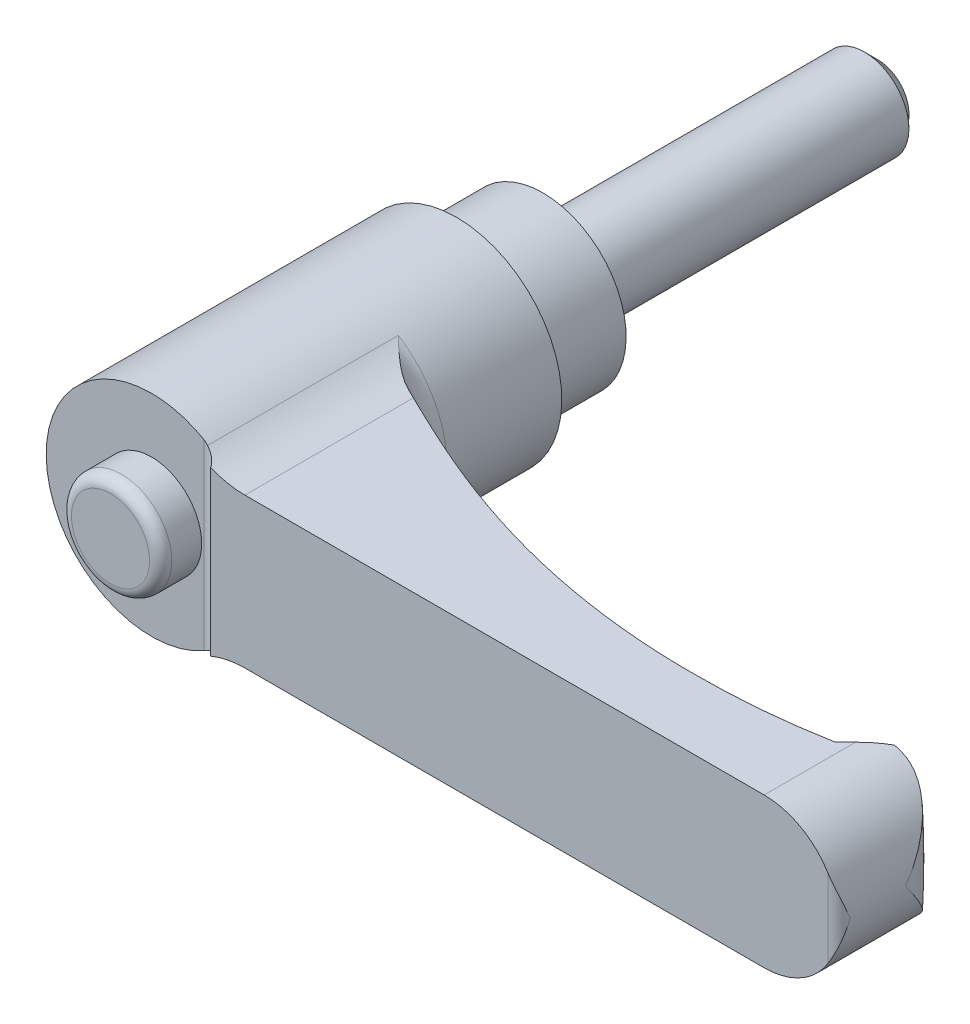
ISO-10303-21;
HEADER;
FILE_DESCRIPTION(('STEP AP214'),'2;1');
FILE_NAME('part.step','',(''),(''),'','','');
FILE_SCHEMA(('AUTOMOTIVE_DESIGN { 1 0 10303 214 1 1 1 1 }'));
ENDSEC;
DATA;
#1=APPLICATION_CONTEXT('core data for automotive mechanical design processes');
#2=APPLICATION_PROTOCOL_DEFINITION('international standard','automotive_design',2000,#1);
#3=PRODUCT_CONTEXT('',#1,'mechanical');
#4=PRODUCT('Part','Part','',(#3));
#5=PRODUCT_RELATED_PRODUCT_CATEGORY('part','',(#4));
#6=PRODUCT_DEFINITION_FORMATION('','',#4);
#7=PRODUCT_DEFINITION_CONTEXT('part definition',#1,'design');
#8=PRODUCT_DEFINITION('design','',#6,#7);
#9=PRODUCT_DEFINITION_SHAPE('','',#8);
#10=(LENGTH_UNIT() NAMED_UNIT(*) SI_UNIT(.MILLI.,.METRE.));
#11=(NAMED_UNIT(*) PLANE_ANGLE_UNIT() SI_UNIT($,.RADIAN.));
#12=(NAMED_UNIT(*) SI_UNIT($,.STERADIAN.) SOLID_ANGLE_UNIT());
#13=UNCERTAINTY_MEASURE_WITH_UNIT(LENGTH_MEASURE(1.E-05),#10,'distance_accuracy_value','');
#14=(GEOMETRIC_REPRESENTATION_CONTEXT(3) GLOBAL_UNCERTAINTY_ASSIGNED_CONTEXT((#13)) GLOBAL_UNIT_ASSIGNED_CONTEXT((#10,
#11,#12)) REPRESENTATION_CONTEXT('',''));
#15=CARTESIAN_POINT('',(0.,0.,0.));
#16=DIRECTION('',(0.,0.,1.));
#17=DIRECTION('',(1.,0.,0.));
#18=AXIS2_PLACEMENT_3D('',#15,#16,#17);
#19=CARTESIAN_POINT('',(6.,0.,0.));
#20=DIRECTION('',(0.,0.,1.));
#21=DIRECTION('',(0.,-1.,0.));
#22=AXIS2_PLACEMENT_3D('',#19,#20,#21);
#23=PLANE('',#22);
#24=CARTESIAN_POINT('',(0.,0.,0.));
#25=DIRECTION('',(0.,0.,-1.));
#26=DIRECTION('',(0.,1.,0.));
#27=AXIS2_PLACEMENT_3D('',#24,#25,#26);
#28=CIRCLE('',#27,4.);
#29=CARTESIAN_POINT('',(0.,4.,0.));
#30=VERTEX_POINT('',#29);
#31=EDGE_CURVE('E423',#30,#30,#28,.T.);
#32=ORIENTED_EDGE('',*,*,#31,.F.);
#33=EDGE_LOOP('',(#32));
#34=FACE_BOUND('',#33,.T.);
#35=CARTESIAN_POINT('',(0.,0.,0.));
#36=DIRECTION('',(0.,0.,-1.));
#37=DIRECTION('',(0.,1.,0.));
#38=AXIS2_PLACEMENT_3D('',#35,#36,#37);
#39=CIRCLE('',#38,6.);
#40=CARTESIAN_POINT('',(0.,6.,0.));
#41=VERTEX_POINT('',#40);
#42=EDGE_CURVE('E347',#41,#41,#39,.T.);
#43=ORIENTED_EDGE('',*,*,#42,.T.);
#44=EDGE_LOOP('',(#43));
#45=FACE_BOUND('',#44,.T.);
#46=ADVANCED_FACE('F14',(#34,#45),#23,.F.);
#47=CARTESIAN_POINT('',(0.,0.,35.5));
#48=DIRECTION('',(0.,0.,-1.));
#49=DIRECTION('',(0.,1.,0.));
#50=AXIS2_PLACEMENT_3D('',#47,#48,#49);
#51=PLANE('',#50);
#52=CARTESIAN_POINT('',(0.,0.,35.5));
#53=DIRECTION('',(0.,0.,-1.));
#54=DIRECTION('',(0.,1.,0.));
#55=AXIS2_PLACEMENT_3D('',#52,#53,#54);
#56=CIRCLE('',#55,9.5);
#57=CARTESIAN_POINT('',(4.75,-8.22724133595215,35.5));
#58=VERTEX_POINT('',#57);
#59=CARTESIAN_POINT('',(4.75,8.22724133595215,35.5));
#60=VERTEX_POINT('',#59);
#61=EDGE_CURVE('E332',#58,#60,#56,.T.);
#62=ORIENTED_EDGE('',*,*,#61,.F.);
#63=DIRECTION('',(0.,1.,0.));
#64=VECTOR('',#63,1.);
#65=CARTESIAN_POINT('',(4.75,-13.5,35.5));
#66=LINE('',#65,#64);
#67=EDGE_CURVE('E383',#58,#60,#66,.T.);
#68=ORIENTED_EDGE('',*,*,#67,.T.);
#69=EDGE_LOOP('',(#62,#68));
#70=FACE_BOUND('',#69,.T.);
#71=CARTESIAN_POINT('',(0.,0.,35.5));
#72=DIRECTION('',(0.,0.,-1.));
#73=DIRECTION('',(0.,1.,0.));
#74=AXIS2_PLACEMENT_3D('',#71,#72,#73);
#75=CIRCLE('',#74,4.52380952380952);
#76=CARTESIAN_POINT('',(0.,4.52380952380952,35.5));
#77=VERTEX_POINT('',#76);
#78=EDGE_CURVE('E183',#77,#77,#75,.F.);
#79=ORIENTED_EDGE('',*,*,#78,.F.);
#80=EDGE_LOOP('',(#79));
#81=FACE_BOUND('',#80,.T.);
#82=ADVANCED_FACE('F158',(#70,#81),#51,.F.);
#83=CARTESIAN_POINT('',(56.25,0.,0.));
#84=DIRECTION('',(0.,0.,1.));
#85=DIRECTION('',(0.,-1.,0.));
#86=AXIS2_PLACEMENT_3D('',#83,#84,#85);
#87=CYLINDRICAL_SURFACE('',#86,6.75);
#88=CARTESIAN_POINT('',(63.,0.,30.5));
#89=CARTESIAN_POINT('',(63.0000000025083,-0.0046874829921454,30.4965903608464));
#90=CARTESIAN_POINT('',(62.9999951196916,-0.0093750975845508,30.4931806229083));
#91=CARTESIAN_POINT('',(62.9990237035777,-0.475524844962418,30.1541065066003));
#92=CARTESIAN_POINT('',(62.9507141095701,-0.938185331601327,29.8175642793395));
#93=CARTESIAN_POINT('',(62.8060463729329,-1.62346497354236,29.3225480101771));
#94=CARTESIAN_POINT('',(62.7456147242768,-1.85084323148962,29.1588881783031));
#95=CARTESIAN_POINT('',(62.6000044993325,-2.30127271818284,28.8365968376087));
#96=CARTESIAN_POINT('',(62.5148384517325,-2.52432607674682,28.6779628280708));
#97=CARTESIAN_POINT('',(62.344804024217,-2.90644000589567,28.4087021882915));
#98=CARTESIAN_POINT('',(62.2657268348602,-3.06692788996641,28.2964051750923));
#99=CARTESIAN_POINT('',(62.0934111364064,-3.38371909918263,28.0768184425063));
#100=CARTESIAN_POINT('',(62.0001726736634,-3.5400224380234,27.9695287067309));
#101=CARTESIAN_POINT('',(61.7993668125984,-3.84715615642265,27.7614384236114));
#102=CARTESIAN_POINT('',(61.6918275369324,-3.99799655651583,27.6606257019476));
#103=CARTESIAN_POINT('',(61.4620426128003,-4.29326696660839,27.4668757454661));
#104=CARTESIAN_POINT('',(61.3398014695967,-4.43769892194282,27.3739361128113));
#105=CARTESIAN_POINT('',(61.0188552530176,-4.78536684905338,27.1560724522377));
#106=CARTESIAN_POINT('',(60.8112818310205,-4.9842025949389,27.0367418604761));
#107=CARTESIAN_POINT('',(60.4758984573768,-5.26551240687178,26.8795376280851));
#108=CARTESIAN_POINT('',(60.3601030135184,-5.35645651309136,26.8307690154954));
#109=CARTESIAN_POINT('',(60.1206554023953,-5.53195453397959,26.7416778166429));
#110=CARTESIAN_POINT('',(59.997005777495,-5.61651049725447,26.7013525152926));
#111=CARTESIAN_POINT('',(59.7699445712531,-5.76076929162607,26.6381973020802));
#112=CARTESIAN_POINT('',(59.667954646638,-5.82188686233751,26.6134697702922));
#113=CARTESIAN_POINT('',(59.4598154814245,-5.93917869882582,26.5707512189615));
#114=CARTESIAN_POINT('',(59.3536672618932,-5.99535416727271,26.5527585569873));
#115=CARTESIAN_POINT('',(59.1377410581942,-6.10229132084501,26.5242546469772));
#116=CARTESIAN_POINT('',(59.0279645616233,-6.15305518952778,26.5137403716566));
#117=CARTESIAN_POINT('',(58.8054681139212,-6.24873887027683,26.5009304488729));
#118=CARTESIAN_POINT('',(58.6927495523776,-6.29366138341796,26.4986309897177));
#119=CARTESIAN_POINT('',(58.4641163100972,-6.37770798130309,26.502966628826));
#120=CARTESIAN_POINT('',(58.3481815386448,-6.41677354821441,26.5096859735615));
#121=CARTESIAN_POINT('',(58.1152313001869,-6.48831686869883,26.5328398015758));
#122=CARTESIAN_POINT('',(57.9982157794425,-6.52079429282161,26.5492747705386));
#123=CARTESIAN_POINT('',(57.7644328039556,-6.57901960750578,26.5923251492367));
#124=CARTESIAN_POINT('',(57.6476652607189,-6.60477054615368,26.618935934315));
#125=CARTESIAN_POINT('',(57.41573023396,-6.64962508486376,26.6826067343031));
#126=CARTESIAN_POINT('',(57.3005622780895,-6.66873068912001,26.7196635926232));
#127=CARTESIAN_POINT('',(57.104290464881,-6.69624244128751,26.7926929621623));
#128=CARTESIAN_POINT('',(57.0224673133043,-6.70614558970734,26.8262017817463));
#129=CARTESIAN_POINT('',(56.8609556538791,-6.72278366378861,26.8986767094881));
#130=CARTESIAN_POINT('',(56.781266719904,-6.72951922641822,26.9376417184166));
#131=CARTESIAN_POINT('',(56.624433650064,-6.74006528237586,27.0209540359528));
#132=CARTESIAN_POINT('',(56.5472927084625,-6.74387222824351,27.0653077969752));
#133=CARTESIAN_POINT('',(56.3961054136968,-6.74884425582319,27.1591719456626));
#134=CARTESIAN_POINT('',(56.3220596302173,-6.75000885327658,27.2086832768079));
#135=CARTESIAN_POINT('',(56.2498,-6.74999999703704,27.2606710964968));
#136=B_SPLINE_CURVE_WITH_KNOTS('',3,(#88,#89,#90,#91,#92,#93,#94,#95,#96,#97,#98,#99,#100,#101,
#102,#103,#104,#105,#106,#107,#108,#109,#110,#111,#112,#113,#114,#115,#116,#117,#118,#119,#120,
#121,#122,#123,#124,#125,#126,#127,#128,#129,#130,#131,#132,#133,#134,#135),.UNSPECIFIED.,.F.,
.F.,(4,2,2,2,2,2,2,2,2,2,2,2,2,2,2,2,2,2,2,2,2,2,2,4),(0.,0.0173896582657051,1.7292315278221,
2.5882674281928,3.44686895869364,4.08007105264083,4.71327107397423,5.34524382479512,
5.97702340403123,6.9068284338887,7.37170994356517,7.83644173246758,8.20045511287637,
8.56437966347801,8.92815681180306,9.29176514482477,9.65879376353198,10.0258407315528,
10.3927210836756,10.7594906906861,11.0261722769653,11.2928002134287,11.5597506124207,
11.8267499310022),.UNSPECIFIED.);
#137=CARTESIAN_POINT('',(58.6622222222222,-6.30425919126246,26.5));
#138=VERTEX_POINT('',#137);
#139=CARTESIAN_POINT('',(63.,0.,30.5));
#140=VERTEX_POINT('',#139);
#141=EDGE_CURVE('E126',#138,#140,#136,.F.);
#142=ORIENTED_EDGE('',*,*,#141,.T.);
#143=CARTESIAN_POINT('',(63.,0.,30.5));
#144=CARTESIAN_POINT('',(63.0000000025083,0.00468748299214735,30.4965903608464));
#145=CARTESIAN_POINT('',(62.9999951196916,0.00937509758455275,30.4931806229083));
#146=CARTESIAN_POINT('',(62.9990237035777,0.47552484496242,30.1541065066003));
#147=CARTESIAN_POINT('',(62.9507141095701,0.938185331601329,29.8175642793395));
#148=CARTESIAN_POINT('',(62.8060463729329,1.62346497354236,29.3225480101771));
#149=CARTESIAN_POINT('',(62.7456147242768,1.85084323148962,29.1588881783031));
#150=CARTESIAN_POINT('',(62.6000044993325,2.30127271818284,28.8365968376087));
#151=CARTESIAN_POINT('',(62.5148384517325,2.52432607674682,28.6779628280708));
#152=CARTESIAN_POINT('',(62.344804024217,2.90644000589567,28.4087021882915));
#153=CARTESIAN_POINT('',(62.2657268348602,3.06692788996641,28.2964051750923));
#154=CARTESIAN_POINT('',(62.0934111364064,3.38371909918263,28.0768184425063));
#155=CARTESIAN_POINT('',(62.0001726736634,3.5400224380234,27.9695287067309));
#156=CARTESIAN_POINT('',(61.7993668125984,3.84715615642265,27.7614384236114));
#157=CARTESIAN_POINT('',(61.6918275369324,3.99799655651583,27.6606257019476));
#158=CARTESIAN_POINT('',(61.4620426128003,4.29326696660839,27.4668757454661));
#159=CARTESIAN_POINT('',(61.3398014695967,4.43769892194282,27.3739361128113));
#160=CARTESIAN_POINT('',(61.0188552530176,4.78536684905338,27.1560724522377));
#161=CARTESIAN_POINT('',(60.8112818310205,4.9842025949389,27.0367418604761));
#162=CARTESIAN_POINT('',(60.4758984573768,5.26551240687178,26.8795376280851));
#163=CARTESIAN_POINT('',(60.3601030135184,5.35645651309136,26.8307690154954));
#164=CARTESIAN_POINT('',(60.1206554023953,5.53195453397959,26.7416778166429));
#165=CARTESIAN_POINT('',(59.997005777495,5.61651049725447,26.7013525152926));
#166=CARTESIAN_POINT('',(59.7699445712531,5.76076929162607,26.6381973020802));
#167=CARTESIAN_POINT('',(59.667954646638,5.82188686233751,26.6134697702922));
#168=CARTESIAN_POINT('',(59.4598154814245,5.93917869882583,26.5707512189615));
#169=CARTESIAN_POINT('',(59.3536672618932,5.99535416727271,26.5527585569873));
#170=CARTESIAN_POINT('',(59.1377410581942,6.10229132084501,26.5242546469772));
#171=CARTESIAN_POINT('',(59.0279645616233,6.15305518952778,26.5137403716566));
#172=CARTESIAN_POINT('',(58.8054681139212,6.24873887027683,26.5009304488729));
#173=CARTESIAN_POINT('',(58.6927495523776,6.29366138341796,26.4986309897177));
#174=CARTESIAN_POINT('',(58.4641163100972,6.37770798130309,26.502966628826));
#175=CARTESIAN_POINT('',(58.3481815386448,6.41677354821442,26.5096859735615));
#176=CARTESIAN_POINT('',(58.1152313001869,6.48831686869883,26.5328398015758));
#177=CARTESIAN_POINT('',(57.9982157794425,6.52079429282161,26.5492747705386));
#178=CARTESIAN_POINT('',(57.7644328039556,6.57901960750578,26.5923251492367));
#179=CARTESIAN_POINT('',(57.6476652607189,6.60477054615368,26.618935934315));
#180=CARTESIAN_POINT('',(57.41573023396,6.64962508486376,26.6826067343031));
#181=CARTESIAN_POINT('',(57.3005622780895,6.66873068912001,26.7196635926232));
#182=CARTESIAN_POINT('',(57.1042904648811,6.69624244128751,26.7926929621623));
#183=CARTESIAN_POINT('',(57.0224673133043,6.70614558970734,26.8262017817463));
#184=CARTESIAN_POINT('',(56.8609556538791,6.72278366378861,26.8986767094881));
#185=CARTESIAN_POINT('',(56.781266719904,6.72951922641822,26.9376417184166));
#186=CARTESIAN_POINT('',(56.624433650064,6.74006528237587,27.0209540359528));
#187=CARTESIAN_POINT('',(56.5472927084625,6.74387222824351,27.0653077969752));
#188=CARTESIAN_POINT('',(56.3961054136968,6.74884425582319,27.1591719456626));
#189=CARTESIAN_POINT('',(56.3220596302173,6.75000885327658,27.2086832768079));
#190=CARTESIAN_POINT('',(56.2498,6.74999999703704,27.2606710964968));
#191=B_SPLINE_CURVE_WITH_KNOTS('',3,(#143,#144,#145,#146,#147,#148,#149,#150,#151,#152,#153,
#154,#155,#156,#157,#158,#159,#160,#161,#162,#163,#164,#165,#166,#167,#168,#169,#170,#171,#172,
#173,#174,#175,#176,#177,#178,#179,#180,#181,#182,#183,#184,#185,#186,#187,#188,#189,#190),
.UNSPECIFIED.,.F.,.F.,(4,2,2,2,2,2,2,2,2,2,2,2,2,2,2,2,2,2,2,2,2,2,2,4),(0.,0.0173896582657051,
1.7292315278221,2.5882674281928,3.44686895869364,4.08007105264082,4.71327107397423,
5.34524382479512,5.97702340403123,6.9068284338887,7.37170994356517,7.83644173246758,
8.20045511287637,8.56437966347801,8.92815681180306,9.29176514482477,9.65879376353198,
10.0258407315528,10.3927210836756,10.7594906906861,11.0261722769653,11.2928002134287,
11.5597506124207,11.8267499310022),.UNSPECIFIED.);
#192=CARTESIAN_POINT('',(58.6622222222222,6.30425919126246,26.5));
#193=VERTEX_POINT('',#192);
#194=EDGE_CURVE('E123',#140,#193,#191,.T.);
#195=ORIENTED_EDGE('',*,*,#194,.T.);
#196=CARTESIAN_POINT('',(56.25,0.,26.5));
#197=DIRECTION('',(0.,0.,-1.));
#198=DIRECTION('',(0.,1.,0.));
#199=AXIS2_PLACEMENT_3D('',#196,#197,#198);
#200=CIRCLE('',#199,6.75);
#201=CARTESIAN_POINT('',(58.,6.51920240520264,26.5));
#202=VERTEX_POINT('',#201);
#203=EDGE_CURVE('E308',#193,#202,#200,.F.);
#204=ORIENTED_EDGE('',*,*,#203,.T.);
#205=CARTESIAN_POINT('',(56.25,0.,28.25));
#206=DIRECTION('',(-0.707106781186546,0.,-0.70710678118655));
#207=DIRECTION('',(-0.70710678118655,0.,0.707106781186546));
#208=AXIS2_PLACEMENT_3D('',#205,#206,#207);
#209=ELLIPSE('',#208,9.54594154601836,6.75);
#210=CARTESIAN_POINT('',(56.25,6.75,28.25));
#211=VERTEX_POINT('',#210);
#212=EDGE_CURVE('E374',#202,#211,#209,.F.);
#213=ORIENTED_EDGE('',*,*,#212,.T.);
#214=DIRECTION('',(0.,0.,1.));
#215=VECTOR('',#214,1.);
#216=CARTESIAN_POINT('',(56.25,6.75,0.));
#217=LINE('',#216,#215);
#218=CARTESIAN_POINT('',(56.25,6.75,36.5));
#219=VERTEX_POINT('',#218);
#220=EDGE_CURVE('E330',#211,#219,#217,.T.);
#221=ORIENTED_EDGE('',*,*,#220,.T.);
#222=CARTESIAN_POINT('',(56.25,0.,36.5));
#223=DIRECTION('',(0.,0.,1.));
#224=DIRECTION('',(0.,-1.,0.));
#225=AXIS2_PLACEMENT_3D('',#222,#223,#224);
#226=CIRCLE('',#225,6.75);
#227=CARTESIAN_POINT('',(62.,3.53553390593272,36.5));
#228=VERTEX_POINT('',#227);
#229=EDGE_CURVE('E322',#228,#219,#226,.T.);
#230=ORIENTED_EDGE('',*,*,#229,.F.);
#231=CARTESIAN_POINT('',(62.,3.53553390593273,36.5));
#232=CARTESIAN_POINT('',(62.0299932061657,3.48675666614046,36.4999933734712));
#233=CARTESIAN_POINT('',(62.0593538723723,3.43761273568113,36.4986515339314));
#234=CARTESIAN_POINT('',(62.1167538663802,3.33870692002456,36.4935798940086));
#235=CARTESIAN_POINT('',(62.1447937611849,3.28894531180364,36.489851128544));
#236=CARTESIAN_POINT('',(62.2267562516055,3.13908056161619,36.4755285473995));
#237=CARTESIAN_POINT('',(62.2786643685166,3.03816514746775,36.4617957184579));
#238=CARTESIAN_POINT('',(62.3766467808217,2.83536966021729,36.4277987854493));
#239=CARTESIAN_POINT('',(62.4227515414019,2.73349792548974,36.4075709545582));
#240=CARTESIAN_POINT('',(62.509502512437,2.52854152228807,36.3618646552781));
#241=CARTESIAN_POINT('',(62.550144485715,2.42545597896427,36.3363821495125));
#242=CARTESIAN_POINT('',(62.6493297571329,2.15471359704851,36.2642737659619));
#243=CARTESIAN_POINT('',(62.7035065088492,1.98634279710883,36.2142841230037));
#244=CARTESIAN_POINT('',(62.7980553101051,1.64812969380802,36.1068184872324));
#245=CARTESIAN_POINT('',(62.8384218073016,1.4782868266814,36.0493394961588));
#246=CARTESIAN_POINT('',(62.9057483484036,1.1374266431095,35.9293690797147));
#247=CARTESIAN_POINT('',(62.9326868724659,0.966407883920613,35.8668697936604));
#248=CARTESIAN_POINT('',(62.9733111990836,0.623942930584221,35.7390768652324));
#249=CARTESIAN_POINT('',(62.9870036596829,0.452496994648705,35.6737846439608));
#250=CARTESIAN_POINT('',(62.997837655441,0.192449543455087,35.5740662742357));
#251=CARTESIAN_POINT('',(62.999781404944,0.103891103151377,35.539987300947));
#252=CARTESIAN_POINT('',(62.9999941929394,0.0102233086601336,35.5039349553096));
#253=CARTESIAN_POINT('',(62.9999999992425,0.00511164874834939,35.5019674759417));
#254=CARTESIAN_POINT('',(63.,0.,35.5));
#255=B_SPLINE_CURVE_WITH_KNOTS('',3,(#231,#232,#233,#234,#235,#236,#237,#238,#239,#240,#241,
#242,#243,#244,#245,#246,#247,#248,#249,#250,#251,#252,#253,#254),.UNSPECIFIED.,.F.,.F.,(4,2,2,
2,2,2,2,2,2,2,2,4),(0.,0.171732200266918,0.343389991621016,0.685890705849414,1.02651095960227,
1.36739390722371,1.91796289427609,2.46875297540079,3.02042294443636,3.57181547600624,
3.85648313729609,3.87291482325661),.UNSPECIFIED.);
#256=CARTESIAN_POINT('',(63.,0.,35.5));
#257=VERTEX_POINT('',#256);
#258=EDGE_CURVE('E169',#257,#228,#255,.F.);
#259=ORIENTED_EDGE('',*,*,#258,.F.);
#260=CARTESIAN_POINT('',(62.,-3.53553390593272,36.5));
#261=CARTESIAN_POINT('',(62.0299932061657,-3.48675666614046,36.4999933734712));
#262=CARTESIAN_POINT('',(62.0593538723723,-3.43761273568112,36.4986515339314));
#263=CARTESIAN_POINT('',(62.1167538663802,-3.33870692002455,36.4935798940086));
#264=CARTESIAN_POINT('',(62.1447937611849,-3.28894531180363,36.489851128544));
#265=CARTESIAN_POINT('',(62.2267562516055,-3.13908056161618,36.4755285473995));
#266=CARTESIAN_POINT('',(62.2786643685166,-3.03816514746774,36.4617957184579));
#267=CARTESIAN_POINT('',(62.3766467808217,-2.83536966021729,36.4277987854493));
#268=CARTESIAN_POINT('',(62.4227515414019,-2.73349792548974,36.4075709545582));
#269=CARTESIAN_POINT('',(62.509502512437,-2.52854152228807,36.3618646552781));
#270=CARTESIAN_POINT('',(62.550144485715,-2.42545597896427,36.3363821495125));
#271=CARTESIAN_POINT('',(62.6493297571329,-2.15471359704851,36.2642737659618));
#272=CARTESIAN_POINT('',(62.7035065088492,-1.98634279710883,36.2142841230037));
#273=CARTESIAN_POINT('',(62.7980553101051,-1.64812969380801,36.1068184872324));
#274=CARTESIAN_POINT('',(62.8384218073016,-1.4782868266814,36.0493394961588));
#275=CARTESIAN_POINT('',(62.9057483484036,-1.1374266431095,35.9293690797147));
#276=CARTESIAN_POINT('',(62.9326868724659,-0.966407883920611,35.8668697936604));
#277=CARTESIAN_POINT('',(62.9733111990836,-0.623942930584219,35.7390768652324));
#278=CARTESIAN_POINT('',(62.9870036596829,-0.452496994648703,35.6737846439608));
#279=CARTESIAN_POINT('',(62.997837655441,-0.192449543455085,35.5740662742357));
#280=CARTESIAN_POINT('',(62.999781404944,-0.103891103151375,35.539987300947));
#281=CARTESIAN_POINT('',(62.9999941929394,-0.0102233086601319,35.5039349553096));
#282=CARTESIAN_POINT('',(62.9999999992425,-0.00511164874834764,35.5019674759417));
#283=CARTESIAN_POINT('',(63.,0.,35.5));
#284=B_SPLINE_CURVE_WITH_KNOTS('',3,(#260,#261,#262,#263,#264,#265,#266,#267,#268,#269,#270,
#271,#272,#273,#274,#275,#276,#277,#278,#279,#280,#281,#282,#283),.UNSPECIFIED.,.F.,.F.,(4,2,2,
2,2,2,2,2,2,2,2,4),(0.,0.171732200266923,0.34338999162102,0.685890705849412,1.02651095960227,
1.36739390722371,1.91796289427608,2.46875297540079,3.02042294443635,3.57181547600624,
3.85648313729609,3.8729148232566),.UNSPECIFIED.);
#285=CARTESIAN_POINT('',(62.,-3.53553390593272,36.5));
#286=VERTEX_POINT('',#285);
#287=EDGE_CURVE('E177',#286,#257,#284,.T.);
#288=ORIENTED_EDGE('',*,*,#287,.F.);
#289=CARTESIAN_POINT('',(56.25,-6.75,36.5));
#290=VERTEX_POINT('',#289);
#291=EDGE_CURVE('E310',#290,#286,#226,.T.);
#292=ORIENTED_EDGE('',*,*,#291,.F.);
#293=DIRECTION('',(0.,0.,1.));
#294=VECTOR('',#293,1.);
#295=CARTESIAN_POINT('',(56.25,-6.75,0.));
#296=LINE('',#295,#294);
#297=CARTESIAN_POINT('',(56.25,-6.75,28.25));
#298=VERTEX_POINT('',#297);
#299=EDGE_CURVE('E355',#298,#290,#296,.T.);
#300=ORIENTED_EDGE('',*,*,#299,.F.);
#301=CARTESIAN_POINT('',(58.,-6.51920240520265,26.5));
#302=VERTEX_POINT('',#301);
#303=EDGE_CURVE('E375',#298,#302,#209,.F.);
#304=ORIENTED_EDGE('',*,*,#303,.T.);
#305=EDGE_CURVE('E134',#302,#138,#200,.F.);
#306=ORIENTED_EDGE('',*,*,#305,.T.);
#307=EDGE_LOOP('',(#142,#195,#204,#213,#221,#230,#259,#288,#292,#300,#304,#306));
#308=FACE_BOUND('',#307,.T.);
#309=ADVANCED_FACE('F132',(#308),#87,.T.);
#310=CARTESIAN_POINT('',(59.,-13.5,26.5));
#311=DIRECTION('',(0.,0.,-1.));
#312=DIRECTION('',(0.,1.,0.));
#313=AXIS2_PLACEMENT_3D('',#310,#311,#312);
#314=PLANE('',#313);
#315=ORIENTED_EDGE('',*,*,#203,.F.);
#316=CARTESIAN_POINT('',(0.,0.,26.5));
#317=DIRECTION('',(0.,0.,-1.));
#318=DIRECTION('',(0.,1.,0.));
#319=AXIS2_PLACEMENT_3D('',#316,#317,#318);
#320=CIRCLE('',#319,59.);
#321=EDGE_CURVE('E37',#193,#138,#320,.T.);
#322=ORIENTED_EDGE('',*,*,#321,.T.);
#323=ORIENTED_EDGE('',*,*,#305,.F.);
#324=DIRECTION('',(0.,1.,0.));
#325=VECTOR('',#324,1.);
#326=CARTESIAN_POINT('',(58.,-13.5,26.5));
#327=LINE('',#326,#325);
#328=EDGE_CURVE('E327',#302,#202,#327,.T.);
#329=ORIENTED_EDGE('',*,*,#328,.T.);
#330=EDGE_LOOP('',(#315,#322,#323,#329));
#331=FACE_BOUND('',#330,.T.);
#332=ADVANCED_FACE('F157',(#331),#314,.T.);
#333=CARTESIAN_POINT('',(0.,0.,36.5));
#334=DIRECTION('',(0.,0.,1.));
#335=DIRECTION('',(0.,-1.,0.));
#336=AXIS2_PLACEMENT_3D('',#333,#334,#335);
#337=PLANE('',#336);
#338=CARTESIAN_POINT('',(9.41740410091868,14.75,36.5));
#339=DIRECTION('',(0.,0.,1.));
#340=DIRECTION('',(1.,0.,0.));
#341=AXIS2_PLACEMENT_3D('',#338,#339,#340);
#342=CIRCLE('',#341,8.);
#343=CARTESIAN_POINT('',(6.33333333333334,7.36836688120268,36.5));
#344=VERTEX_POINT('',#343);
#345=CARTESIAN_POINT('',(9.41740410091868,6.75,36.5));
#346=VERTEX_POINT('',#345);
#347=EDGE_CURVE('E369',#344,#346,#342,.T.);
#348=ORIENTED_EDGE('',*,*,#347,.F.);
#349=DIRECTION('',(0.,1.,0.));
#350=VECTOR('',#349,1.);
#351=CARTESIAN_POINT('',(6.33333333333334,-13.5,36.5));
#352=LINE('',#351,#350);
#353=CARTESIAN_POINT('',(6.33333333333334,-7.36836688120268,36.5));
#354=VERTEX_POINT('',#353);
#355=EDGE_CURVE('E326',#354,#344,#352,.T.);
#356=ORIENTED_EDGE('',*,*,#355,.F.);
#357=CARTESIAN_POINT('',(9.41740410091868,-14.75,36.5));
#358=DIRECTION('',(0.,0.,1.));
#359=DIRECTION('',(1.,0.,0.));
#360=AXIS2_PLACEMENT_3D('',#357,#358,#359);
#361=CIRCLE('',#360,8.);
#362=CARTESIAN_POINT('',(9.41740410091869,-6.75,36.5));
#363=VERTEX_POINT('',#362);
#364=EDGE_CURVE('E361',#363,#354,#361,.T.);
#365=ORIENTED_EDGE('',*,*,#364,.F.);
#366=DIRECTION('',(-1.,0.,0.));
#367=VECTOR('',#366,1.);
#368=CARTESIAN_POINT('',(56.25,-6.75,36.5));
#369=LINE('',#368,#367);
#370=EDGE_CURVE('E364',#290,#363,#369,.T.);
#371=ORIENTED_EDGE('',*,*,#370,.F.);
#372=ORIENTED_EDGE('',*,*,#291,.T.);
#373=DIRECTION('',(0.,1.,0.));
#374=VECTOR('',#373,1.);
#375=CARTESIAN_POINT('',(62.,-13.5,36.5));
#376=LINE('',#375,#374);
#377=EDGE_CURVE('E315',#286,#228,#376,.T.);
#378=ORIENTED_EDGE('',*,*,#377,.T.);
#379=ORIENTED_EDGE('',*,*,#229,.T.);
#380=DIRECTION('',(1.,0.,0.));
#381=VECTOR('',#380,1.);
#382=CARTESIAN_POINT('',(9.41740410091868,6.75,36.5));
#383=LINE('',#382,#381);
#384=EDGE_CURVE('E367',#346,#219,#383,.T.);
#385=ORIENTED_EDGE('',*,*,#384,.F.);
#386=EDGE_LOOP('',(#348,#356,#365,#371,#372,#378,#379,#385));
#387=FACE_BOUND('',#386,.T.);
#388=ADVANCED_FACE('F240',(#387),#337,.T.);
#389=CARTESIAN_POINT('',(0.,0.,0.));
#390=DIRECTION('',(0.,0.,-1.));
#391=DIRECTION('',(0.,1.,0.));
#392=AXIS2_PLACEMENT_3D('',#389,#390,#391);
#393=CYLINDRICAL_SURFACE('',#392,9.5);
#394=CARTESIAN_POINT('',(0.,0.,18.3481601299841));
#395=DIRECTION('',(0.,0.,-1.));
#396=DIRECTION('',(0.,1.,0.));
#397=AXIS2_PLACEMENT_3D('',#394,#395,#396);
#398=CIRCLE('',#397,9.5);
#399=CARTESIAN_POINT('',(5.11230508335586,8.00714285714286,18.3481601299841));
#400=VERTEX_POINT('',#399);
#401=CARTESIAN_POINT('',(5.11230508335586,-8.00714285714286,18.3481601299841));
#402=VERTEX_POINT('',#401);
#403=EDGE_CURVE('E413',#400,#402,#398,.T.);
#404=ORIENTED_EDGE('',*,*,#403,.T.);
#405=DIRECTION('',(0.,0.,1.));
#406=VECTOR('',#405,1.);
#407=CARTESIAN_POINT('',(5.11230508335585,-8.00714285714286,0.));
#408=LINE('',#407,#406);
#409=CARTESIAN_POINT('',(5.11230508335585,-8.00714285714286,35.5614827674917));
#410=VERTEX_POINT('',#409);
#411=EDGE_CURVE('E359',#402,#410,#408,.T.);
#412=ORIENTED_EDGE('',*,*,#411,.T.);
#413=CARTESIAN_POINT('',(4.75,-8.22724133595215,35.5));
#414=CARTESIAN_POINT('',(4.82354897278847,-8.18479174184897,35.5056127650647));
#415=CARTESIAN_POINT('',(4.89626028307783,-8.1414834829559,35.5152432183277));
#416=CARTESIAN_POINT('',(5.03945202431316,-8.05362753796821,35.5421901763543));
#417=CARTESIAN_POINT('',(5.10993308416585,-8.00908020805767,35.5595044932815));
#418=CARTESIAN_POINT('',(5.24861636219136,-7.91889687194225,35.6016146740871));
#419=CARTESIAN_POINT('',(5.31680005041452,-7.87325555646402,35.6264601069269));
#420=CARTESIAN_POINT('',(5.44990684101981,-7.7817124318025,35.6832973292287));
#421=CARTESIAN_POINT('',(5.51483003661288,-7.7358106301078,35.7152889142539));
#422=CARTESIAN_POINT('',(5.69141984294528,-7.6077148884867,35.8145402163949));
#423=CARTESIAN_POINT('',(5.79903338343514,-7.52579740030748,35.8895684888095));
#424=CARTESIAN_POINT('',(5.99917718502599,-7.36722875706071,36.0610902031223));
#425=CARTESIAN_POINT('',(6.09178179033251,-7.29055280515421,36.157471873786));
#426=CARTESIAN_POINT('',(6.20382113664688,-7.19472379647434,36.3011658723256));
#427=CARTESIAN_POINT('',(6.23139044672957,-7.17084441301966,36.33916914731));
#428=CARTESIAN_POINT('',(6.28417716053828,-7.12462925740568,36.4176957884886));
#429=CARTESIAN_POINT('',(6.30939340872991,-7.1022942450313,36.4582203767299));
#430=CARTESIAN_POINT('',(6.33333333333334,-7.08088192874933,36.5));
#431=B_SPLINE_CURVE_WITH_KNOTS('',3,(#413,#414,#415,#416,#417,#418,#419,#420,#421,#422,#423,
#424,#425,#426,#427,#428,#429,#430),.UNSPECIFIED.,.F.,.F.,(4,2,2,2,2,2,2,2,4),(0.,
0.25516766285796,0.510262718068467,0.767074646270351,1.02387922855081,1.48566336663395,
1.94508518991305,2.10299549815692,2.26098294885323),.UNSPECIFIED.);
#432=EDGE_CURVE('E214',#58,#410,#431,.T.);
#433=ORIENTED_EDGE('',*,*,#432,.F.);
#434=ORIENTED_EDGE('',*,*,#61,.T.);
#435=CARTESIAN_POINT('',(6.33333333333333,7.08088192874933,36.5));
#436=CARTESIAN_POINT('',(6.30193651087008,7.10896982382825,36.4452145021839));
#437=CARTESIAN_POINT('',(6.26833956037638,7.13863883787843,36.3925689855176));
#438=CARTESIAN_POINT('',(6.19723055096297,7.20045324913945,36.2916619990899));
#439=CARTESIAN_POINT('',(6.15972345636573,7.23259549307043,36.243395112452));
#440=CARTESIAN_POINT('',(6.08131079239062,7.2986494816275,36.1513438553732));
#441=CARTESIAN_POINT('',(6.04041526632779,7.33255589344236,36.1075470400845));
#442=CARTESIAN_POINT('',(5.95546899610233,7.40171574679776,36.0242830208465));
#443=CARTESIAN_POINT('',(5.91141716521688,7.4369696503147,35.9848173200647));
#444=CARTESIAN_POINT('',(5.7754647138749,7.54368484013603,35.8733623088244));
#445=CARTESIAN_POINT('',(5.67929205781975,7.61650473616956,35.8077657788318));
#446=CARTESIAN_POINT('',(5.47750803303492,7.76289095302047,35.6942705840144));
#447=CARTESIAN_POINT('',(5.37189158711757,7.83645765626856,35.6463815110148));
#448=CARTESIAN_POINT('',(5.1806466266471,7.96370194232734,35.5790108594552));
#449=CARTESIAN_POINT('',(5.09668204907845,8.01772299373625,35.5554125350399));
#450=CARTESIAN_POINT('',(4.92555498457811,8.12398585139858,35.5192948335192));
#451=CARTESIAN_POINT('',(4.83839896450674,8.17623088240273,35.5067542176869));
#452=CARTESIAN_POINT('',(4.75,8.22724133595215,35.5));
#453=B_SPLINE_CURVE_WITH_KNOTS('',3,(#435,#436,#437,#438,#439,#440,#441,#442,#443,#444,#445,
#446,#447,#448,#449,#450,#451,#452),.UNSPECIFIED.,.F.,.F.,(4,2,2,2,2,2,2,2,4),(0.,
0.207163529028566,0.414067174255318,0.620378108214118,0.826760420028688,1.23705708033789,
1.64757566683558,1.9547198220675,2.26127274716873),.UNSPECIFIED.);
#454=CARTESIAN_POINT('',(5.11230508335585,8.00714285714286,35.5614827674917));
#455=VERTEX_POINT('',#454);
#456=EDGE_CURVE('E228',#455,#60,#453,.T.);
#457=ORIENTED_EDGE('',*,*,#456,.F.);
#458=DIRECTION('',(0.,0.,1.));
#459=VECTOR('',#458,1.);
#460=CARTESIAN_POINT('',(5.11230508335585,8.00714285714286,0.));
#461=LINE('',#460,#459);
#462=EDGE_CURVE('E350',#400,#455,#461,.T.);
#463=ORIENTED_EDGE('',*,*,#462,.F.);
#464=EDGE_LOOP('',(#404,#412,#433,#434,#457,#463));
#465=FACE_BOUND('',#464,.T.);
#466=CARTESIAN_POINT('',(0.,0.,8.));
#467=DIRECTION('',(0.,0.,-1.));
#468=DIRECTION('',(0.,1.,0.));
#469=AXIS2_PLACEMENT_3D('',#466,#467,#468);
#470=CIRCLE('',#469,9.5);
#471=CARTESIAN_POINT('',(0.,9.5,8.));
#472=VERTEX_POINT('',#471);
#473=EDGE_CURVE('E333',#472,#472,#470,.T.);
#474=ORIENTED_EDGE('',*,*,#473,.F.);
#475=EDGE_LOOP('',(#474));
#476=FACE_BOUND('',#475,.T.);
#477=ADVANCED_FACE('F238',(#465,#476),#393,.T.);
#478=CARTESIAN_POINT('',(9.41740410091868,14.75,0.));
#479=DIRECTION('',(0.,0.,1.));
#480=DIRECTION('',(0.,-1.,0.));
#481=AXIS2_PLACEMENT_3D('',#478,#479,#480);
#482=CYLINDRICAL_SURFACE('',#481,8.);
#483=DIRECTION('',(0.,0.,1.));
#484=VECTOR('',#483,1.);
#485=CARTESIAN_POINT('',(9.41740410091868,6.75,0.));
#486=LINE('',#485,#484);
#487=CARTESIAN_POINT('',(9.41740410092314,6.75,21.3021638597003));
#488=VERTEX_POINT('',#487);
#489=EDGE_CURVE('E352',#488,#346,#486,.T.);
#490=ORIENTED_EDGE('',*,*,#489,.F.);
#491=CARTESIAN_POINT('',(9.41760410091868,6.7500000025,21.3022609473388));
#492=CARTESIAN_POINT('',(9.34663199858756,6.74999859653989,21.2678090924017));
#493=CARTESIAN_POINT('',(9.27552780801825,6.75094090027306,21.2336266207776));
#494=CARTESIAN_POINT('',(9.13312349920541,6.75473540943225,21.1659081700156));
#495=CARTESIAN_POINT('',(9.06182355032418,6.75758629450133,21.1323717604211));
#496=CARTESIAN_POINT('',(8.91899698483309,6.7652204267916,21.066004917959));
#497=CARTESIAN_POINT('',(8.84747036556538,6.77000369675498,21.0331744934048));
#498=CARTESIAN_POINT('',(8.704162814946,6.78153362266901,20.9682923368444));
#499=CARTESIAN_POINT('',(8.63238174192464,6.78828163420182,20.9362411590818));
#500=CARTESIAN_POINT('',(8.56050869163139,6.79602424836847,20.9046385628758));
#501=B_SPLINE_CURVE_WITH_KNOTS('',3,(#491,#492,#493,#494,#495,#496,#497,#498,#499,#500),
.UNSPECIFIED.,.F.,.F.,(4,2,2,2,4),(0.,0.236671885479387,0.473180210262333,0.709691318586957,
0.946365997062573),.UNSPECIFIED.);
#502=CARTESIAN_POINT('',(8.56096354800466,6.79597525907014,20.9048385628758));
#503=VERTEX_POINT('',#502);
#504=EDGE_CURVE('E246',#488,#503,#501,.T.);
#505=ORIENTED_EDGE('',*,*,#504,.T.);
#506=CARTESIAN_POINT('',(8.56141843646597,6.79592629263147,20.9050385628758));
#507=CARTESIAN_POINT('',(8.47420918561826,6.80531273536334,20.8666951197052));
#508=CARTESIAN_POINT('',(8.38798367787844,6.81604134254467,20.8265142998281));
#509=CARTESIAN_POINT('',(8.21753113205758,6.84002445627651,20.7428900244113));
#510=CARTESIAN_POINT('',(8.13330325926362,6.85327788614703,20.6994479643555));
#511=CARTESIAN_POINT('',(7.88393651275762,6.89653514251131,20.5650030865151));
#512=CARTESIAN_POINT('',(7.72171249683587,6.9300806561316,20.4697011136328));
#513=CARTESIAN_POINT('',(7.40583761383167,7.00533652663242,20.2709379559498));
#514=CARTESIAN_POINT('',(7.25214096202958,7.0469964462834,20.1675294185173));
#515=CARTESIAN_POINT('',(6.95163567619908,7.13786246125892,19.9540740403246));
#516=CARTESIAN_POINT('',(6.80483124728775,7.18707308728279,19.8440232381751));
#517=CARTESIAN_POINT('',(6.52235248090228,7.29074005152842,19.6227797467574));
#518=CARTESIAN_POINT('',(6.38647079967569,7.34497015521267,19.5117441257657));
#519=CARTESIAN_POINT('',(6.12012077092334,7.45966750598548,19.286442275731));
#520=CARTESIAN_POINT('',(5.98965290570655,7.5201353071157,19.1721757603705));
#521=CARTESIAN_POINT('',(5.73356790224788,7.64719834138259,18.9415280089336));
#522=CARTESIAN_POINT('',(5.60795285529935,7.71379617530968,18.825145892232));
#523=CARTESIAN_POINT('',(5.36116691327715,7.853115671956,18.5913699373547));
#524=CARTESIAN_POINT('',(5.23999538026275,7.92583645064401,18.4739762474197));
#525=CARTESIAN_POINT('',(5.11800178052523,8.00350824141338,18.3537764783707));
#526=CARTESIAN_POINT('',(5.11515285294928,8.00532465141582,18.3509683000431));
#527=CARTESIAN_POINT('',(5.11230508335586,8.00714285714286,18.3481601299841));
#528=B_SPLINE_CURVE_WITH_KNOTS('',3,(#506,#507,#508,#509,#510,#511,#512,#513,#514,#515,#516,
#517,#518,#519,#520,#521,#522,#523,#524,#525,#526,#527),.UNSPECIFIED.,.F.,.F.,(4,2,2,2,2,2,2,2,
2,2,4),(0.,0.287104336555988,0.574086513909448,1.14672714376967,1.7159158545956,
2.28544744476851,2.83621563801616,3.38703279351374,3.93808473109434,4.48905724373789,
4.50223731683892),.UNSPECIFIED.);
#529=EDGE_CURVE('E393',#503,#400,#528,.T.);
#530=ORIENTED_EDGE('',*,*,#529,.T.);
#531=ORIENTED_EDGE('',*,*,#462,.T.);
#532=CARTESIAN_POINT('',(6.33333333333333,7.36836688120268,36.5));
#533=CARTESIAN_POINT('',(6.30572631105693,7.37990157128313,36.4517939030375));
#534=CARTESIAN_POINT('',(6.27620115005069,7.39241872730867,36.4049318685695));
#535=CARTESIAN_POINT('',(6.21369042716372,7.41942165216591,36.3142041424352));
#536=CARTESIAN_POINT('',(6.18070621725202,7.433906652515,36.2703372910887));
#537=CARTESIAN_POINT('',(6.11180020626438,7.46478219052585,36.1860768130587));
#538=CARTESIAN_POINT('',(6.07589356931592,7.48116305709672,36.1456672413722));
#539=CARTESIAN_POINT('',(6.001409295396,7.51586753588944,36.0683091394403));
#540=CARTESIAN_POINT('',(5.96283154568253,7.53419123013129,36.0313607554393));
#541=CARTESIAN_POINT('',(5.84377892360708,7.59200134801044,35.9260570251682));
#542=CARTESIAN_POINT('',(5.75985492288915,7.63438377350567,35.8630866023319));
#543=CARTESIAN_POINT('',(5.58613979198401,7.72639161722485,35.7523382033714));
#544=CARTESIAN_POINT('',(5.49634385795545,7.77602300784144,35.7045728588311));
#545=CARTESIAN_POINT('',(5.35683601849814,7.85689272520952,35.6430239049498));
#546=CARTESIAN_POINT('',(5.30809845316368,7.88582630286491,35.6238148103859));
#547=CARTESIAN_POINT('',(5.21035384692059,7.94529574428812,35.5895762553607));
#548=CARTESIAN_POINT('',(5.1613480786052,7.975826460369,35.5745342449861));
#549=CARTESIAN_POINT('',(5.11230508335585,8.00714285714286,35.5614827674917));
#550=B_SPLINE_CURVE_WITH_KNOTS('',3,(#532,#533,#534,#535,#536,#537,#538,#539,#540,#541,#542,
#543,#544,#545,#546,#547,#548,#549),.UNSPECIFIED.,.F.,.F.,(4,2,2,2,2,2,2,2,4),(0.,
0.170139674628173,0.340213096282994,0.50945430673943,0.678702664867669,1.01657399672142,
1.35472528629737,1.53411415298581,1.7129567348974),.UNSPECIFIED.);
#551=EDGE_CURVE('E222',#344,#455,#550,.T.);
#552=ORIENTED_EDGE('',*,*,#551,.F.);
#553=ORIENTED_EDGE('',*,*,#347,.T.);
#554=EDGE_LOOP('',(#490,#505,#530,#531,#552,#553));
#555=FACE_BOUND('',#554,.T.);
#556=ADVANCED_FACE('F234',(#555),#482,.F.);
#557=CARTESIAN_POINT('',(9.41740410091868,6.75,0.));
#558=DIRECTION('',(0.,-1.,0.));
#559=DIRECTION('',(1.,0.,0.));
#560=AXIS2_PLACEMENT_3D('',#557,#558,#559);
#561=PLANE('',#560);
#562=CARTESIAN_POINT('',(43.8904150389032,6.75,-32.7854085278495));
#563=DIRECTION('',(0.,-1.,0.));
#564=DIRECTION('',(1.,0.,0.));
#565=AXIS2_PLACEMENT_3D('',#562,#563,#564);
#566=CIRCLE('',#565,63.);
#567=CARTESIAN_POINT('',(43.630890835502,6.75000000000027,30.2140569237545));
#568=VERTEX_POINT('',#567);
#569=CARTESIAN_POINT('',(55.3333333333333,6.75,29.1666666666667));
#570=VERTEX_POINT('',#569);
#571=EDGE_CURVE('E376',#568,#570,#566,.F.);
#572=ORIENTED_EDGE('',*,*,#571,.F.);
#573=CARTESIAN_POINT('',(31.7211018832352,6.75,29.163677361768));
#574=CARTESIAN_POINT('',(30.4815814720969,6.75,28.9394124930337));
#575=CARTESIAN_POINT('',(29.248337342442,6.75,28.6800208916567));
#576=CARTESIAN_POINT('',(26.798292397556,6.75,28.093381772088));
#577=CARTESIAN_POINT('',(25.5814894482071,6.75,27.7661431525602));
#578=CARTESIAN_POINT('',(23.7726077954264,6.75,27.2275084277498));
#579=CARTESIAN_POINT('',(23.1732161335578,6.75,27.0403034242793));
#580=CARTESIAN_POINT('',(21.9794838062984,6.75,26.6504397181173));
#581=CARTESIAN_POINT('',(21.3851430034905,6.75,26.4477814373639));
#582=CARTESIAN_POINT('',(20.20172109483,6.75,26.027681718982));
#583=CARTESIAN_POINT('',(19.6126399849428,6.75,25.8102402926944));
#584=CARTESIAN_POINT('',(18.4398233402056,6.75,25.3614109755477));
#585=CARTESIAN_POINT('',(17.8560877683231,6.75,25.1300231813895));
#586=CARTESIAN_POINT('',(16.8264520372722,6.75,24.7086305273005));
#587=CARTESIAN_POINT('',(16.3794839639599,6.75,24.5212256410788));
#588=CARTESIAN_POINT('',(15.4885644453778,6.75,24.1393775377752));
#589=CARTESIAN_POINT('',(15.0446130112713,6.75,23.9449342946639));
#590=CARTESIAN_POINT('',(14.1595159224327,6.75,23.5498036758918));
#591=CARTESIAN_POINT('',(13.7183701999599,6.75,23.3491164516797));
#592=CARTESIAN_POINT('',(12.8384969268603,6.75,22.9425083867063));
#593=CARTESIAN_POINT('',(12.3997694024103,6.75,22.7365874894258));
#594=CARTESIAN_POINT('',(11.5213847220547,6.75,22.3195357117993));
#595=CARTESIAN_POINT('',(11.0817393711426,6.75,22.1083800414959));
#596=CARTESIAN_POINT('',(10.2034650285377,6.75,21.6840048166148));
#597=CARTESIAN_POINT('',(9.76483601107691,6.75,21.4707853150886));
#598=CARTESIAN_POINT('',(8.88741279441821,6.75,21.0449308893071));
#599=CARTESIAN_POINT('',(8.4486186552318,6.75,20.832295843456));
#600=CARTESIAN_POINT('',(7.7888040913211,6.75,20.5166390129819));
#601=CARTESIAN_POINT('',(7.56857842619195,6.75,20.4119614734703));
#602=CARTESIAN_POINT('',(7.12729129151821,6.75,20.2043820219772));
#603=CARTESIAN_POINT('',(6.90622982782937,6.75,20.1014800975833));
#604=CARTESIAN_POINT('',(6.48691851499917,6.75,19.9092503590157));
#605=CARTESIAN_POINT('',(6.28878981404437,6.75,19.8196589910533));
#606=CARTESIAN_POINT('',(5.89131318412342,6.75,19.6432260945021));
#607=CARTESIAN_POINT('',(5.69196528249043,6.75,19.5563845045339));
#608=CARTESIAN_POINT('',(5.29178648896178,6.75,19.3863184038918));
#609=CARTESIAN_POINT('',(5.09095599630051,6.75,19.3030929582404));
#610=CARTESIAN_POINT('',(4.68744730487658,6.75,19.1412674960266));
#611=CARTESIAN_POINT('',(4.48476921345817,6.75,19.0626672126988));
#612=CARTESIAN_POINT('',(4.07928382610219,6.75,18.9120884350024));
#613=CARTESIAN_POINT('',(3.87649877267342,6.75,18.8400507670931));
#614=CARTESIAN_POINT('',(3.46854334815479,6.75,18.7031281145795));
#615=CARTESIAN_POINT('',(3.26337283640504,6.75,18.6382435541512));
#616=CARTESIAN_POINT('',(2.64418711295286,6.75,18.4568464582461));
#617=CARTESIAN_POINT('',(2.22603982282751,6.75,18.3534128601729));
#618=CARTESIAN_POINT('',(1.65420364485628,6.75,18.2467177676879));
#619=CARTESIAN_POINT('',(1.50442360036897,6.75,18.2219398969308));
#620=CARTESIAN_POINT('',(1.20392315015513,6.75,18.1790422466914));
#621=CARTESIAN_POINT('',(1.05320291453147,6.75,18.1609212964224));
#622=CARTESIAN_POINT('',(0.751090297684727,6.75,18.1317837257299));
#623=CARTESIAN_POINT('',(0.599697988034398,6.75,18.1207663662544));
#624=CARTESIAN_POINT('',(0.296553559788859,6.75,18.1061196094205));
#625=CARTESIAN_POINT('',(0.144801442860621,6.75,18.1024901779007));
#626=CARTESIAN_POINT('',(-0.159091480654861,6.75,18.1027184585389));
#627=CARTESIAN_POINT('',(-0.311232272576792,6.75,18.1065956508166));
#628=CARTESIAN_POINT('',(-0.615143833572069,6.75,18.121770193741));
#629=CARTESIAN_POINT('',(-0.766914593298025,6.75,18.1330677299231));
#630=CARTESIAN_POINT('',(-1.06969262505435,6.75,18.1627811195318));
#631=CARTESIAN_POINT('',(-1.220700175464,6.75,18.1811941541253));
#632=CARTESIAN_POINT('',(-1.5217232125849,6.75,18.2246820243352));
#633=CARTESIAN_POINT('',(-1.67173881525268,6.75,18.2497560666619));
#634=CARTESIAN_POINT('',(-2.07224275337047,6.75,18.3251477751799));
#635=CARTESIAN_POINT('',(-2.32169003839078,6.75,18.381037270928));
#636=CARTESIAN_POINT('',(-2.81697540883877,6.75,18.507138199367));
#637=CARTESIAN_POINT('',(-3.06281183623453,6.75,18.5773560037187));
#638=CARTESIAN_POINT('',(-3.55135994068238,6.75,18.7293420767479));
#639=CARTESIAN_POINT('',(-3.79406482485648,6.75,18.8111319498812));
#640=CARTESIAN_POINT('',(-4.27623455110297,6.75,18.9835884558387));
#641=CARTESIAN_POINT('',(-4.51569977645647,6.75,19.0742540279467));
#642=CARTESIAN_POINT('',(-4.99367008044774,6.75,19.2630221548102));
#643=CARTESIAN_POINT('',(-5.23215559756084,6.75,19.3611738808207));
#644=CARTESIAN_POINT('',(-5.70695626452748,6.75,19.5625758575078));
#645=CARTESIAN_POINT('',(-5.94327137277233,6.75,19.6658262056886));
#646=CARTESIAN_POINT('',(-6.41402120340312,6.75,19.8759260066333));
#647=CARTESIAN_POINT('',(-6.64845749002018,6.75,19.9827719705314));
#648=CARTESIAN_POINT('',(-7.11612805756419,6.75,20.199046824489));
#649=CARTESIAN_POINT('',(-7.34936235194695,6.75,20.3084756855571));
#650=CARTESIAN_POINT('',(-7.820481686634,6.75,20.5316181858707));
#651=CARTESIAN_POINT('',(-8.05834758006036,6.75,20.6453721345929));
#652=CARTESIAN_POINT('',(-8.53358360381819,6.75,20.8739082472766));
#653=CARTESIAN_POINT('',(-8.77095373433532,6.75,20.9886904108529));
#654=CARTESIAN_POINT('',(-9.48285175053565,6.75,21.3336726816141));
#655=CARTESIAN_POINT('',(-9.95708901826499,6.75,21.5644709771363));
#656=CARTESIAN_POINT('',(-10.904589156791,6.75,22.0230894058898));
#657=CARTESIAN_POINT('',(-11.3778479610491,6.75,22.2509179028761));
#658=CARTESIAN_POINT('',(-12.3264717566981,6.75,22.702156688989));
#659=CARTESIAN_POINT('',(-12.8018367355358,6.75,22.9255670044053));
#660=CARTESIAN_POINT('',(-13.7472574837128,6.75,23.3624658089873));
#661=CARTESIAN_POINT('',(-14.217264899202,6.75,23.5760586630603));
#662=CARTESIAN_POINT('',(-15.160466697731,6.75,23.9960838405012));
#663=CARTESIAN_POINT('',(-15.6336610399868,6.75,24.2025162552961));
#664=CARTESIAN_POINT('',(-16.5835181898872,6.75,24.6072968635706));
#665=CARTESIAN_POINT('',(-17.0601810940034,6.75,24.8056448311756));
#666=CARTESIAN_POINT('',(-18.0170761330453,6.75,25.1935214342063));
#667=CARTESIAN_POINT('',(-18.4973082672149,6.75,25.3830500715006));
#668=CARTESIAN_POINT('',(-19.9446532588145,6.75,25.9379698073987));
#669=CARTESIAN_POINT('',(-20.9172563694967,6.75,26.2891978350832));
#670=CARTESIAN_POINT('',(-22.8764349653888,6.75,26.9503282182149));
#671=CARTESIAN_POINT('',(-23.8630106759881,6.75,27.2602299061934));
#672=CARTESIAN_POINT('',(-25.8434483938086,6.75,27.8346774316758));
#673=CARTESIAN_POINT('',(-26.8372408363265,6.75,28.0994625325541));
#674=CARTESIAN_POINT('',(-28.8357706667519,6.75,28.5839273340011));
#675=CARTESIAN_POINT('',(-29.8405080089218,6.75,28.8036072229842));
#676=CARTESIAN_POINT('',(-31.8589765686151,6.75,29.1964952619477));
#677=CARTESIAN_POINT('',(-32.8727072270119,6.75,29.3697062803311));
#678=CARTESIAN_POINT('',(-34.9071605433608,6.75,29.6686480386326));
#679=CARTESIAN_POINT('',(-35.9278832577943,6.75,29.7943783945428));
#680=CARTESIAN_POINT('',(-37.9963261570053,6.75,29.9997968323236));
#681=CARTESIAN_POINT('',(-39.0441517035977,6.75,30.0784270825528));
#682=CARTESIAN_POINT('',(-41.14239334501,6.75,30.1847467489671));
#683=CARTESIAN_POINT('',(-42.1928094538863,6.75,30.2124358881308));
#684=CARTESIAN_POINT('',(-44.2938118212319,6.75,30.2165051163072));
#685=CARTESIAN_POINT('',(-45.344398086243,6.75,30.1928819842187));
#686=CARTESIAN_POINT('',(-47.4431477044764,6.75,30.0941408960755));
#687=CARTESIAN_POINT('',(-48.4913110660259,6.75,30.0190231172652));
#688=CARTESIAN_POINT('',(-50.5819392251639,6.75,29.8173590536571));
#689=CARTESIAN_POINT('',(-51.6244075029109,6.75,29.6908488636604));
#690=CARTESIAN_POINT('',(-53.7018393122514,6.75,29.3865594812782));
#691=CARTESIAN_POINT('',(-54.7368028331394,6.75,29.2087802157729));
#692=CARTESIAN_POINT('',(-56.796555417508,6.75,28.8022916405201));
#693=CARTESIAN_POINT('',(-57.8213456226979,6.75,28.5735881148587));
#694=CARTESIAN_POINT('',(-59.8583175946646,6.75,28.0657058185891));
#695=CARTESIAN_POINT('',(-60.8704998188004,6.75,27.7865288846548));
#696=CARTESIAN_POINT('',(-62.7386591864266,6.75,27.2210237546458));
#697=CARTESIAN_POINT('',(-63.596613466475,6.75,26.9412039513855));
#698=CARTESIAN_POINT('',(-65.2998711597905,6.75,26.3451620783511));
#699=CARTESIAN_POINT('',(-66.1451735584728,6.75,26.0289371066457));
#700=CARTESIAN_POINT('',(-67.8213142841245,6.75,25.3607166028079));
#701=CARTESIAN_POINT('',(-68.6521555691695,6.75,25.008728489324));
#702=CARTESIAN_POINT('',(-70.2981029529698,6.75,24.2695044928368));
#703=CARTESIAN_POINT('',(-71.1132075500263,6.75,23.8822652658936));
#704=CARTESIAN_POINT('',(-72.7262028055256,6.75,23.0731962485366));
#705=CARTESIAN_POINT('',(-73.524091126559,6.75,22.6513617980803));
#706=CARTESIAN_POINT('',(-75.1011409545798,6.75,21.7738568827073));
#707=CARTESIAN_POINT('',(-75.880300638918,6.75,21.3181831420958));
#708=CARTESIAN_POINT('',(-77.4183136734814,6.75,20.3738879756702));
#709=CARTESIAN_POINT('',(-78.1771685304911,6.75,19.8852690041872));
#710=CARTESIAN_POINT('',(-79.6732930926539,6.75,18.8758914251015));
#711=CARTESIAN_POINT('',(-80.4105607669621,6.75,18.3551298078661));
#712=CARTESIAN_POINT('',(-81.8513021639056,6.75,17.290405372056));
#713=CARTESIAN_POINT('',(-82.5551151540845,6.75,16.746901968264));
#714=CARTESIAN_POINT('',(-83.9391504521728,6.75,15.6306111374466));
#715=CARTESIAN_POINT('',(-84.6193705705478,6.75,15.0578210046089));
#716=CARTESIAN_POINT('',(-86.6226170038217,6.75,13.2971348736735));
#717=CARTESIAN_POINT('',(-87.9086425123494,6.75,12.0666177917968));
#718=CARTESIAN_POINT('',(-90.3715260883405,6.75,9.50168917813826));
#719=CARTESIAN_POINT('',(-91.5484103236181,6.75,8.16730269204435));
#720=CARTESIAN_POINT('',(-93.7851188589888,6.75,5.40369634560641));
#721=CARTESIAN_POINT('',(-94.8449429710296,6.75,3.97447633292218));
#722=CARTESIAN_POINT('',(-96.8361244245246,6.75,1.03692343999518));
#723=CARTESIAN_POINT('',(-97.767942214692,6.75,-0.471097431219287));
#724=CARTESIAN_POINT('',(-99.5010623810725,6.75,-3.56036164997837));
#725=CARTESIAN_POINT('',(-100.302365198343,6.75,-5.14160475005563));
#726=CARTESIAN_POINT('',(-101.768771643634,6.75,-8.36619229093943));
#727=CARTESIAN_POINT('',(-102.433863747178,6.75,-10.0095419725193));
#728=CARTESIAN_POINT('',(-103.622996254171,6.75,-13.3465069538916));
#729=CARTESIAN_POINT('',(-104.147036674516,6.75,-15.0401222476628));
#730=CARTESIAN_POINT('',(-105.049640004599,6.75,-18.4630084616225));
#731=CARTESIAN_POINT('',(-105.428416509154,6.75,-20.1922230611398));
#732=CARTESIAN_POINT('',(-106.038877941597,6.75,-23.6764228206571));
#733=CARTESIAN_POINT('',(-106.270563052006,6.75,-25.4314079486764));
#734=CARTESIAN_POINT('',(-106.585179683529,6.75,-28.9546005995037));
#735=CARTESIAN_POINT('',(-106.668116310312,6.75,-30.7228076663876));
#736=CARTESIAN_POINT('',(-106.684658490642,6.75,-34.2599203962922));
#737=CARTESIAN_POINT('',(-106.618264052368,6.75,-36.0288260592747));
#738=CARTESIAN_POINT('',(-106.336687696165,6.75,-39.5538875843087));
#739=CARTESIAN_POINT('',(-106.121578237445,6.75,-41.3100492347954));
#740=CARTESIAN_POINT('',(-105.544185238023,6.75,-44.7980086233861));
#741=CARTESIAN_POINT('',(-105.181901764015,6.75,-46.5298063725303));
#742=CARTESIAN_POINT('',(-104.312743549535,6.75,-49.9567519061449));
#743=CARTESIAN_POINT('',(-103.805867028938,6.75,-51.651899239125));
#744=CARTESIAN_POINT('',(-102.651145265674,6.75,-54.9934802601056));
#745=CARTESIAN_POINT('',(-102.003299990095,6.75,-56.6399139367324));
#746=CARTESIAN_POINT('',(-100.571184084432,6.75,-59.8725679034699));
#747=CARTESIAN_POINT('',(-99.7868975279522,6.75,-61.4587811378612));
#748=CARTESIAN_POINT('',(-98.0875527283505,6.75,-64.5595376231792));
#749=CARTESIAN_POINT('',(-97.1724945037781,6.75,-66.0740808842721));
#750=CARTESIAN_POINT('',(-95.2181592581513,6.75,-69.02073707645));
#751=CARTESIAN_POINT('',(-94.1788847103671,6.75,-70.452851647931));
#752=CARTESIAN_POINT('',(-91.9835199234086,6.75,-73.2245536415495));
#753=CARTESIAN_POINT('',(-90.8274296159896,6.75,-74.564141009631));
#754=CARTESIAN_POINT('',(-88.4057386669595,6.75,-77.1423361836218));
#755=CARTESIAN_POINT('',(-87.1400537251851,6.75,-78.380864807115));
#756=CARTESIAN_POINT('',(-84.5089879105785,6.75,-80.7470553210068));
#757=CARTESIAN_POINT('',(-83.1436070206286,6.75,-81.8747171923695));
#758=CARTESIAN_POINT('',(-80.3227939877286,6.75,-84.0113309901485));
#759=CARTESIAN_POINT('',(-78.8673570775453,6.75,-85.0202766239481));
#760=CARTESIAN_POINT('',(-75.8769461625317,6.75,-86.9123338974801));
#761=CARTESIAN_POINT('',(-74.3419720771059,6.75,-87.7954454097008));
#762=CARTESIAN_POINT('',(-71.1998351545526,6.75,-89.431561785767));
#763=CARTESIAN_POINT('',(-69.5925280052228,6.75,-90.1842905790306));
#764=CARTESIAN_POINT('',(-67.1388562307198,6.75,-91.2100668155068));
#765=CARTESIAN_POINT('',(-66.3137332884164,6.75,-91.5348094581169));
#766=CARTESIAN_POINT('',(-64.6506068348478,6.75,-92.1493747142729));
#767=CARTESIAN_POINT('',(-63.8126045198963,6.75,-92.4392005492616));
#768=CARTESIAN_POINT('',(-62.1252437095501,6.75,-92.9834437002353));
#769=CARTESIAN_POINT('',(-61.2758857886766,6.75,-93.2378628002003));
#770=CARTESIAN_POINT('',(-59.5673372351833,6.75,-93.7108951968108));
#771=CARTESIAN_POINT('',(-58.7081475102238,6.75,-93.9295117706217));
#772=CARTESIAN_POINT('',(-56.9813119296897,6.75,-94.330650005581));
#773=CARTESIAN_POINT('',(-56.1136653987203,6.75,-94.5131687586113));
#774=CARTESIAN_POINT('',(-54.371590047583,6.75,-94.8418182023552));
#775=CARTESIAN_POINT('',(-53.4971618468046,6.75,-94.9879521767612));
#776=CARTESIAN_POINT('',(-51.7381452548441,6.75,-95.2443772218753));
#777=CARTESIAN_POINT('',(-50.853527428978,6.75,-95.3544663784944));
#778=CARTESIAN_POINT('',(-49.0805458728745,6.75,-95.5375819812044));
#779=CARTESIAN_POINT('',(-48.192182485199,6.75,-95.6106117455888));
#780=CARTESIAN_POINT('',(-46.4130642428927,6.75,-95.7196121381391));
#781=CARTESIAN_POINT('',(-45.5223090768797,6.75,-95.7555776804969));
#782=CARTESIAN_POINT('',(-43.7401549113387,6.75,-95.7905002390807));
#783=CARTESIAN_POINT('',(-42.8487559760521,6.75,-95.7894605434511));
#784=CARTESIAN_POINT('',(-41.0665202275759,6.75,-95.7505392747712));
#785=CARTESIAN_POINT('',(-40.1756836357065,6.75,-95.7126475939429));
#786=CARTESIAN_POINT('',(-38.3964008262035,6.75,-95.6002786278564));
#787=CARTESIAN_POINT('',(-37.5079544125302,6.75,-95.5258044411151));
#788=CARTESIAN_POINT('',(-35.7349776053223,6.75,-95.3406622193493));
#789=CARTESIAN_POINT('',(-34.8504466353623,6.75,-95.2299997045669));
#790=CARTESIAN_POINT('',(-33.0866559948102,6.75,-94.9729961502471));
#791=CARTESIAN_POINT('',(-32.2073960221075,6.75,-94.8266571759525));
#792=CARTESIAN_POINT('',(-30.2088075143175,6.75,-94.4528004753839));
#793=CARTESIAN_POINT('',(-29.0915678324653,6.75,-94.2140271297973));
#794=CARTESIAN_POINT('',(-26.870729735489,6.75,-93.680789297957));
#795=CARTESIAN_POINT('',(-25.7671289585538,6.75,-93.3863346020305));
#796=CARTESIAN_POINT('',(-23.5794007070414,6.75,-92.7452706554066));
#797=CARTESIAN_POINT('',(-22.4952182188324,6.75,-92.3988492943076));
#798=CARTESIAN_POINT('',(-20.8818413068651,6.75,-91.8421742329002));
#799=CARTESIAN_POINT('',(-20.3461750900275,6.75,-91.6504327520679));
#800=CARTESIAN_POINT('',(-19.2791955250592,6.75,-91.2551758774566));
#801=CARTESIAN_POINT('',(-18.7478821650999,6.75,-91.0516605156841));
#802=CARTESIAN_POINT('',(-17.7341015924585,6.75,-90.6511286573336));
#803=CARTESIAN_POINT('',(-17.2512814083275,6.75,-90.4550030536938));
#804=CARTESIAN_POINT('',(-16.2892277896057,6.75,-90.054140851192));
#805=CARTESIAN_POINT('',(-15.8099943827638,6.75,-89.8494041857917));
#806=CARTESIAN_POINT('',(-14.8549276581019,6.75,-89.4321783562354));
#807=CARTESIAN_POINT('',(-14.3790942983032,6.75,-89.2196892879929));
#808=CARTESIAN_POINT('',(-13.4304626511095,6.75,-88.7880630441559));
#809=CARTESIAN_POINT('',(-12.9576643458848,6.75,-88.5689259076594));
#810=CARTESIAN_POINT('',(-12.0107866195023,6.75,-88.1237287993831));
#811=CARTESIAN_POINT('',(-11.5367265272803,6.75,-87.8976278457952));
#812=CARTESIAN_POINT('',(-10.5901348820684,6.75,-87.4422263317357));
#813=CARTESIAN_POINT('',(-10.1176033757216,6.75,-87.2129256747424));
#814=CARTESIAN_POINT('',(-9.40891081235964,6.75,-86.8688571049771));
#815=CARTESIAN_POINT('',(-9.17271619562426,6.75,-86.754157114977));
#816=CARTESIAN_POINT('',(-8.70009930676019,6.75,-86.525227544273));
#817=CARTESIAN_POINT('',(-8.46367703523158,6.75,-86.4109979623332));
#818=CARTESIAN_POINT('',(-7.99032304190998,6.75,-86.1836245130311));
#819=CARTESIAN_POINT('',(-7.75339134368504,6.75,-86.0704805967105));
#820=CARTESIAN_POINT('',(-7.27865658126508,6.75,-85.8460384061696));
#821=CARTESIAN_POINT('',(-7.04085352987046,6.75,-85.7347401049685));
#822=CARTESIAN_POINT('',(-6.59371126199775,6.75,-85.5286626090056));
#823=CARTESIAN_POINT('',(-6.38452366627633,6.75,-85.4335553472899));
#824=CARTESIAN_POINT('',(-5.96482585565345,6.75,-85.2462863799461));
#825=CARTESIAN_POINT('',(-5.75431562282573,6.75,-85.1541247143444));
#826=CARTESIAN_POINT('',(-5.33149356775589,6.75,-84.9736760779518));
#827=CARTESIAN_POINT('',(-5.11918079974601,6.75,-84.8853913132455));
#828=CARTESIAN_POINT('',(-4.69248281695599,6.75,-84.7139542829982));
#829=CARTESIAN_POINT('',(-4.47809761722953,6.75,-84.6308019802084));
#830=CARTESIAN_POINT('',(-4.04974384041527,6.75,-84.4721558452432));
#831=CARTESIAN_POINT('',(-3.83580783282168,6.75,-84.3965746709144));
#832=CARTESIAN_POINT('',(-3.40521230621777,6.75,-84.2535001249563));
#833=CARTESIAN_POINT('',(-3.18855265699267,6.75,-84.1860071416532));
#834=CARTESIAN_POINT('',(-2.7525433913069,6.75,-84.0610936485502));
#835=CARTESIAN_POINT('',(-2.53319651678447,6.75,-84.0036636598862));
#836=CARTESIAN_POINT('',(-2.09168832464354,6.75,-83.9008827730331));
#837=CARTESIAN_POINT('',(-1.86952759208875,6.75,-83.855529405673));
#838=CARTESIAN_POINT('',(-1.49130549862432,6.75,-83.7906550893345));
#839=CARTESIAN_POINT('',(-1.33586865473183,6.75,-83.7674774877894));
#840=CARTESIAN_POINT('',(-1.02408077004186,6.75,-83.7284590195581));
#841=CARTESIAN_POINT('',(-0.867729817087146,6.75,-83.7126174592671));
#842=CARTESIAN_POINT('',(-0.554462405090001,6.75,-83.6887013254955));
#843=CARTESIAN_POINT('',(-0.39754606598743,6.75,-83.680625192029));
#844=CARTESIAN_POINT('',(-0.0835038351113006,6.75,-83.6724647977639));
#845=CARTESIAN_POINT('',(0.0736220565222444,6.75,-83.6723805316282));
#846=CARTESIAN_POINT('',(0.388412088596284,6.75,-83.6802250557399));
#847=CARTESIAN_POINT('',(0.546075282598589,6.75,-83.6881915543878));
#848=CARTESIAN_POINT('',(0.860809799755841,6.75,-83.7119647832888));
#849=CARTESIAN_POINT('',(1.01788109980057,6.75,-83.7277718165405));
#850=CARTESIAN_POINT('',(1.33107186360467,6.75,-83.7667915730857));
#851=CARTESIAN_POINT('',(1.48719146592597,6.75,-83.7900031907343));
#852=CARTESIAN_POINT('',(1.79822732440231,6.75,-83.8432471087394));
#853=CARTESIAN_POINT('',(1.95314372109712,6.75,-83.8732785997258));
#854=CARTESIAN_POINT('',(2.62162776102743,6.75,-84.0167635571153));
#855=CARTESIAN_POINT('',(3.12861672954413,6.75,-84.1613638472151));
#856=CARTESIAN_POINT('',(3.87795406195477,6.75,-84.4106972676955));
#857=CARTESIAN_POINT('',(4.12616139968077,6.75,-84.4993375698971));
#858=CARTESIAN_POINT('',(4.61946607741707,6.75,-84.6849296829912));
#859=CARTESIAN_POINT('',(4.86456379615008,6.75,-84.781880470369));
#860=CARTESIAN_POINT('',(5.35373795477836,6.75,-84.9826129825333));
#861=CARTESIAN_POINT('',(5.59779784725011,6.75,-85.0864344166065));
#862=CARTESIAN_POINT('',(6.08391986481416,6.75,-85.2986549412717));
#863=CARTESIAN_POINT('',(6.32598194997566,6.75,-85.4070541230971));
#864=CARTESIAN_POINT('',(6.80840591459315,6.75,-85.626981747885));
#865=CARTESIAN_POINT('',(7.04876914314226,6.75,-85.738507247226));
#866=CARTESIAN_POINT('',(7.52847328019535,6.75,-85.9637227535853));
#867=CARTESIAN_POINT('',(7.76781419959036,6.75,-86.0774127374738));
#868=CARTESIAN_POINT('',(8.25058393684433,6.75,-86.3083743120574));
#869=CARTESIAN_POINT('',(8.49400009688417,6.75,-86.4256722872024));
#870=CARTESIAN_POINT('',(8.98050911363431,6.75,-86.6609348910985));
#871=CARTESIAN_POINT('',(9.22360197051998,6.75,-86.7788995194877));
#872=CARTESIAN_POINT('',(9.95291032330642,6.75,-87.1329433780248));
#873=CARTESIAN_POINT('',(10.43907279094,6.75,-87.3691324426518));
#874=CARTESIAN_POINT('',(11.4111644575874,6.75,-87.8375363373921));
#875=CARTESIAN_POINT('',(11.8970882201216,6.75,-88.0697623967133));
#876=CARTESIAN_POINT('',(12.8714835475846,6.75,-88.5288181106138));
#877=CARTESIAN_POINT('',(13.3599550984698,6.75,-88.7556477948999));
#878=CARTESIAN_POINT('',(14.3351346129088,6.75,-89.1999837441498));
#879=CARTESIAN_POINT('',(14.8218099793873,6.75,-89.4175613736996));
#880=CARTESIAN_POINT('',(15.7987012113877,6.75,-89.8446134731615));
#881=CARTESIAN_POINT('',(16.2889170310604,6.75,-90.0540880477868));
#882=CARTESIAN_POINT('',(17.2731304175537,6.75,-90.4640285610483));
#883=CARTESIAN_POINT('',(17.7671281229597,6.75,-90.6644941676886));
#884=CARTESIAN_POINT('',(18.7589568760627,6.75,-91.0556890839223));
#885=CARTESIAN_POINT('',(19.2567879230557,6.75,-91.246418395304));
#886=CARTESIAN_POINT('',(20.7571720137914,6.75,-91.8035253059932));
#887=CARTESIAN_POINT('',(21.7655568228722,6.75,-92.1543779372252));
#888=CARTESIAN_POINT('',(23.7968768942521,6.75,-92.8111424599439));
#889=CARTESIAN_POINT('',(24.8198123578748,6.75,-93.1170537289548));
#890=CARTESIAN_POINT('',(26.8755254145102,6.75,-93.6806238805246));
#891=CARTESIAN_POINT('',(27.9082628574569,6.75,-93.938428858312));
#892=CARTESIAN_POINT('',(29.9847437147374,6.75,-94.4051396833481));
#893=CARTESIAN_POINT('',(31.0284871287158,6.75,-94.6140455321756));
#894=CARTESIAN_POINT('',(33.1247380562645,6.75,-94.9815983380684));
#895=CARTESIAN_POINT('',(34.1772450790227,6.75,-95.1402480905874));
#896=CARTESIAN_POINT('',(36.2887235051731,6.75,-95.406294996));
#897=CARTESIAN_POINT('',(37.3476948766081,6.75,-95.513692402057));
#898=CARTESIAN_POINT('',(39.4383732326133,6.75,-95.6741075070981));
#899=CARTESIAN_POINT('',(40.4699645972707,6.75,-95.7286336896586));
#900=CARTESIAN_POINT('',(42.5345754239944,6.75,-95.7882677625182));
#901=CARTESIAN_POINT('',(43.5675948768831,6.75,-95.7933759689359));
#902=CARTESIAN_POINT('',(45.6326882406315,6.75,-95.7539054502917));
#903=CARTESIAN_POINT('',(46.6647621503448,6.75,-95.7093266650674));
#904=CARTESIAN_POINT('',(48.7255562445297,6.75,-95.5703832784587));
#905=CARTESIAN_POINT('',(49.7542764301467,6.75,-95.47601869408));
#906=CARTESIAN_POINT('',(51.8044254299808,6.75,-95.237739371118));
#907=CARTESIAN_POINT('',(52.8258627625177,6.75,-95.0938979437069));
#908=CARTESIAN_POINT('',(54.8605635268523,6.75,-94.756843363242));
#909=CARTESIAN_POINT('',(55.8738269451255,6.75,-94.5636301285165));
#910=CARTESIAN_POINT('',(57.8896776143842,6.75,-94.1282028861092));
#911=CARTESIAN_POINT('',(58.8922657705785,6.75,-93.8859930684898));
#912=CARTESIAN_POINT('',(60.8844423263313,6.75,-93.3530529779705));
#913=CARTESIAN_POINT('',(61.8740311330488,6.75,-93.0623242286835));
#914=CARTESIAN_POINT('',(63.713667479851,6.75,-92.4727675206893));
#915=CARTESIAN_POINT('',(64.565538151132,6.75,-92.1796114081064));
#916=CARTESIAN_POINT('',(66.2560827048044,6.75,-91.5572141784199));
#917=CARTESIAN_POINT('',(67.0947555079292,6.75,-91.2279701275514));
#918=CARTESIAN_POINT('',(68.7571178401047,6.75,-90.5340537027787));
#919=CARTESIAN_POINT('',(69.5808102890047,6.75,-90.1693883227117));
#920=CARTESIAN_POINT('',(71.2119472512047,6.75,-89.4051741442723));
#921=CARTESIAN_POINT('',(72.0193902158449,6.75,-89.0056220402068));
#922=CARTESIAN_POINT('',(73.6167343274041,6.75,-88.1722263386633));
#923=CARTESIAN_POINT('',(74.4066293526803,6.75,-87.73837100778));
#924=CARTESIAN_POINT('',(75.9672090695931,6.75,-86.8372182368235));
#925=CARTESIAN_POINT('',(76.7378918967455,6.75,-86.3699175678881));
#926=CARTESIAN_POINT('',(78.2584875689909,6.75,-85.4027854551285));
#927=CARTESIAN_POINT('',(79.0084019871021,6.75,-84.9029564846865));
#928=CARTESIAN_POINT('',(80.4862020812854,6.75,-83.8715925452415));
#929=CARTESIAN_POINT('',(81.2140856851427,6.75,-83.3400546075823));
#930=CARTESIAN_POINT('',(82.6366380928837,6.75,-82.253731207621));
#931=CARTESIAN_POINT('',(83.3316246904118,6.75,-81.699362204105));
#932=CARTESIAN_POINT('',(84.6975587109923,6.75,-80.5617264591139));
#933=CARTESIAN_POINT('',(85.368503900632,6.75,-79.9784570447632));
#934=CARTESIAN_POINT('',(87.3432818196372,6.75,-78.1869423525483));
#935=CARTESIAN_POINT('',(88.6094629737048,6.75,-76.9366804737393));
#936=CARTESIAN_POINT('',(91.0310464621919,6.75,-74.3340775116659));
#937=CARTESIAN_POINT('',(92.1864789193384,6.75,-72.98176436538));
#938=CARTESIAN_POINT('',(94.3788698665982,6.75,-70.1842028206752));
#939=CARTESIAN_POINT('',(95.4158281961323,6.75,-68.7389542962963));
#940=CARTESIAN_POINT('',(97.360308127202,6.75,-65.7711255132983));
#941=CARTESIAN_POINT('',(98.2682706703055,6.75,-64.2488340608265));
#942=CARTESIAN_POINT('',(99.9525691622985,6.75,-61.1330949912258));
#943=CARTESIAN_POINT('',(100.728905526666,6.75,-59.5396475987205));
#944=CARTESIAN_POINT('',(102.14444719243,6.75,-56.2927997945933));
#945=CARTESIAN_POINT('',(102.783640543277,6.75,-54.6393941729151));
#946=CARTESIAN_POINT('',(103.920229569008,6.75,-51.284541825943));
#947=CARTESIAN_POINT('',(104.417625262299,6.75,-49.5830951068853));
#948=CARTESIAN_POINT('',(105.266449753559,6.75,-46.1467335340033));
#949=CARTESIAN_POINT('',(105.618084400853,6.75,-44.4118695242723));
#950=CARTESIAN_POINT('',(106.173886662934,6.75,-40.918679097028));
#951=CARTESIAN_POINT('',(106.378054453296,6.75,-39.1603527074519));
#952=CARTESIAN_POINT('',(106.63745907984,6.75,-35.6328053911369));
#953=CARTESIAN_POINT('',(106.692700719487,6.75,-33.863584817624));
#954=CARTESIAN_POINT('',(106.653871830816,6.75,-30.3267827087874));
#955=CARTESIAN_POINT('',(106.559801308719,6.75,-28.5592011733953));
#956=CARTESIAN_POINT('',(106.223097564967,6.75,-25.039056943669));
#957=CARTESIAN_POINT('',(105.980531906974,6.75,-23.2864877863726));
#958=CARTESIAN_POINT('',(105.348629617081,6.75,-19.8080128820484));
#959=CARTESIAN_POINT('',(104.959293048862,6.75,-18.0821071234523));
#960=CARTESIAN_POINT('',(104.036625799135,6.75,-14.6692067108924));
#961=CARTESIAN_POINT('',(103.503293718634,6.75,-12.9822124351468));
#962=CARTESIAN_POINT('',(102.296446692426,6.75,-9.65913461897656));
#963=CARTESIAN_POINT('',(101.622931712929,6.75,-8.02305109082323));
#964=CARTESIAN_POINT('',(100.140421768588,6.75,-4.81317579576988));
#965=CARTESIAN_POINT('',(99.331407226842,6.75,-3.23939307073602));
#966=CARTESIAN_POINT('',(97.5837445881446,6.75,-0.165533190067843));
#967=CARTESIAN_POINT('',(96.6450965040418,6.75,1.33454397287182));
#968=CARTESIAN_POINT('',(94.6448869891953,6.75,4.25033983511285));
#969=CARTESIAN_POINT('',(93.5833278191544,6.75,5.66606008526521));
#970=CARTESIAN_POINT('',(91.3448583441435,6.75,8.40316188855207));
#971=CARTESIAN_POINT('',(90.1679479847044,6.75,9.72454339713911));
#972=CARTESIAN_POINT('',(87.7061788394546,6.75,12.2646707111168));
#973=CARTESIAN_POINT('',(86.4212338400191,6.75,13.4833329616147));
#974=CARTESIAN_POINT('',(83.7533888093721,6.75,15.8082511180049));
#975=CARTESIAN_POINT('',(82.3704887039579,6.75,16.9145069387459));
#976=CARTESIAN_POINT('',(79.5164948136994,6.75,19.0069377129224));
#977=CARTESIAN_POINT('',(78.0453946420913,6.75,19.9931039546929));
#978=CARTESIAN_POINT('',(75.0255771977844,6.75,21.8384016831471));
#979=CARTESIAN_POINT('',(73.4768600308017,6.75,22.6975333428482));
#980=CARTESIAN_POINT('',(70.3092725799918,6.75,24.2846363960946));
#981=CARTESIAN_POINT('',(68.6902527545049,6.75,25.0123093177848));
#982=CARTESIAN_POINT('',(65.3968310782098,6.75,26.3291953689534));
#983=CARTESIAN_POINT('',(63.7224285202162,6.75,26.9184067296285));
#984=CARTESIAN_POINT('',(60.3306421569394,6.75,27.9543579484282));
#985=CARTESIAN_POINT('',(58.6132703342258,6.75,28.401137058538));
#986=CARTESIAN_POINT('',(55.1472728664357,6.75,29.1497014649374));
#987=CARTESIAN_POINT('',(53.3986487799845,6.75,29.4514939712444));
#988=CARTESIAN_POINT('',(49.9873848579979,6.75,29.8949635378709));
#989=CARTESIAN_POINT('',(48.325836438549,6.75,30.0451162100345));
#990=CARTESIAN_POINT('',(44.9959240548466,6.75,30.2156585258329));
#991=CARTESIAN_POINT('',(43.3275601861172,6.75,30.2360499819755));
#992=CARTESIAN_POINT('',(40.8278480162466,6.75,30.1700137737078));
#993=CARTESIAN_POINT('',(39.9949434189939,6.75,30.1318832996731));
#994=CARTESIAN_POINT('',(38.3312308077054,6.75,30.0236448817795));
#995=CARTESIAN_POINT('',(37.5004226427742,6.75,29.9535393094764));
#996=CARTESIAN_POINT('',(35.8421572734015,6.75,29.7816602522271));
#997=CARTESIAN_POINT('',(35.0146998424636,6.75,29.6798889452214));
#998=CARTESIAN_POINT('',(33.3642796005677,6.75,29.4450971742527));
#999=CARTESIAN_POINT('',(32.541316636,6.75,29.3120777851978));
#1000=CARTESIAN_POINT('',(31.7211018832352,6.75,29.163677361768));
#1001=B_SPLINE_CURVE_WITH_KNOTS('',3,(#573,#574,#575,#576,#577,#578,#579,#580,#581,#582,#583,
#584,#585,#586,#587,#588,#589,#590,#591,#592,#593,#594,#595,#596,#597,#598,#599,#600,#601,#602,
#603,#604,#605,#606,#607,#608,#609,#610,#611,#612,#613,#614,#615,#616,#617,#618,#619,#620,#621,
#622,#623,#624,#625,#626,#627,#628,#629,#630,#631,#632,#633,#634,#635,#636,#637,#638,#639,#640,
#641,#642,#643,#644,#645,#646,#647,#648,#649,#650,#651,#652,#653,#654,#655,#656,#657,#658,#659,
#660,#661,#662,#663,#664,#665,#666,#667,#668,#669,#670,#671,#672,#673,#674,#675,#676,#677,#678,
#679,#680,#681,#682,#683,#684,#685,#686,#687,#688,#689,#690,#691,#692,#693,#694,#695,#696,#697,
#698,#699,#700,#701,#702,#703,#704,#705,#706,#707,#708,#709,#710,#711,#712,#713,#714,#715,#716,
#717,#718,#719,#720,#721,#722,#723,#724,#725,#726,#727,#728,#729,#730,#731,#732,#733,#734,#735,
#736,#737,#738,#739,#740,#741,#742,#743,#744,#745,#746,#747,#748,#749,#750,#751,#752,#753,#754,
#755,#756,#757,#758,#759,#760,#761,#762,#763,#764,#765,#766,#767,#768,#769,#770,#771,#772,#773,
#774,#775,#776,#777,#778,#779,#780,#781,#782,#783,#784,#785,#786,#787,#788,#789,#790,#791,#792,
#793,#794,#795,#796,#797,#798,#799,#800,#801,#802,#803,#804,#805,#806,#807,#808,#809,#810,#811,
#812,#813,#814,#815,#816,#817,#818,#819,#820,#821,#822,#823,#824,#825,#826,#827,#828,#829,#830,
#831,#832,#833,#834,#835,#836,#837,#838,#839,#840,#841,#842,#843,#844,#845,#846,#847,#848,#849,
#850,#851,#852,#853,#854,#855,#856,#857,#858,#859,#860,#861,#862,#863,#864,#865,#866,#867,#868,
#869,#870,#871,#872,#873,#874,#875,#876,#877,#878,#879,#880,#881,#882,#883,#884,#885,#886,#887,
#888,#889,#890,#891,#892,#893,#894,#895,#896,#897,#898,#899,#900,#901,#902,#903,#904,#905,#906,
#907,#908,#909,#910,#911,#912,#913,#914,#915,#916,#917,#918,#919,#920,#921,#922,#923,#924,#925,
#926,#927,#928,#929,#930,#931,#932,#933,#934,#935,#936,#937,#938,#939,#940,#941,#942,#943,#944,
#945,#946,#947,#948,#949,#950,#951,#952,#953,#954,#955,#956,#957,#958,#959,#960,#961,#962,#963,
#964,#965,#966,#967,#968,#969,#970,#971,#972,#973,#974,#975,#976,#977,#978,#979,#980,#981,#982,
#983,#984,#985,#986,#987,#988,#989,#990,#991,#992,#993,#994,#995,#996,#997,#998,#999,#1000),
.UNSPECIFIED.,.T.,.F.,(4,2,2,2,2,2,2,2,2,2,2,2,2,2,2,2,2,2,2,2,2,2,2,2,2,2,2,2,2,2,2,2,2,2,2,2,
2,2,2,2,2,2,2,2,2,2,2,2,2,2,2,2,2,2,2,2,2,2,2,2,2,2,2,2,2,2,2,2,2,2,2,2,2,2,2,2,2,2,2,2,2,2,2,2,
2,2,2,2,2,2,2,2,2,2,2,2,2,2,2,2,2,2,2,2,2,2,2,2,2,2,2,2,2,2,2,2,2,2,2,2,2,2,2,2,2,2,2,2,2,2,2,2,
2,2,2,2,2,2,2,2,2,2,2,2,2,2,2,2,2,2,2,2,2,2,2,2,2,2,2,2,2,2,2,2,2,2,2,2,2,2,2,2,2,2,2,2,2,2,2,2,
2,2,2,2,2,2,2,2,2,2,2,2,2,2,2,2,2,2,2,2,2,2,2,2,2,2,2,2,2,2,2,2,2,4),(0.,3.77861670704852,
7.5567381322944,9.44040078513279,11.3240120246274,13.2076218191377,15.0912185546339,
16.5451550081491,17.9990968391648,19.4530034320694,20.906925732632,22.370085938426,
23.8332086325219,25.2959995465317,26.027506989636,26.7590093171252,27.411323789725,
28.0636236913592,28.7157539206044,29.3678464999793,30.0133125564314,30.6588168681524,
31.9483552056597,32.4036871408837,32.8589389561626,33.3141433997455,33.7693457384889,
34.2257309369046,34.6821275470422,35.1383435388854,35.5945052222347,36.3608361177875,
37.127508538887,37.8956316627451,38.663663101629,39.4372651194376,40.2108819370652,
40.9837686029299,41.7566465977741,42.5476425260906,43.3386381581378,44.9208898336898,
46.4966058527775,48.0723124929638,49.6210544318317,51.1697765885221,52.7185419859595,
54.2673070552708,57.3686159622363,60.469974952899,63.5543370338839,66.6386862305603,
69.7228449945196,72.8070287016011,75.9581097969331,79.1092080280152,82.2605040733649,
85.4117892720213,88.5608650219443,91.709945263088,94.8586680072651,98.0072761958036,
100.713776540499,103.420492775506,106.126648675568,108.833061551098,111.539839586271,
114.246879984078,116.953718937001,119.660811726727,122.327701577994,124.994838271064,
130.327575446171,135.659030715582,140.990494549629,146.30224829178,151.613984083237,
156.926169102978,162.238353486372,167.542696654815,172.847033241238,178.151187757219,
183.455341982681,188.756913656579,194.058482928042,199.360117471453,204.661753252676,
209.96400829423,215.266262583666,220.568411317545,225.870563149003,231.1768302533,
236.483098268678,241.789647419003,247.096201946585,252.413858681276,255.0734024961,
257.732700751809,260.391864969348,263.05078564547,265.70992044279,268.368815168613,
271.042359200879,273.715663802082,276.389335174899,279.062768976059,281.736936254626,
284.410877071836,287.084410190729,289.757788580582,293.183656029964,296.608921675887,
300.022088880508,301.728823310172,303.435553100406,304.998868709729,306.562196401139,
308.125504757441,309.688803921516,311.26443859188,312.840120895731,313.627836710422,
314.415550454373,315.203228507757,315.990895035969,316.680257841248,317.369630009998,
318.059389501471,318.749143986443,319.429700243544,320.110289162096,320.790233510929,
321.470038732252,321.941350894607,322.412618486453,322.883791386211,323.354963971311,
323.828353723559,324.301761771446,324.775099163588,325.24838041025,326.825981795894,
327.616648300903,328.407217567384,329.202841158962,329.998480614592,330.793394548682,
331.588299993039,332.398910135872,333.209519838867,334.831015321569,336.446685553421,
338.062346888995,339.66157483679,341.260782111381,342.860048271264,344.459314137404,
347.661288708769,350.863307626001,354.055438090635,357.247568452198,360.439521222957,
363.631458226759,366.729382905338,369.82728776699,372.925196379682,376.023103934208,
379.116440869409,382.209782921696,385.302860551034,388.395841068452,391.097749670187,
393.799878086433,396.501474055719,399.20332629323,401.90610672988,404.609148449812,
407.311984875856,410.015074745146,412.681260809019,415.347693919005,420.679032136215,
426.00891613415,431.338807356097,436.650017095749,441.961210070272,447.272865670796,
452.584520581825,457.888648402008,463.192769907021,468.496720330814,473.800670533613,
479.102209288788,484.40374574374,489.70533370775,495.00692294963,500.309278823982,
505.611634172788,510.913892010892,516.216152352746,521.522684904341,526.829221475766,
532.136142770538,537.443056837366,542.761872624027,548.080756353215,553.398173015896,
558.715325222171,563.715371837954,568.715348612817,571.216176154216,573.716818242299,
576.217288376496,578.717672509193),.UNSPECIFIED.);
#1002=EDGE_CURVE('E255',#568,#488,#1001,.T.);
#1003=ORIENTED_EDGE('',*,*,#1002,.T.);
#1004=ORIENTED_EDGE('',*,*,#489,.T.);
#1005=ORIENTED_EDGE('',*,*,#384,.T.);
#1006=ORIENTED_EDGE('',*,*,#220,.F.);
#1007=DIRECTION('',(0.70710678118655,0.,-0.707106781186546));
#1008=VECTOR('',#1007,1.);
#1009=CARTESIAN_POINT('',(46.9587020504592,6.75,37.5412979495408));
#1010=LINE('',#1009,#1008);
#1011=EDGE_CURVE('E372',#570,#211,#1010,.T.);
#1012=ORIENTED_EDGE('',*,*,#1011,.F.);
#1013=EDGE_LOOP('',(#572,#1003,#1004,#1005,#1006,#1012));
#1014=FACE_BOUND('',#1013,.T.);
#1015=ADVANCED_FACE('F162',(#1014),#561,.F.);
#1016=CARTESIAN_POINT('',(56.25,-6.75,0.));
#1017=DIRECTION('',(0.,1.,0.));
#1018=DIRECTION('',(-1.,0.,0.));
#1019=AXIS2_PLACEMENT_3D('',#1016,#1017,#1018);
#1020=PLANE('',#1019);
#1021=DIRECTION('',(0.,0.,1.));
#1022=VECTOR('',#1021,1.);
#1023=CARTESIAN_POINT('',(9.41740410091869,-6.75,0.));
#1024=LINE('',#1023,#1022);
#1025=CARTESIAN_POINT('',(9.4174041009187,-6.75,21.3021638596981));
#1026=VERTEX_POINT('',#1025);
#1027=EDGE_CURVE('E357',#1026,#363,#1024,.T.);
#1028=ORIENTED_EDGE('',*,*,#1027,.F.);
#1029=CARTESIAN_POINT('',(31.7211018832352,-6.75,29.163677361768));
#1030=CARTESIAN_POINT('',(32.6221696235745,-6.75,29.326704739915));
#1031=CARTESIAN_POINT('',(33.5265795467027,-6.75,29.471175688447));
#1032=CARTESIAN_POINT('',(35.3407094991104,-6.75,29.7223484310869));
#1033=CARTESIAN_POINT('',(36.2504299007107,-6.75,29.8290475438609));
#1034=CARTESIAN_POINT('',(38.0737199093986,-6.75,30.0041551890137));
#1035=CARTESIAN_POINT('',(38.9872901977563,-6.75,30.0725566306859));
#1036=CARTESIAN_POINT('',(40.8165927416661,-6.75,30.170661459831));
#1037=CARTESIAN_POINT('',(41.7323251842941,-6.75,30.2003613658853));
#1038=CARTESIAN_POINT('',(43.5625278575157,-6.75,30.2207719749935));
#1039=CARTESIAN_POINT('',(44.476997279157,-6.75,30.2115548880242));
#1040=CARTESIAN_POINT('',(46.3047997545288,-6.75,30.1541435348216));
#1041=CARTESIAN_POINT('',(47.218132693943,-6.75,30.1059456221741));
#1042=CARTESIAN_POINT('',(49.0417644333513,-6.75,29.9705318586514));
#1043=CARTESIAN_POINT('',(49.9520636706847,-6.75,29.8833219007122));
#1044=CARTESIAN_POINT('',(51.7681713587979,-6.75,29.6699256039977));
#1045=CARTESIAN_POINT('',(52.6739793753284,-6.75,29.543735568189));
#1046=CARTESIAN_POINT('',(54.4764363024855,-6.75,29.2529912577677));
#1047=CARTESIAN_POINT('',(55.3731052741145,-6.75,29.088561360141));
#1048=CARTESIAN_POINT('',(57.1586413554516,-6.75,28.7213295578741));
#1049=CARTESIAN_POINT('',(58.0475077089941,-6.75,28.5185239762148));
#1050=CARTESIAN_POINT('',(59.8156260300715,-6.75,28.0748800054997));
#1051=CARTESIAN_POINT('',(60.6948787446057,-6.75,27.8340445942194));
#1052=CARTESIAN_POINT('',(62.4422754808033,-6.75,27.3147013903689));
#1053=CARTESIAN_POINT('',(63.3104184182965,-6.75,27.0361899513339));
#1054=CARTESIAN_POINT('',(65.0345493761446,-6.75,26.441750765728));
#1055=CARTESIAN_POINT('',(65.890527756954,-6.75,26.1257950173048));
#1056=CARTESIAN_POINT('',(67.5880601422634,-6.75,25.457196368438));
#1057=CARTESIAN_POINT('',(68.429612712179,-6.75,25.1045498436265));
#1058=CARTESIAN_POINT('',(70.930037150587,-6.75,23.9925432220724));
#1059=CARTESIAN_POINT('',(72.5651973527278,-6.75,23.1789362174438));
#1060=CARTESIAN_POINT('',(75.7229837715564,-6.75,21.4331598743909));
#1061=CARTESIAN_POINT('',(77.2473091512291,-6.75,20.50405007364));
#1062=CARTESIAN_POINT('',(80.2118464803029,-6.75,18.5200477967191));
#1063=CARTESIAN_POINT('',(81.6520597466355,-6.75,17.4651572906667));
#1064=CARTESIAN_POINT('',(84.4373441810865,-6.75,15.2375248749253));
#1065=CARTESIAN_POINT('',(85.7824510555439,-6.75,14.0648275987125));
#1066=CARTESIAN_POINT('',(88.3684002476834,-6.75,11.6096020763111));
#1067=CARTESIAN_POINT('',(89.6092425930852,-6.75,10.3270738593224));
#1068=CARTESIAN_POINT('',(91.9710228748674,-6.75,7.66884410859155));
#1069=CARTESIAN_POINT('',(93.0925929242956,-6.75,6.29370412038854));
#1070=CARTESIAN_POINT('',(95.2156780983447,-6.75,3.45368029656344));
#1071=CARTESIAN_POINT('',(96.2171937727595,-6.75,1.9887968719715));
#1072=CARTESIAN_POINT('',(98.0930692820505,-6.75,-1.02042751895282));
#1073=CARTESIAN_POINT('',(98.9674174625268,-6.75,-2.56477575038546));
#1074=CARTESIAN_POINT('',(100.582569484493,-6.75,-5.72179634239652));
#1075=CARTESIAN_POINT('',(101.323373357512,-6.75,-7.33446868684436));
#1076=CARTESIAN_POINT('',(102.664699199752,-6.75,-10.6131654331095));
#1077=CARTESIAN_POINT('',(103.265513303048,-6.75,-12.2790703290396));
#1078=CARTESIAN_POINT('',(104.324559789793,-6.75,-15.6555993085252));
#1079=CARTESIAN_POINT('',(104.78279241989,-6.75,-17.3662233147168));
#1080=CARTESIAN_POINT('',(105.553385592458,-6.75,-20.819963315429));
#1081=CARTESIAN_POINT('',(105.865750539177,-6.75,-22.5630783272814));
#1082=CARTESIAN_POINT('',(106.342393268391,-6.75,-26.0694392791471));
#1083=CARTESIAN_POINT('',(106.506671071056,-6.75,-27.8326852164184));
#1084=CARTESIAN_POINT('',(106.685893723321,-6.75,-31.3653673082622));
#1085=CARTESIAN_POINT('',(106.700955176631,-6.75,-33.1347975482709));
#1086=CARTESIAN_POINT('',(106.581941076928,-6.75,-36.6686344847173));
#1087=CARTESIAN_POINT('',(106.447865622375,-6.75,-38.4330411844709));
#1088=CARTESIAN_POINT('',(106.031535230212,-6.75,-41.9442908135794));
#1089=CARTESIAN_POINT('',(105.749279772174,-6.75,-43.6911336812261));
#1090=CARTESIAN_POINT('',(105.038606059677,-6.75,-47.1548299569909));
#1091=CARTESIAN_POINT('',(104.610187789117,-6.75,-48.8716833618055));
#1092=CARTESIAN_POINT('',(103.610305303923,-6.75,-52.2630098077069));
#1093=CARTESIAN_POINT('',(103.038856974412,-6.75,-53.9374875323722));
#1094=CARTESIAN_POINT('',(101.7569725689,-6.75,-57.232368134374));
#1095=CARTESIAN_POINT('',(101.046536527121,-6.75,-58.8527710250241));
#1096=CARTESIAN_POINT('',(99.491754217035,-6.75,-62.0279950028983));
#1097=CARTESIAN_POINT('',(98.6474086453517,-6.75,-63.5828164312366));
#1098=CARTESIAN_POINT('',(96.8308327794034,-6.75,-66.6158648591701));
#1099=CARTESIAN_POINT('',(95.8586024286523,-6.75,-68.0940918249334));
#1100=CARTESIAN_POINT('',(93.7926967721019,-6.75,-70.9641802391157));
#1101=CARTESIAN_POINT('',(92.6989630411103,-6.75,-72.3559996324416));
#1102=CARTESIAN_POINT('',(90.3982440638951,-6.75,-75.042651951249));
#1103=CARTESIAN_POINT('',(89.1912588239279,-6.75,-76.3374848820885));
#1104=CARTESIAN_POINT('',(86.6726051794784,-6.75,-78.8210764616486));
#1105=CARTESIAN_POINT('',(85.3609331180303,-6.75,-80.0098314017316));
#1106=CARTESIAN_POINT('',(82.6423023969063,-6.75,-82.2728625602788));
#1107=CARTESIAN_POINT('',(81.235343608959,-6.75,-83.3471386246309));
#1108=CARTESIAN_POINT('',(78.333931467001,-6.75,-85.3752569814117));
#1109=CARTESIAN_POINT('',(76.8393479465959,-6.75,-86.328913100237));
#1110=CARTESIAN_POINT('',(73.7753858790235,-6.75,-88.1072173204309));
#1111=CARTESIAN_POINT('',(72.2060073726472,-6.75,-88.9318654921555));
#1112=CARTESIAN_POINT('',(69.0036771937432,-6.75,-90.4464325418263));
#1113=CARTESIAN_POINT('',(67.3707387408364,-6.75,-91.1363792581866));
#1114=CARTESIAN_POINT('',(64.8827114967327,-6.75,-92.0667665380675));
#1115=CARTESIAN_POINT('',(64.0468175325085,-6.75,-92.3595058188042));
#1116=CARTESIAN_POINT('',(62.3635248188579,-6.75,-92.9097177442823));
#1117=CARTESIAN_POINT('',(61.5161271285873,-6.75,-93.1671936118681));
#1118=CARTESIAN_POINT('',(59.8084206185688,-6.75,-93.6472831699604));
#1119=CARTESIAN_POINT('',(58.9480777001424,-6.75,-93.8697753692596));
#1120=CARTESIAN_POINT('',(57.218898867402,-6.75,-94.2784901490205));
#1121=CARTESIAN_POINT('',(56.3500637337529,-6.75,-94.4647160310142));
#1122=CARTESIAN_POINT('',(54.6052922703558,-6.75,-94.8006694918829));
#1123=CARTESIAN_POINT('',(53.7293553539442,-6.75,-94.9503940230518));
#1124=CARTESIAN_POINT('',(51.972074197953,-6.75,-95.2131245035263));
#1125=CARTESIAN_POINT('',(51.0907304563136,-6.75,-95.3261337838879));
#1126=CARTESIAN_POINT('',(49.323243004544,-6.75,-95.5154348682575));
#1127=CARTESIAN_POINT('',(48.4370954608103,-6.75,-95.5916908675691));
#1128=CARTESIAN_POINT('',(46.6624770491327,-6.75,-95.707290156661));
#1129=CARTESIAN_POINT('',(45.7740063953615,-6.75,-95.7466367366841));
#1130=CARTESIAN_POINT('',(43.9961083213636,-6.75,-95.7884918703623));
#1131=CARTESIAN_POINT('',(43.1066808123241,-6.75,-95.7909966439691));
#1132=CARTESIAN_POINT('',(41.3285593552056,-6.75,-95.7593135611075));
#1133=CARTESIAN_POINT('',(40.4398653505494,-6.75,-95.7251288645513));
#1134=CARTESIAN_POINT('',(38.653238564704,-6.75,-95.6196524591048));
#1135=CARTESIAN_POINT('',(37.75533356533,-6.75,-95.5478902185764));
#1136=CARTESIAN_POINT('',(35.9633257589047,-6.75,-95.3673754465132));
#1137=CARTESIAN_POINT('',(35.0692226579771,-6.75,-95.2586258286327));
#1138=CARTESIAN_POINT('',(33.2862132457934,-6.75,-95.0046428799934));
#1139=CARTESIAN_POINT('',(32.397306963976,-6.75,-94.8594093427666));
#1140=CARTESIAN_POINT('',(30.6261033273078,-6.75,-94.5331196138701));
#1141=CARTESIAN_POINT('',(29.7438059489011,-6.75,-94.352063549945));
#1142=CARTESIAN_POINT('',(27.9908400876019,-6.75,-93.9558125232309));
#1143=CARTESIAN_POINT('',(27.120138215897,-6.75,-93.7407650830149));
#1144=CARTESIAN_POINT('',(25.3877340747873,-6.75,-93.2770464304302));
#1145=CARTESIAN_POINT('',(24.5260319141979,-6.75,-93.0283748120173));
#1146=CARTESIAN_POINT('',(22.8127176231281,-6.75,-92.4988153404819));
#1147=CARTESIAN_POINT('',(21.9611042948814,-6.75,-92.2179313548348));
#1148=CARTESIAN_POINT('',(20.2685720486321,-6.75,-91.6257191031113));
#1149=CARTESIAN_POINT('',(19.4276527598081,-6.75,-91.3143918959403));
#1150=CARTESIAN_POINT('',(18.092544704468,-6.75,-90.7945361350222));
#1151=CARTESIAN_POINT('',(17.5948346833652,-6.75,-90.5949801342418));
#1152=CARTESIAN_POINT('',(16.6032436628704,-6.75,-90.1865768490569));
#1153=CARTESIAN_POINT('',(16.1093626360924,-6.75,-89.9777296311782));
#1154=CARTESIAN_POINT('',(15.1253228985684,-6.75,-89.5516567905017));
#1155=CARTESIAN_POINT('',(14.6351636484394,-6.75,-89.3344324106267));
#1156=CARTESIAN_POINT('',(13.6581342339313,-6.75,-88.8927212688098));
#1157=CARTESIAN_POINT('',(13.17126407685,-6.75,-88.6682344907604));
#1158=CARTESIAN_POINT('',(12.1958801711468,-6.75,-88.2115032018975));
#1159=CARTESIAN_POINT('',(11.7073905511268,-6.75,-87.9792073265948));
#1160=CARTESIAN_POINT('',(10.7321683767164,-6.75,-87.5109370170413));
#1161=CARTESIAN_POINT('',(10.2454358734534,-6.75,-87.2749624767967));
#1162=CARTESIAN_POINT('',(9.51555044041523,-6.75,-86.9206428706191));
#1163=CARTESIAN_POINT('',(9.27230614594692,-6.75,-86.8024841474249));
#1164=CARTESIAN_POINT('',(8.7856127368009,-6.75,-86.566589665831));
#1165=CARTESIAN_POINT('',(8.54216362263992,-6.75,-86.4488539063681));
#1166=CARTESIAN_POINT('',(8.0547592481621,-6.75,-86.214461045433));
#1167=CARTESIAN_POINT('',(7.81080401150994,-6.75,-86.0978038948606));
#1168=CARTESIAN_POINT('',(7.32199848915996,-6.75,-85.8663828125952));
#1169=CARTESIAN_POINT('',(7.07714821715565,-6.75,-85.7516188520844));
#1170=CARTESIAN_POINT('',(6.61768174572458,-6.75,-85.539594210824));
#1171=CARTESIAN_POINT('',(6.40322858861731,-6.75,-85.4419812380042));
#1172=CARTESIAN_POINT('',(5.97293942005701,-6.75,-85.2498316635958));
#1173=CARTESIAN_POINT('',(5.75710338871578,-6.75,-85.155295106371));
#1174=CARTESIAN_POINT('',(5.32353035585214,-6.75,-84.9702971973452));
#1175=CARTESIAN_POINT('',(5.10579229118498,-6.75,-84.8798383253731));
#1176=CARTESIAN_POINT('',(4.66812465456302,-6.75,-84.7043572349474));
#1177=CARTESIAN_POINT('',(4.44819509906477,-6.75,-84.6193349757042));
#1178=CARTESIAN_POINT('',(4.00923021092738,-6.75,-84.4576048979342));
#1179=CARTESIAN_POINT('',(3.79023580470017,-6.75,-84.3807867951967));
#1180=CARTESIAN_POINT('',(3.34937489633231,-6.75,-84.2357596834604));
#1181=CARTESIAN_POINT('',(3.12750824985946,-6.75,-84.1675511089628));
#1182=CARTESIAN_POINT('',(2.68096607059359,-6.75,-84.0418891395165));
#1183=CARTESIAN_POINT('',(2.45629367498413,-6.75,-83.9844247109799));
#1184=CARTESIAN_POINT('',(2.00403485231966,-6.75,-83.8824032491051));
#1185=CARTESIAN_POINT('',(1.7764490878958,-6.75,-83.8378433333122));
#1186=CARTESIAN_POINT('',(1.38954722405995,-6.75,-83.7751878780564));
#1187=CARTESIAN_POINT('',(1.23086312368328,-6.75,-83.7531694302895));
#1188=CARTESIAN_POINT('',(0.912616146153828,-6.75,-83.7168752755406));
#1189=CARTESIAN_POINT('',(0.753053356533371,-6.75,-83.7025988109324));
#1190=CARTESIAN_POINT('',(0.43344695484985,-6.75,-83.6821990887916));
#1191=CARTESIAN_POINT('',(0.273403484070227,-6.75,-83.676073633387));
#1192=CARTESIAN_POINT('',(-0.0467865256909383,-6.75,-83.6721516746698));
#1193=CARTESIAN_POINT('',(-0.20693306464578,-6.75,-83.6743551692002));
#1194=CARTESIAN_POINT('',(-0.528067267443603,-6.75,-83.687071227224));
#1195=CARTESIAN_POINT('',(-0.689052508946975,-6.75,-83.697644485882));
#1196=CARTESIAN_POINT('',(-1.01028975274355,-6.75,-83.7268606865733));
#1197=CARTESIAN_POINT('',(-1.17054171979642,-6.75,-83.7455040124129));
#1198=CARTESIAN_POINT('',(-1.48997428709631,-6.75,-83.7903410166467));
#1199=CARTESIAN_POINT('',(-1.6491549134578,-6.75,-83.8165345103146));
#1200=CARTESIAN_POINT('',(-1.96618153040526,-6.75,-83.8758044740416));
#1201=CARTESIAN_POINT('',(-2.12402778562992,-6.75,-83.908879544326));
#1202=CARTESIAN_POINT('',(-2.59294502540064,-6.75,-84.01676947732));
#1203=CARTESIAN_POINT('',(-2.90194686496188,-6.75,-84.1006301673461));
#1204=CARTESIAN_POINT('',(-3.5143825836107,-6.75,-84.2868428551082));
#1205=CARTESIAN_POINT('',(-3.81781271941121,-6.75,-84.3892068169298));
#1206=CARTESIAN_POINT('',(-4.42049244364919,-6.75,-84.6076421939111));
#1207=CARTESIAN_POINT('',(-4.71972977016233,-6.75,-84.723747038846));
#1208=CARTESIAN_POINT('',(-5.31422892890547,-6.75,-84.965446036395));
#1209=CARTESIAN_POINT('',(-5.60949157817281,-6.75,-85.0910382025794));
#1210=CARTESIAN_POINT('',(-6.19939618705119,-6.75,-85.3496919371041));
#1211=CARTESIAN_POINT('',(-6.49401618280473,-6.75,-85.4828032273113));
#1212=CARTESIAN_POINT('',(-7.08129088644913,-6.75,-85.753293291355));
#1213=CARTESIAN_POINT('',(-7.37394552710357,-6.75,-85.8906722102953));
#1214=CARTESIAN_POINT('',(-7.95766182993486,-6.75,-86.1677627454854));
#1215=CARTESIAN_POINT('',(-8.24872510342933,-6.75,-86.3074709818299));
#1216=CARTESIAN_POINT('',(-8.8302695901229,-6.75,-86.5880780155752));
#1217=CARTESIAN_POINT('',(-9.12075081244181,-6.75,-86.7289767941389));
#1218=CARTESIAN_POINT('',(-9.70681861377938,-6.75,-87.0134711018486));
#1219=CARTESIAN_POINT('',(-10.0024036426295,-6.75,-87.1570698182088));
#1220=CARTESIAN_POINT('',(-10.593890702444,-6.75,-87.4436157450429));
#1221=CARTESIAN_POINT('',(-10.8897927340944,-6.75,-87.5865629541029));
#1222=CARTESIAN_POINT('',(-11.482317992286,-6.75,-87.871188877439));
#1223=CARTESIAN_POINT('',(-11.778941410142,-6.75,-88.0128671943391));
#1224=CARTESIAN_POINT('',(-12.3730588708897,-6.75,-88.2943857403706));
#1225=CARTESIAN_POINT('',(-12.6705529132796,-6.75,-88.4342259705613));
#1226=CARTESIAN_POINT('',(-13.5623243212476,-6.75,-88.8492520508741));
#1227=CARTESIAN_POINT('',(-14.1581856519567,-6.75,-89.1210541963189));
#1228=CARTESIAN_POINT('',(-15.355068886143,-6.75,-89.6530141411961));
#1229=CARTESIAN_POINT('',(-15.9560905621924,-6.75,-89.9131724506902));
#1230=CARTESIAN_POINT('',(-17.0316803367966,-6.75,-90.3646174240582));
#1231=CARTESIAN_POINT('',(-17.5051495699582,-6.75,-90.5585205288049));
#1232=CARTESIAN_POINT('',(-18.4556070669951,-6.75,-90.9374749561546));
#1233=CARTESIAN_POINT('',(-18.9325952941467,-6.75,-91.1225263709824));
#1234=CARTESIAN_POINT('',(-20.368937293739,-6.75,-91.6635981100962));
#1235=CARTESIAN_POINT('',(-21.3336559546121,-6.75,-92.0055306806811));
#1236=CARTESIAN_POINT('',(-23.2777656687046,-6.75,-92.6488997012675));
#1237=CARTESIAN_POINT('',(-24.2571726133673,-6.75,-92.9502881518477));
#1238=CARTESIAN_POINT('',(-26.2282679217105,-6.75,-93.5098075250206));
#1239=CARTESIAN_POINT('',(-27.219955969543,-6.75,-93.7679395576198));
#1240=CARTESIAN_POINT('',(-29.2151919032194,-6.75,-94.2395212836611));
#1241=CARTESIAN_POINT('',(-30.2187527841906,-6.75,-94.4529160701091));
#1242=CARTESIAN_POINT('',(-32.2346440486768,-6.75,-94.8333270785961));
#1243=CARTESIAN_POINT('',(-33.2469744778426,-6.75,-95.0003430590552));
#1244=CARTESIAN_POINT('',(-35.2781891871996,-6.75,-95.286990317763));
#1245=CARTESIAN_POINT('',(-36.2970725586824,-6.75,-95.4066280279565));
#1246=CARTESIAN_POINT('',(-38.3393421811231,-6.75,-95.5978201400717));
#1247=CARTESIAN_POINT('',(-39.3627283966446,-6.75,-95.6693749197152));
#1248=CARTESIAN_POINT('',(-41.3768642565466,-6.75,-95.7622786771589));
#1249=CARTESIAN_POINT('',(-42.3675391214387,-6.75,-95.785253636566));
#1250=CARTESIAN_POINT('',(-44.3490059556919,-6.75,-95.7855618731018));
#1251=CARTESIAN_POINT('',(-45.3397979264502,-6.75,-95.7628903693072));
#1252=CARTESIAN_POINT('',(-47.3191691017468,-6.75,-95.6717514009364));
#1253=CARTESIAN_POINT('',(-48.3077485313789,-6.75,-95.6032888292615));
#1254=CARTESIAN_POINT('',(-50.2807757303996,-6.75,-95.4205517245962));
#1255=CARTESIAN_POINT('',(-51.265223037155,-6.75,-95.3062721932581));
#1256=CARTESIAN_POINT('',(-53.2244949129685,-6.75,-95.0324731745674));
#1257=CARTESIAN_POINT('',(-54.1993405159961,-6.75,-94.8731042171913));
#1258=CARTESIAN_POINT('',(-56.1405722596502,-6.75,-94.5092149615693));
#1259=CARTESIAN_POINT('',(-57.1069583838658,-6.75,-94.3046945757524));
#1260=CARTESIAN_POINT('',(-59.0290967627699,-6.75,-93.8508755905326));
#1261=CARTESIAN_POINT('',(-59.9848496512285,-6.75,-93.6015796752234));
#1262=CARTESIAN_POINT('',(-61.8836808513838,-6.75,-93.0586732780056));
#1263=CARTESIAN_POINT('',(-62.826759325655,-6.75,-92.7650633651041));
#1264=CARTESIAN_POINT('',(-64.614144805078,-6.75,-92.1624428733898));
#1265=CARTESIAN_POINT('',(-65.4597182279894,-6.75,-91.8571812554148));
#1266=CARTESIAN_POINT('',(-67.1371835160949,-6.75,-91.2109144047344));
#1267=CARTESIAN_POINT('',(-67.9690742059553,-6.75,-90.8699061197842));
#1268=CARTESIAN_POINT('',(-69.617436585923,-6.75,-90.1528142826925));
#1269=CARTESIAN_POINT('',(-70.4339107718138,-6.75,-89.7767364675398));
#1270=CARTESIAN_POINT('',(-72.0501580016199,-6.75,-88.9900806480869));
#1271=CARTESIAN_POINT('',(-72.8499294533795,-6.75,-88.5794993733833));
#1272=CARTESIAN_POINT('',(-74.4320628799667,-6.75,-87.7241332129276));
#1273=CARTESIAN_POINT('',(-75.2144058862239,-6.75,-87.2793132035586));
#1274=CARTESIAN_POINT('',(-76.7593932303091,-6.75,-86.3566434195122));
#1275=CARTESIAN_POINT('',(-77.5220356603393,-6.75,-85.8787904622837));
#1276=CARTESIAN_POINT('',(-79.7781472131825,-6.75,-84.3970019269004));
#1277=CARTESIAN_POINT('',(-81.2402217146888,-6.75,-83.3446089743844));
#1278=CARTESIAN_POINT('',(-84.0513631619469,-6.75,-81.1325241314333));
#1279=CARTESIAN_POINT('',(-85.4016008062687,-6.75,-79.9743145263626));
#1280=CARTESIAN_POINT('',(-87.9993973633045,-6.75,-77.5478912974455));
#1281=CARTESIAN_POINT('',(-89.2469577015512,-6.75,-76.2796792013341));
#1282=CARTESIAN_POINT('',(-91.629803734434,-6.75,-73.6429131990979));
#1283=CARTESIAN_POINT('',(-92.7651405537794,-6.75,-72.274405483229));
#1284=CARTESIAN_POINT('',(-94.9160314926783,-6.75,-69.4462789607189));
#1285=CARTESIAN_POINT('',(-95.9315855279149,-6.75,-67.9866600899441));
#1286=CARTESIAN_POINT('',(-97.8324584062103,-6.75,-64.9916720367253));
#1287=CARTESIAN_POINT('',(-98.718193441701,-6.75,-63.456566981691));
#1288=CARTESIAN_POINT('',(-100.357042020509,-6.75,-60.3171281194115));
#1289=CARTESIAN_POINT('',(-101.110155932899,-6.75,-58.7127945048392));
#1290=CARTESIAN_POINT('',(-102.478457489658,-6.75,-55.4461017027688));
#1291=CARTESIAN_POINT('',(-103.09362695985,-6.75,-53.7837349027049));
#1292=CARTESIAN_POINT('',(-104.181503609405,-6.75,-50.4130213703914));
#1293=CARTESIAN_POINT('',(-104.654210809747,-6.75,-48.7046746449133));
#1294=CARTESIAN_POINT('',(-105.453221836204,-6.75,-45.2565660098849));
#1295=CARTESIAN_POINT('',(-105.779726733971,-6.75,-43.5168506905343));
#1296=CARTESIAN_POINT('',(-106.284952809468,-6.75,-40.0160931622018));
#1297=CARTESIAN_POINT('',(-106.463674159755,-6.75,-38.2550509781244));
#1298=CARTESIAN_POINT('',(-106.672050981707,-6.75,-34.7242454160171));
#1299=CARTESIAN_POINT('',(-106.7017128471,-6.75,-32.9544824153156));
#1300=CARTESIAN_POINT('',(-106.611775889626,-6.75,-29.4187529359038));
#1301=CARTESIAN_POINT('',(-106.492177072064,-6.75,-27.6527864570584));
#1302=CARTESIAN_POINT('',(-106.104656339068,-6.75,-24.1379621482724));
#1303=CARTESIAN_POINT('',(-105.836797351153,-6.75,-22.3890973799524));
#1304=CARTESIAN_POINT('',(-105.154713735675,-6.75,-18.9201479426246));
#1305=CARTESIAN_POINT('',(-104.740489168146,-6.75,-17.2000632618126));
#1306=CARTESIAN_POINT('',(-103.768625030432,-6.75,-13.8008665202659));
#1307=CARTESIAN_POINT('',(-103.210982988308,-6.75,-12.1217551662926));
#1308=CARTESIAN_POINT('',(-101.956270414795,-6.75,-8.81646079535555));
#1309=CARTESIAN_POINT('',(-101.259199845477,-6.75,-7.19027779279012));
#1310=CARTESIAN_POINT('',(-99.7304743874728,-6.75,-4.00210198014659));
#1311=CARTESIAN_POINT('',(-98.898795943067,-6.75,-2.44012046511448));
#1312=CARTESIAN_POINT('',(-97.1068819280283,-6.75,0.608272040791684));
#1313=CARTESIAN_POINT('',(-96.1466463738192,-6.75,2.09468304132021));
#1314=CARTESIAN_POINT('',(-94.1045112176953,-6.75,4.98135485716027));
#1315=CARTESIAN_POINT('',(-93.0226160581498,-6.75,6.38161881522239));
#1316=CARTESIAN_POINT('',(-90.744854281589,-6.75,9.08615819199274));
#1317=CARTESIAN_POINT('',(-89.548987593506,-6.75,10.3904335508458));
#1318=CARTESIAN_POINT('',(-87.0507711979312,-6.75,12.8948425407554));
#1319=CARTESIAN_POINT('',(-85.7483337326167,-6.75,14.0948886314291));
#1320=CARTESIAN_POINT('',(-83.0471443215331,-6.75,16.3811760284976));
#1321=CARTESIAN_POINT('',(-81.6483923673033,-6.75,17.4674173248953));
#1322=CARTESIAN_POINT('',(-78.7643657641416,-6.75,19.5186163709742));
#1323=CARTESIAN_POINT('',(-77.2790813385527,-6.75,20.4835603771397));
#1324=CARTESIAN_POINT('',(-74.2327929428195,-6.75,22.285295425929));
#1325=CARTESIAN_POINT('',(-72.6717888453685,-6.75,23.1220862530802));
#1326=CARTESIAN_POINT('',(-69.4811505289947,-6.75,24.6636681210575));
#1327=CARTESIAN_POINT('',(-67.8513645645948,-6.75,25.3681463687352));
#1328=CARTESIAN_POINT('',(-65.3670865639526,-6.75,26.3202979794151));
#1329=CARTESIAN_POINT('',(-64.5322799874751,-6.75,26.620287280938));
#1330=CARTESIAN_POINT('',(-62.8508377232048,-6.75,27.1849745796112));
#1331=CARTESIAN_POINT('',(-62.0042031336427,-6.75,27.4496758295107));
#1332=CARTESIAN_POINT('',(-60.300813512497,-6.75,27.9432996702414));
#1333=CARTESIAN_POINT('',(-59.4440610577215,-6.75,28.1722311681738));
#1334=CARTESIAN_POINT('',(-57.7218041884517,-6.75,28.5940330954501));
#1335=CARTESIAN_POINT('',(-56.8563005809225,-6.75,28.7869068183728));
#1336=CARTESIAN_POINT('',(-55.1179198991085,-6.75,29.136353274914));
#1337=CARTESIAN_POINT('',(-54.2450421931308,-6.75,29.2929228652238));
#1338=CARTESIAN_POINT('',(-52.4935984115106,-6.75,29.5695250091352));
#1339=CARTESIAN_POINT('',(-51.6150328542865,-6.75,29.689560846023));
#1340=CARTESIAN_POINT('',(-49.848460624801,-6.75,29.8935915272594));
#1341=CARTESIAN_POINT('',(-48.9604288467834,-6.75,29.9773689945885));
#1342=CARTESIAN_POINT('',(-47.1817244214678,-6.75,30.1077969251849));
#1343=CARTESIAN_POINT('',(-46.2910520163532,-6.75,30.1544506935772));
#1344=CARTESIAN_POINT('',(-44.508440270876,-6.75,30.2106906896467));
#1345=CARTESIAN_POINT('',(-43.6165008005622,-6.75,30.2202727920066));
#1346=CARTESIAN_POINT('',(-41.8330711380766,-6.75,30.2024953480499));
#1347=CARTESIAN_POINT('',(-40.9415809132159,-6.75,30.175139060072));
#1348=CARTESIAN_POINT('',(-39.159828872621,-6.75,30.0836929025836));
#1349=CARTESIAN_POINT('',(-38.2695684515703,-6.75,30.0195759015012));
#1350=CARTESIAN_POINT('',(-36.4924961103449,-6.75,29.8549399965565));
#1351=CARTESIAN_POINT('',(-35.6056839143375,-6.75,29.754424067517));
#1352=CARTESIAN_POINT('',(-33.8369505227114,-6.75,29.5174682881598));
#1353=CARTESIAN_POINT('',(-32.9550289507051,-6.75,29.3810312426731));
#1354=CARTESIAN_POINT('',(-31.1974056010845,-6.75,29.0728398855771));
#1355=CARTESIAN_POINT('',(-30.3217035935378,-6.75,28.9010868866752));
#1356=CARTESIAN_POINT('',(-28.7865909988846,-6.75,28.5683104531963));
#1357=CARTESIAN_POINT('',(-28.125591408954,-6.75,28.4145628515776));
#1358=CARTESIAN_POINT('',(-26.8084494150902,-6.75,28.0875182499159));
#1359=CARTESIAN_POINT('',(-26.1523069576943,-6.75,27.9142214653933));
#1360=CARTESIAN_POINT('',(-24.8454648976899,-6.75,27.5486202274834));
#1361=CARTESIAN_POINT('',(-24.1947643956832,-6.75,27.3563189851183));
#1362=CARTESIAN_POINT('',(-22.8990899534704,-6.75,26.9533036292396));
#1363=CARTESIAN_POINT('',(-22.2541160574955,-6.75,26.7425893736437));
#1364=CARTESIAN_POINT('',(-20.972701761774,-6.75,26.304367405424));
#1365=CARTESIAN_POINT('',(-20.3362379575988,-6.75,26.0769280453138));
#1366=CARTESIAN_POINT('',(-19.0694736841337,-6.75,25.6054868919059));
#1367=CARTESIAN_POINT('',(-18.4391732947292,-6.75,25.3614848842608));
#1368=CARTESIAN_POINT('',(-17.1847802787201,-6.75,24.8581631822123));
#1369=CARTESIAN_POINT('',(-16.5606872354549,-6.75,24.5988445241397));
#1370=CARTESIAN_POINT('',(-15.318396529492,-6.75,24.0664879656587));
#1371=CARTESIAN_POINT('',(-14.7001988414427,-6.75,23.7934501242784));
#1372=CARTESIAN_POINT('',(-13.6992886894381,-6.75,23.3402014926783));
#1373=CARTESIAN_POINT('',(-13.3149910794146,-6.75,23.1634723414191));
#1374=CARTESIAN_POINT('',(-12.5481366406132,-6.75,22.8062768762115));
#1375=CARTESIAN_POINT('',(-12.165579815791,-6.75,22.6258105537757));
#1376=CARTESIAN_POINT('',(-11.4017091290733,-6.75,22.2620448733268));
#1377=CARTESIAN_POINT('',(-11.0203955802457,-6.75,22.0787448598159));
#1378=CARTESIAN_POINT('',(-10.2585227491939,-6.75,21.7106025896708));
#1379=CARTESIAN_POINT('',(-9.877963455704,-6.75,21.5257603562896));
#1380=CARTESIAN_POINT('',(-9.11370355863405,-6.75,21.1547167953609));
#1381=CARTESIAN_POINT('',(-8.73000243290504,-6.75,20.9685165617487));
#1382=CARTESIAN_POINT('',(-7.96135236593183,-6.75,20.5985931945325));
#1383=CARTESIAN_POINT('',(-7.57640331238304,-6.75,20.4148702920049));
#1384=CARTESIAN_POINT('',(-6.99697646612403,-6.75,20.1437579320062));
#1385=CARTESIAN_POINT('',(-6.80353952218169,-6.75,20.0541500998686));
#1386=CARTESIAN_POINT('',(-6.41572937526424,-6.75,19.8769871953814));
#1387=CARTESIAN_POINT('',(-6.22135618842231,-6.75,19.7894320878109));
#1388=CARTESIAN_POINT('',(-5.83143353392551,-6.75,19.6170551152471));
#1389=CARTESIAN_POINT('',(-5.63588425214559,-6.75,19.5322328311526));
#1390=CARTESIAN_POINT('',(-5.24329260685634,-6.75,19.3661258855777));
#1391=CARTESIAN_POINT('',(-5.0462503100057,-6.75,19.28484106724));
#1392=CARTESIAN_POINT('',(-4.66241268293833,-6.75,19.1316026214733));
#1393=CARTESIAN_POINT('',(-4.47572430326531,-6.75,19.0593822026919));
#1394=CARTESIAN_POINT('',(-4.10049310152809,-6.75,18.9198935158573));
#1395=CARTESIAN_POINT('',(-3.91195025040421,-6.75,18.8526253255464));
#1396=CARTESIAN_POINT('',(-3.53275773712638,-6.75,18.7241613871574));
#1397=CARTESIAN_POINT('',(-3.34210772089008,-6.75,18.6629666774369));
#1398=CARTESIAN_POINT('',(-2.95858032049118,-6.75,18.5479490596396));
#1399=CARTESIAN_POINT('',(-2.76570295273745,-6.75,18.4941260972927));
#1400=CARTESIAN_POINT('',(-2.3812628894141,-6.75,18.3961640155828));
#1401=CARTESIAN_POINT('',(-2.18974132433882,-6.75,18.3518649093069));
#1402=CARTESIAN_POINT('',(-1.80469589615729,-6.75,18.2730796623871));
#1403=CARTESIAN_POINT('',(-1.61117231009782,-6.75,18.2385921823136));
#1404=CARTESIAN_POINT('',(-1.22261169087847,-6.75,18.1806912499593));
#1405=CARTESIAN_POINT('',(-1.02757597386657,-6.75,18.1572690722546));
#1406=CARTESIAN_POINT('',(-0.636426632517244,-6.75,18.1224205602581));
#1407=CARTESIAN_POINT('',(-0.440313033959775,-6.75,18.1109939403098));
#1408=CARTESIAN_POINT('',(-0.0445844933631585,-6.75,18.100562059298));
#1409=CARTESIAN_POINT('',(0.155035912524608,-6.75,18.101760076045));
#1410=CARTESIAN_POINT('',(0.553781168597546,-6.75,18.1170122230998));
#1411=CARTESIAN_POINT('',(0.752906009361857,-6.75,18.1310665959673));
#1412=CARTESIAN_POINT('',(1.15002945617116,-6.75,18.1714059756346));
#1413=CARTESIAN_POINT('',(1.34802722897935,-6.75,18.1976990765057));
#1414=CARTESIAN_POINT('',(1.74220640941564,-6.75,18.261429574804));
#1415=CARTESIAN_POINT('',(1.93838774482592,-6.75,18.298867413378));
#1416=CARTESIAN_POINT('',(2.33241533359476,-6.75,18.3843665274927));
#1417=CARTESIAN_POINT('',(2.53021921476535,-6.75,18.4326210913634));
#1418=CARTESIAN_POINT('',(2.92348846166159,-6.75,18.5378055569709));
#1419=CARTESIAN_POINT('',(3.11895377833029,-6.75,18.5947356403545));
#1420=CARTESIAN_POINT('',(3.50765250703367,-6.75,18.7158337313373));
#1421=CARTESIAN_POINT('',(3.70088549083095,-6.75,18.7800031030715));
#1422=CARTESIAN_POINT('',(4.08525373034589,-6.75,18.9142636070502));
#1423=CARTESIAN_POINT('',(4.27638912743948,-6.75,18.9843543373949));
#1424=CARTESIAN_POINT('',(4.78536183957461,-6.75,19.1782812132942));
#1425=CARTESIAN_POINT('',(5.10154981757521,-6.75,19.3064333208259));
#1426=CARTESIAN_POINT('',(5.73010115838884,-6.75,19.5718375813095));
#1427=CARTESIAN_POINT('',(6.04246373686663,-6.75,19.7090915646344));
#1428=CARTESIAN_POINT('',(6.66471057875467,-6.75,19.9896151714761));
#1429=CARTESIAN_POINT('',(6.97459305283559,-6.75,20.1328887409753));
#1430=CARTESIAN_POINT('',(7.59264126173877,-6.75,20.4230088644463));
#1431=CARTESIAN_POINT('',(7.90080712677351,-6.75,20.5698551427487));
#1432=CARTESIAN_POINT('',(8.51664288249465,-6.75,20.8655792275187));
#1433=CARTESIAN_POINT('',(8.82431163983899,-6.75,21.014459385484));
#1434=CARTESIAN_POINT('',(9.43939575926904,-6.75,21.3127518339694));
#1435=CARTESIAN_POINT('',(9.74681111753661,-6.75,21.4621641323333));
#1436=CARTESIAN_POINT('',(10.3617605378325,-6.75,21.7604517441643));
#1437=CARTESIAN_POINT('',(10.6692945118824,-6.75,21.9093272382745));
#1438=CARTESIAN_POINT('',(11.2849692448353,-6.75,22.2058172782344));
#1439=CARTESIAN_POINT('',(11.5931100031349,-6.75,22.3534318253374));
#1440=CARTESIAN_POINT('',(12.5138448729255,-6.75,22.7910210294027));
#1441=CARTESIAN_POINT('',(13.1277745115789,-6.75,23.078204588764));
#1442=CARTESIAN_POINT('',(14.3607611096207,-6.75,23.6415471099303));
#1443=CARTESIAN_POINT('',(14.9798185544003,-6.75,23.9177050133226));
#1444=CARTESIAN_POINT('',(16.2234633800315,-6.75,24.4564467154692));
#1445=CARTESIAN_POINT('',(16.8480478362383,-6.75,24.7190372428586));
#1446=CARTESIAN_POINT('',(18.1033505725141,-6.75,25.2290536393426));
#1447=CARTESIAN_POINT('',(18.7340686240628,-6.75,25.4764800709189));
#1448=CARTESIAN_POINT('',(20.3663267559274,-6.75,26.0924581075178));
#1449=CARTESIAN_POINT('',(21.3725066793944,-6.75,26.4488275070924));
#1450=CARTESIAN_POINT('',(23.3995616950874,-6.75,27.1170262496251));
#1451=CARTESIAN_POINT('',(24.4204367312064,-6.75,27.4288557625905));
#1452=CARTESIAN_POINT('',(26.4812779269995,-6.75,28.0070763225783));
#1453=CARTESIAN_POINT('',(27.5213197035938,-6.75,28.273198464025));
#1454=CARTESIAN_POINT('',(29.6130757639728,-6.75,28.7559464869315));
#1455=CARTESIAN_POINT('',(30.6647923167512,-6.75,28.9725625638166));
#1456=CARTESIAN_POINT('',(31.7211018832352,-6.75,29.163677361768));
#1457=B_SPLINE_CURVE_WITH_KNOTS('',3,(#1029,#1030,#1031,#1032,#1033,#1034,#1035,#1036,#1037,
#1038,#1039,#1040,#1041,#1042,#1043,#1044,#1045,#1046,#1047,#1048,#1049,#1050,#1051,#1052,#1053,
#1054,#1055,#1056,#1057,#1058,#1059,#1060,#1061,#1062,#1063,#1064,#1065,#1066,#1067,#1068,#1069,
#1070,#1071,#1072,#1073,#1074,#1075,#1076,#1077,#1078,#1079,#1080,#1081,#1082,#1083,#1084,#1085,
#1086,#1087,#1088,#1089,#1090,#1091,#1092,#1093,#1094,#1095,#1096,#1097,#1098,#1099,#1100,#1101,
#1102,#1103,#1104,#1105,#1106,#1107,#1108,#1109,#1110,#1111,#1112,#1113,#1114,#1115,#1116,#1117,
#1118,#1119,#1120,#1121,#1122,#1123,#1124,#1125,#1126,#1127,#1128,#1129,#1130,#1131,#1132,#1133,
#1134,#1135,#1136,#1137,#1138,#1139,#1140,#1141,#1142,#1143,#1144,#1145,#1146,#1147,#1148,#1149,
#1150,#1151,#1152,#1153,#1154,#1155,#1156,#1157,#1158,#1159,#1160,#1161,#1162,#1163,#1164,#1165,
#1166,#1167,#1168,#1169,#1170,#1171,#1172,#1173,#1174,#1175,#1176,#1177,#1178,#1179,#1180,#1181,
#1182,#1183,#1184,#1185,#1186,#1187,#1188,#1189,#1190,#1191,#1192,#1193,#1194,#1195,#1196,#1197,
#1198,#1199,#1200,#1201,#1202,#1203,#1204,#1205,#1206,#1207,#1208,#1209,#1210,#1211,#1212,#1213,
#1214,#1215,#1216,#1217,#1218,#1219,#1220,#1221,#1222,#1223,#1224,#1225,#1226,#1227,#1228,#1229,
#1230,#1231,#1232,#1233,#1234,#1235,#1236,#1237,#1238,#1239,#1240,#1241,#1242,#1243,#1244,#1245,
#1246,#1247,#1248,#1249,#1250,#1251,#1252,#1253,#1254,#1255,#1256,#1257,#1258,#1259,#1260,#1261,
#1262,#1263,#1264,#1265,#1266,#1267,#1268,#1269,#1270,#1271,#1272,#1273,#1274,#1275,#1276,#1277,
#1278,#1279,#1280,#1281,#1282,#1283,#1284,#1285,#1286,#1287,#1288,#1289,#1290,#1291,#1292,#1293,
#1294,#1295,#1296,#1297,#1298,#1299,#1300,#1301,#1302,#1303,#1304,#1305,#1306,#1307,#1308,#1309,
#1310,#1311,#1312,#1313,#1314,#1315,#1316,#1317,#1318,#1319,#1320,#1321,#1322,#1323,#1324,#1325,
#1326,#1327,#1328,#1329,#1330,#1331,#1332,#1333,#1334,#1335,#1336,#1337,#1338,#1339,#1340,#1341,
#1342,#1343,#1344,#1345,#1346,#1347,#1348,#1349,#1350,#1351,#1352,#1353,#1354,#1355,#1356,#1357,
#1358,#1359,#1360,#1361,#1362,#1363,#1364,#1365,#1366,#1367,#1368,#1369,#1370,#1371,#1372,#1373,
#1374,#1375,#1376,#1377,#1378,#1379,#1380,#1381,#1382,#1383,#1384,#1385,#1386,#1387,#1388,#1389,
#1390,#1391,#1392,#1393,#1394,#1395,#1396,#1397,#1398,#1399,#1400,#1401,#1402,#1403,#1404,#1405,
#1406,#1407,#1408,#1409,#1410,#1411,#1412,#1413,#1414,#1415,#1416,#1417,#1418,#1419,#1420,#1421,
#1422,#1423,#1424,#1425,#1426,#1427,#1428,#1429,#1430,#1431,#1432,#1433,#1434,#1435,#1436,#1437,
#1438,#1439,#1440,#1441,#1442,#1443,#1444,#1445,#1446,#1447,#1448,#1449,#1450,#1451,#1452,#1453,
#1454,#1455,#1456),.UNSPECIFIED.,.T.,.F.,(4,2,2,2,2,2,2,2,2,2,2,2,2,2,2,2,2,2,2,2,2,2,2,2,2,2,2,
2,2,2,2,2,2,2,2,2,2,2,2,2,2,2,2,2,2,2,2,2,2,2,2,2,2,2,2,2,2,2,2,2,2,2,2,2,2,2,2,2,2,2,2,2,2,2,2,
2,2,2,2,2,2,2,2,2,2,2,2,2,2,2,2,2,2,2,2,2,2,2,2,2,2,2,2,2,2,2,2,2,2,2,2,2,2,2,2,2,2,2,2,2,2,2,2,
2,2,2,2,2,2,2,2,2,2,2,2,2,2,2,2,2,2,2,2,2,2,2,2,2,2,2,2,2,2,2,2,2,2,2,2,2,2,2,2,2,2,2,2,2,2,2,2,
2,2,2,2,2,2,2,2,2,2,2,2,2,2,2,2,2,2,2,2,2,2,2,2,2,2,2,2,2,2,2,2,2,2,2,2,2,2,2,2,2,2,4),(0.,
2.74686574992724,5.49392645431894,8.24149560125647,10.9893118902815,13.732031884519,
16.4750084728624,19.217570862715,21.9603934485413,24.6944166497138,27.4287019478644,
30.1627732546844,32.8971093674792,35.6335033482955,38.3701678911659,43.8418472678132,
49.1911196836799,54.5403083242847,59.8874779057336,65.234646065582,70.5518922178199,
75.8691140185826,81.1868228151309,86.5045303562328,91.8110393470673,97.1175391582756,
102.423878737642,107.730217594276,113.032409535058,118.334597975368,123.636805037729,
128.939012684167,134.240631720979,139.542249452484,144.843839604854,150.145432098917,
155.44958500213,160.753737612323,166.058075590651,171.362420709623,176.674855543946,
181.987287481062,187.2986203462,189.955001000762,192.611138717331,195.276306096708,
197.941230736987,200.606377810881,203.27128301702,205.938779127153,208.606037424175,
211.273569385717,213.940871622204,216.642400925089,219.343717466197,222.045049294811,
224.746371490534,227.436276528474,230.126214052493,232.815828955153,235.505350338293,
237.113941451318,238.72252104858,240.330862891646,241.939208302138,243.561911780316,
245.184662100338,245.995935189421,246.807206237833,247.618440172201,248.429661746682,
249.136515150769,249.843378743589,250.550666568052,251.25794908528,251.954038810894,
252.650163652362,253.345569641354,254.040820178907,254.521265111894,255.001663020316,
255.481931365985,255.962199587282,256.445982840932,256.929789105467,257.413583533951,
257.897279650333,258.856953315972,259.81724973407,260.779932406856,261.742414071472,
262.712246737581,263.682112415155,264.650675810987,265.619223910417,266.605083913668,
267.590946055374,268.577106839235,269.563267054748,271.527939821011,273.49252643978,
275.027348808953,276.562155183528,279.631808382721,282.705064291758,285.77824132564,
288.855168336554,291.932111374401,295.008636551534,298.085137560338,301.05692206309,
304.029017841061,307.000796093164,309.972898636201,312.93519365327,315.897494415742,
318.859617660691,321.821702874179,324.517866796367,327.2142611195,329.91021511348,
332.606424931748,335.305438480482,338.004712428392,343.401828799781,348.732427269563,
354.062951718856,359.391036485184,364.719125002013,370.029739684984,375.340339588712,
380.651638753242,385.962937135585,391.266908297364,396.570873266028,401.874610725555,
407.178347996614,412.47983587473,417.781321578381,423.082898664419,428.384477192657,
433.686984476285,438.989491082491,444.291804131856,449.594120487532,454.900847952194,
460.207575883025,465.514904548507,470.822242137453,476.141972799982,478.802548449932,
481.462878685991,484.122545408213,486.781969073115,489.441622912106,492.10103765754,
494.776182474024,497.451089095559,500.126293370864,502.80126168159,505.478206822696,
508.154933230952,510.831450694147,513.507868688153,515.543517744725,517.579144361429,
519.614427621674,521.649726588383,523.677126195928,525.704552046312,527.731840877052,
529.759120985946,531.028061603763,532.297005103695,533.566246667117,534.835469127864,
536.114952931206,537.394555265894,538.034098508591,538.673630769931,539.313064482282,
539.952469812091,540.552926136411,541.153391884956,541.75396011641,542.354523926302,
542.944035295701,543.533466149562,544.122431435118,544.711382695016,545.309831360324,
545.908291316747,546.507147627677,547.106027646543,547.716609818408,548.327204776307,
548.937914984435,549.548583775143,550.571858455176,551.595339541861,552.619502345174,
553.643586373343,554.66897611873,555.694381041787,556.719400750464,557.744419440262,
559.777674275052,561.811123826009,563.843555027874,565.875910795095,569.077167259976,
572.278411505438,575.497888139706,578.71800183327),.UNSPECIFIED.);
#1458=CARTESIAN_POINT('',(43.630890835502,-6.75000000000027,30.2140569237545));
#1459=VERTEX_POINT('',#1458);
#1460=EDGE_CURVE('E287',#1026,#1459,#1457,.T.);
#1461=ORIENTED_EDGE('',*,*,#1460,.T.);
#1462=CARTESIAN_POINT('',(43.8904150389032,-6.75,-32.7854085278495));
#1463=DIRECTION('',(0.,1.,0.));
#1464=DIRECTION('',(-1.,0.,0.));
#1465=AXIS2_PLACEMENT_3D('',#1462,#1463,#1464);
#1466=CIRCLE('',#1465,63.);
#1467=CARTESIAN_POINT('',(55.3333333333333,-6.75,29.1666666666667));
#1468=VERTEX_POINT('',#1467);
#1469=EDGE_CURVE('E304',#1468,#1459,#1466,.F.);
#1470=ORIENTED_EDGE('',*,*,#1469,.F.);
#1471=DIRECTION('',(-0.70710678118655,0.,0.707106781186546));
#1472=VECTOR('',#1471,1.);
#1473=CARTESIAN_POINT('',(70.375,-6.75,14.125));
#1474=LINE('',#1473,#1472);
#1475=EDGE_CURVE('E307',#298,#1468,#1474,.T.);
#1476=ORIENTED_EDGE('',*,*,#1475,.F.);
#1477=ORIENTED_EDGE('',*,*,#299,.T.);
#1478=ORIENTED_EDGE('',*,*,#370,.T.);
#1479=EDGE_LOOP('',(#1028,#1461,#1470,#1476,#1477,#1478));
#1480=FACE_BOUND('',#1479,.T.);
#1481=ADVANCED_FACE('F159',(#1480),#1020,.F.);
#1482=CARTESIAN_POINT('',(9.41740410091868,-14.75,0.));
#1483=DIRECTION('',(0.,0.,1.));
#1484=DIRECTION('',(0.,-1.,0.));
#1485=AXIS2_PLACEMENT_3D('',#1482,#1483,#1484);
#1486=CYLINDRICAL_SURFACE('',#1485,8.);
#1487=CARTESIAN_POINT('',(5.11230508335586,-8.00714285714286,18.3481601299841));
#1488=CARTESIAN_POINT('',(5.11515285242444,-8.00532465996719,18.3509682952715));
#1489=CARTESIAN_POINT('',(5.11800177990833,-8.00350824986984,18.3537764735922));
#1490=CARTESIAN_POINT('',(5.32693843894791,-7.87048031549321,18.5596411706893));
#1491=CARTESIAN_POINT('',(5.5390965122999,-7.74860731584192,18.7627289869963));
#1492=CARTESIAN_POINT('',(5.97792429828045,-7.52290056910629,19.1638675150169));
#1493=CARTESIAN_POINT('',(6.20461026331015,-7.41908752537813,19.361912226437));
#1494=CARTESIAN_POINT('',(6.55694757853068,-7.27780743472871,19.6500680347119));
#1495=CARTESIAN_POINT('',(6.67623412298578,-7.23318355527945,19.7444836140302));
#1496=CARTESIAN_POINT('',(6.91941978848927,-7.14890447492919,19.9295871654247));
#1497=CARTESIAN_POINT('',(7.04331949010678,-7.10924990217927,20.020274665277));
#1498=CARTESIAN_POINT('',(7.2957985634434,-7.0353350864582,20.1966810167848));
#1499=CARTESIAN_POINT('',(7.42436827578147,-7.00106441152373,20.2824092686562));
#1500=CARTESIAN_POINT('',(7.68666300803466,-6.93829660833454,20.4478244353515));
#1501=CARTESIAN_POINT('',(7.82038589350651,-6.90979711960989,20.527513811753));
#1502=CARTESIAN_POINT('',(8.0547262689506,-6.86628064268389,20.6579859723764));
#1503=CARTESIAN_POINT('',(8.15404693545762,-6.8497278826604,20.7105838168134));
#1504=CARTESIAN_POINT('',(8.35558558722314,-6.82012499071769,20.8113334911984));
#1505=CARTESIAN_POINT('',(8.45780717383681,-6.80707944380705,20.8594794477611));
#1506=CARTESIAN_POINT('',(8.56141843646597,-6.79592629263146,20.9050385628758));
#1507=B_SPLINE_CURVE_WITH_KNOTS('',3,(#1487,#1488,#1489,#1490,#1491,#1492,#1493,#1494,#1495,
#1496,#1497,#1498,#1499,#1500,#1501,#1502,#1503,#1504,#1505,#1506),.UNSPECIFIED.,.F.,.F.,(4,2,2,
2,2,2,2,2,2,4),(0.,0.0131800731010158,0.966215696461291,1.9203367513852,2.39580274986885,
2.87132878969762,3.34592176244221,3.82032022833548,4.16095664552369,4.50203623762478),.UNSPECIFIED.);
#1508=CARTESIAN_POINT('',(8.56096354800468,-6.79597525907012,20.9048385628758));
#1509=VERTEX_POINT('',#1508);
#1510=EDGE_CURVE('E399',#402,#1509,#1507,.T.);
#1511=ORIENTED_EDGE('',*,*,#1510,.T.);
#1512=CARTESIAN_POINT('',(8.56050869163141,-6.79602424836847,20.9046385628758));
#1513=CARTESIAN_POINT('',(8.63238174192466,-6.78828163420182,20.9362411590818));
#1514=CARTESIAN_POINT('',(8.70416281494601,-6.78153362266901,20.9682923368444));
#1515=CARTESIAN_POINT('',(8.8474703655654,-6.77000369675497,21.0331744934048));
#1516=CARTESIAN_POINT('',(8.91899698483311,-6.7652204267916,21.066004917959));
#1517=CARTESIAN_POINT('',(9.0618235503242,-6.75758629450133,21.1323717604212));
#1518=CARTESIAN_POINT('',(9.13312349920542,-6.75473540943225,21.1659081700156));
#1519=CARTESIAN_POINT('',(9.27552780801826,-6.75094090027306,21.2336266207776));
#1520=CARTESIAN_POINT('',(9.34663199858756,-6.74999859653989,21.2678090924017));
#1521=CARTESIAN_POINT('',(9.41760410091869,-6.7500000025,21.3022609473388));
#1522=B_SPLINE_CURVE_WITH_KNOTS('',3,(#1512,#1513,#1514,#1515,#1516,#1517,#1518,#1519,#1520,
#1521),.UNSPECIFIED.,.F.,.F.,(4,2,2,2,4),(0.,0.236674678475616,0.473185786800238,
0.709694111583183,0.946365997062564),.UNSPECIFIED.);
#1523=EDGE_CURVE('E254',#1509,#1026,#1522,.T.);
#1524=ORIENTED_EDGE('',*,*,#1523,.T.);
#1525=ORIENTED_EDGE('',*,*,#1027,.T.);
#1526=ORIENTED_EDGE('',*,*,#364,.T.);
#1527=CARTESIAN_POINT('',(5.11230508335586,-8.00714285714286,35.5614827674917));
#1528=CARTESIAN_POINT('',(5.16377998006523,-7.9742735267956,35.5751823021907));
#1529=CARTESIAN_POINT('',(5.21521094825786,-7.94227159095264,35.5910725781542));
#1530=CARTESIAN_POINT('',(5.31763218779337,-7.88010522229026,35.6273910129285));
#1531=CARTESIAN_POINT('',(5.36862210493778,-7.84994216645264,35.6478225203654));
#1532=CARTESIAN_POINT('',(5.5207779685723,-7.76215273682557,35.7163504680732));
#1533=CARTESIAN_POINT('',(5.62062061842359,-7.7075490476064,35.7715498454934));
#1534=CARTESIAN_POINT('',(5.81286065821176,-7.60723469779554,35.9012652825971));
#1535=CARTESIAN_POINT('',(5.90522051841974,-7.56156741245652,35.9758716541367));
#1536=CARTESIAN_POINT('',(6.03399380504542,-7.50053065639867,36.1008803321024));
#1537=CARTESIAN_POINT('',(6.07523145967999,-7.4814540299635,36.1446515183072));
#1538=CARTESIAN_POINT('',(6.15400935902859,-7.4457466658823,36.2363047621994));
#1539=CARTESIAN_POINT('',(6.19155226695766,-7.42911416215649,36.2841838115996));
#1540=CARTESIAN_POINT('',(6.24596616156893,-7.40545020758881,36.3605770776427));
#1541=CARTESIAN_POINT('',(6.26434450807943,-7.39754542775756,36.3877656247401));
#1542=CARTESIAN_POINT('',(6.29981673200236,-7.38243464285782,36.4431445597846));
#1543=CARTESIAN_POINT('',(6.31691096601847,-7.37522844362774,36.4713346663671));
#1544=CARTESIAN_POINT('',(6.33333333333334,-7.36836688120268,36.5));
#1545=B_SPLINE_CURVE_WITH_KNOTS('',3,(#1527,#1528,#1529,#1530,#1531,#1532,#1533,#1534,#1535,
#1536,#1537,#1538,#1539,#1540,#1541,#1542,#1543,#1544),.UNSPECIFIED.,.F.,.F.,(4,2,2,2,2,2,2,2,
4),(0.,0.187697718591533,0.375534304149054,0.753037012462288,1.13232890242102,1.32136254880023,
1.5102589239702,1.61148640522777,1.71268567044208),.UNSPECIFIED.);
#1546=EDGE_CURVE('E204',#410,#354,#1545,.T.);
#1547=ORIENTED_EDGE('',*,*,#1546,.F.);
#1548=ORIENTED_EDGE('',*,*,#411,.F.);
#1549=EDGE_LOOP('',(#1511,#1524,#1525,#1526,#1547,#1548));
#1550=FACE_BOUND('',#1549,.T.);
#1551=ADVANCED_FACE('F199',(#1550),#1486,.F.);
#1552=CARTESIAN_POINT('',(9.5,0.,8.));
#1553=DIRECTION('',(0.,0.,1.));
#1554=DIRECTION('',(0.,-1.,0.));
#1555=AXIS2_PLACEMENT_3D('',#1552,#1553,#1554);
#1556=PLANE('',#1555);
#1557=CARTESIAN_POINT('',(0.,0.,8.));
#1558=DIRECTION('',(0.,0.,-1.));
#1559=DIRECTION('',(0.,1.,0.));
#1560=AXIS2_PLACEMENT_3D('',#1557,#1558,#1559);
#1561=CIRCLE('',#1560,7.5);
#1562=CARTESIAN_POINT('',(0.,7.5,8.));
#1563=VERTEX_POINT('',#1562);
#1564=EDGE_CURVE('E338',#1563,#1563,#1561,.T.);
#1565=ORIENTED_EDGE('',*,*,#1564,.F.);
#1566=EDGE_LOOP('',(#1565));
#1567=FACE_BOUND('',#1566,.T.);
#1568=ORIENTED_EDGE('',*,*,#473,.T.);
#1569=EDGE_LOOP('',(#1568));
#1570=FACE_BOUND('',#1569,.T.);
#1571=ADVANCED_FACE('F447',(#1567,#1570),#1556,.F.);
#1572=CARTESIAN_POINT('',(0.,0.,0.));
#1573=DIRECTION('',(0.,0.,-1.));
#1574=DIRECTION('',(0.,1.,0.));
#1575=AXIS2_PLACEMENT_3D('',#1572,#1573,#1574);
#1576=CYLINDRICAL_SURFACE('',#1575,7.5);
#1577=CARTESIAN_POINT('',(0.,0.,0.2));
#1578=DIRECTION('',(0.,0.,-1.));
#1579=DIRECTION('',(0.,1.,0.));
#1580=AXIS2_PLACEMENT_3D('',#1577,#1578,#1579);
#1581=CIRCLE('',#1580,7.5);
#1582=CARTESIAN_POINT('',(0.,7.5,0.2));
#1583=VERTEX_POINT('',#1582);
#1584=EDGE_CURVE('E341',#1583,#1583,#1581,.T.);
#1585=ORIENTED_EDGE('',*,*,#1584,.F.);
#1586=EDGE_LOOP('',(#1585));
#1587=FACE_BOUND('',#1586,.T.);
#1588=ORIENTED_EDGE('',*,*,#1564,.T.);
#1589=EDGE_LOOP('',(#1588));
#1590=FACE_BOUND('',#1589,.T.);
#1591=ADVANCED_FACE('F441',(#1587,#1590),#1576,.T.);
#1592=CARTESIAN_POINT('',(7.5,0.,0.2));
#1593=DIRECTION('',(0.,0.,1.));
#1594=DIRECTION('',(0.,-1.,0.));
#1595=AXIS2_PLACEMENT_3D('',#1592,#1593,#1594);
#1596=PLANE('',#1595);
#1597=CARTESIAN_POINT('',(0.,0.,0.200000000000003));
#1598=DIRECTION('',(0.,0.,-1.));
#1599=DIRECTION('',(0.,1.,0.));
#1600=AXIS2_PLACEMENT_3D('',#1597,#1598,#1599);
#1601=CIRCLE('',#1600,6.);
#1602=CARTESIAN_POINT('',(0.,6.,0.200000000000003));
#1603=VERTEX_POINT('',#1602);
#1604=EDGE_CURVE('E344',#1603,#1603,#1601,.T.);
#1605=ORIENTED_EDGE('',*,*,#1604,.F.);
#1606=EDGE_LOOP('',(#1605));
#1607=FACE_BOUND('',#1606,.T.);
#1608=ORIENTED_EDGE('',*,*,#1584,.T.);
#1609=EDGE_LOOP('',(#1608));
#1610=FACE_BOUND('',#1609,.T.);
#1611=ADVANCED_FACE('F435',(#1607,#1610),#1596,.F.);
#1612=CARTESIAN_POINT('',(0.,0.,0.));
#1613=DIRECTION('',(0.,0.,-1.));
#1614=DIRECTION('',(0.,1.,0.));
#1615=AXIS2_PLACEMENT_3D('',#1612,#1613,#1614);
#1616=CYLINDRICAL_SURFACE('',#1615,6.);
#1617=ORIENTED_EDGE('',*,*,#42,.F.);
#1618=EDGE_LOOP('',(#1617));
#1619=FACE_BOUND('',#1618,.T.);
#1620=ORIENTED_EDGE('',*,*,#1604,.T.);
#1621=EDGE_LOOP('',(#1620));
#1622=FACE_BOUND('',#1621,.T.);
#1623=ADVANCED_FACE('F197',(#1619,#1622),#1616,.T.);
#1624=CARTESIAN_POINT('',(4.59795375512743,-13.5,37.4942121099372));
#1625=DIRECTION('',(0.,1.,0.));
#1626=DIRECTION('',(-1.,0.,0.));
#1627=AXIS2_PLACEMENT_3D('',#1624,#1625,#1626);
#1628=CYLINDRICAL_SURFACE('',#1627,1.99999999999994);
#1629=ORIENTED_EDGE('',*,*,#456,.T.);
#1630=ORIENTED_EDGE('',*,*,#67,.F.);
#1631=ORIENTED_EDGE('',*,*,#432,.T.);
#1632=ORIENTED_EDGE('',*,*,#1546,.T.);
#1633=ORIENTED_EDGE('',*,*,#355,.T.);
#1634=ORIENTED_EDGE('',*,*,#551,.T.);
#1635=EDGE_LOOP('',(#1629,#1630,#1631,#1632,#1633,#1634));
#1636=FACE_BOUND('',#1635,.T.);
#1637=ADVANCED_FACE('F192',(#1636),#1628,.F.);
#1638=CARTESIAN_POINT('',(43.8904150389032,-13.5,-32.7854085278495));
#1639=DIRECTION('',(0.,1.,0.));
#1640=DIRECTION('',(-1.,0.,0.));
#1641=AXIS2_PLACEMENT_3D('',#1638,#1639,#1640);
#1642=CYLINDRICAL_SURFACE('',#1641,63.);
#1643=ORIENTED_EDGE('',*,*,#571,.T.);
#1644=DIRECTION('',(0.,1.,0.));
#1645=VECTOR('',#1644,1.);
#1646=CARTESIAN_POINT('',(55.3333333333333,-13.5,29.1666666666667));
#1647=LINE('',#1646,#1645);
#1648=EDGE_CURVE('E305',#1468,#570,#1647,.T.);
#1649=ORIENTED_EDGE('',*,*,#1648,.F.);
#1650=ORIENTED_EDGE('',*,*,#1469,.T.);
#1651=CARTESIAN_POINT('',(43.8904150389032,0.,-95.7854085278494));
#1652=CARTESIAN_POINT('',(43.8904150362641,-0.0987597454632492,-95.7854085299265));
#1653=CARTESIAN_POINT('',(43.8902483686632,-0.197519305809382,-95.7854085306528));
#1654=CARTESIAN_POINT('',(43.8894468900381,-0.434981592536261,-95.7854085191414));
#1655=CARTESIAN_POINT('',(43.8886499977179,-0.573683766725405,-95.7854085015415));
#1656=CARTESIAN_POINT('',(43.8830216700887,-1.26720709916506,-95.7854083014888));
#1657=CARTESIAN_POINT('',(43.8732587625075,-1.82199555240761,-95.7854077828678));
#1658=CARTESIAN_POINT('',(43.8390417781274,-3.08576917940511,-95.785390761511));
#1659=CARTESIAN_POINT('',(43.8112533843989,-3.79466650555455,-95.7853698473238));
#1660=CARTESIAN_POINT('',(43.741530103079,-5.15384076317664,-95.7852409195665));
#1661=CARTESIAN_POINT('',(43.7009321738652,-5.80418828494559,-95.7851401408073));
#1662=CARTESIAN_POINT('',(43.5574950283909,-7.7549786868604,-95.7846046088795));
#1663=CARTESIAN_POINT('',(43.4330487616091,-9.053925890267,-95.7839364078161));
#1664=CARTESIAN_POINT('',(43.2039182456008,-10.9973973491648,-95.7817129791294));
#1665=CARTESIAN_POINT('',(43.1204446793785,-11.6445186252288,-95.7807680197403));
#1666=CARTESIAN_POINT('',(42.9394948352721,-12.9368728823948,-95.7782966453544));
#1667=CARTESIAN_POINT('',(42.8420171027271,-13.5821056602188,-95.7767701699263));
#1668=CARTESIAN_POINT('',(42.525851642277,-15.5329344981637,-95.7709868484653));
#1669=CARTESIAN_POINT('',(42.2856223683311,-16.8350966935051,-95.765536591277));
#1670=CARTESIAN_POINT('',(41.7500214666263,-19.4281385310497,-95.7496077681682));
#1671=CARTESIAN_POINT('',(41.4546414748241,-20.7190164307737,-95.7391284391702));
#1672=CARTESIAN_POINT('',(40.8106663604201,-23.2881248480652,-95.7109125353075));
#1673=CARTESIAN_POINT('',(40.4620410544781,-24.5663477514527,-95.6931718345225));
#1674=CARTESIAN_POINT('',(39.7140602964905,-27.1076070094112,-95.6479441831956));
#1675=CARTESIAN_POINT('',(39.3147067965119,-28.3706439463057,-95.6204576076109));
#1676=CARTESIAN_POINT('',(38.4666573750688,-30.8834333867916,-95.5529497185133));
#1677=CARTESIAN_POINT('',(38.01783363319,-32.1331418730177,-95.5128954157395));
#1678=CARTESIAN_POINT('',(37.0744038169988,-34.6145979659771,-95.417403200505));
#1679=CARTESIAN_POINT('',(36.5797936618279,-35.8463439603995,-95.3619639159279));
#1680=CARTESIAN_POINT('',(35.0316977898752,-39.5122682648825,-95.1681382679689));
#1681=CARTESIAN_POINT('',(33.9136131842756,-41.9181102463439,-95.0022224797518));
#1682=CARTESIAN_POINT('',(31.533239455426,-46.6368465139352,-94.573406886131));
#1683=CARTESIAN_POINT('',(30.2714944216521,-48.9500494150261,-94.3108651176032));
#1684=CARTESIAN_POINT('',(27.6240895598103,-53.4872818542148,-93.6644946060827));
#1685=CARTESIAN_POINT('',(26.238420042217,-55.7113043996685,-93.2806563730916));
#1686=CARTESIAN_POINT('',(23.3695555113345,-60.0616606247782,-92.3686066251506));
#1687=CARTESIAN_POINT('',(21.8864613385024,-62.1880915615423,-91.8405426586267));
#1688=CARTESIAN_POINT('',(18.8478891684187,-66.3386220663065,-90.6175224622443));
#1689=CARTESIAN_POINT('',(17.2924245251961,-68.3627403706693,-89.9225969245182));
#1690=CARTESIAN_POINT('',(14.3950562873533,-71.9789376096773,-88.4738349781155));
#1691=CARTESIAN_POINT('',(13.05978596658,-73.5875695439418,-87.7481777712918));
#1692=CARTESIAN_POINT('',(11.0475013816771,-75.9379409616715,-86.5529833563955));
#1693=CARTESIAN_POINT('',(10.3751016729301,-76.7110508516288,-86.1367484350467));
#1694=CARTESIAN_POINT('',(9.02958280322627,-78.2355827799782,-85.2674410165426));
#1695=CARTESIAN_POINT('',(8.35646370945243,-78.987006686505,-84.8143717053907));
#1696=CARTESIAN_POINT('',(7.01257518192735,-80.4666497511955,-83.8706174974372));
#1697=CARTESIAN_POINT('',(6.3418042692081,-81.1948875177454,-83.3799638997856));
#1698=CARTESIAN_POINT('',(5.00475241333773,-82.6277478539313,-82.3597198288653));
#1699=CARTESIAN_POINT('',(4.33847117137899,-83.3323720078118,-81.8301319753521));
#1700=CARTESIAN_POINT('',(3.01332125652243,-84.7167599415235,-80.7312511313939));
#1701=CARTESIAN_POINT('',(2.35445053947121,-85.396530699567,-80.1619694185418));
#1702=CARTESIAN_POINT('',(1.04672335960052,-86.7303557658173,-78.9827415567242));
#1703=CARTESIAN_POINT('',(0.397869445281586,-87.3844035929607,-78.3727852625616));
#1704=CARTESIAN_POINT('',(-1.26057712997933,-89.0382481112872,-76.7446528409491));
#1705=CARTESIAN_POINT('',(-2.26032628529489,-90.0177172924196,-75.6955080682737));
#1706=CARTESIAN_POINT('',(-4.21385465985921,-91.9029589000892,-73.4934463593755));
#1707=CARTESIAN_POINT('',(-5.16764392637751,-92.8087474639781,-72.3405522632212));
#1708=CARTESIAN_POINT('',(-6.55368814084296,-94.1075882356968,-70.5341730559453));
#1709=CARTESIAN_POINT('',(-7.0083405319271,-94.5306320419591,-69.919089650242));
#1710=CARTESIAN_POINT('',(-7.90100584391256,-95.3559544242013,-68.6635597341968));
#1711=CARTESIAN_POINT('',(-8.33902150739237,-95.7582364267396,-68.0231174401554));
#1712=CARTESIAN_POINT('',(-9.19673274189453,-96.5412923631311,-66.7171803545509));
#1713=CARTESIAN_POINT('',(-9.61642641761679,-96.9220640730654,-66.0516829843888));
#1714=CARTESIAN_POINT('',(-10.4356862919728,-97.6612366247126,-64.6962500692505));
#1715=CARTESIAN_POINT('',(-10.8352515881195,-98.0196364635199,-64.0063134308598));
#1716=CARTESIAN_POINT('',(-11.6160313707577,-98.7163936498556,-62.5963093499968));
#1717=CARTESIAN_POINT('',(-11.997042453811,-99.0545354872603,-61.8760225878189));
#1718=CARTESIAN_POINT('',(-12.7348904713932,-99.7062627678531,-60.4123240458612));
#1719=CARTESIAN_POINT('',(-13.0917277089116,-100.019848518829,-59.6689125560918));
#1720=CARTESIAN_POINT('',(-13.7794632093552,-100.621618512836,-58.1600529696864));
#1721=CARTESIAN_POINT('',(-14.1103598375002,-100.909801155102,-57.3946034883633));
#1722=CARTESIAN_POINT('',(-14.7444500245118,-101.459893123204,-55.8430521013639));
#1723=CARTESIAN_POINT('',(-15.0476436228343,-101.72180248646,-55.056950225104));
#1724=CARTESIAN_POINT('',(-15.6244345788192,-102.218332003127,-53.4662651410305));
#1725=CARTESIAN_POINT('',(-15.898055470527,-102.452973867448,-52.6616972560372));
#1726=CARTESIAN_POINT('',(-16.4144164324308,-102.894436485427,-51.035210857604));
#1727=CARTESIAN_POINT('',(-16.657157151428,-103.101257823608,-50.2132927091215));
#1728=CARTESIAN_POINT('',(-17.1102976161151,-103.486344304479,-48.5541273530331));
#1729=CARTESIAN_POINT('',(-17.3207022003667,-103.664613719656,-47.7168824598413));
#1730=CARTESIAN_POINT('',(-17.707925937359,-103.9919891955,-46.0290472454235));
#1731=CARTESIAN_POINT('',(-17.884746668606,-104.141096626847,-45.1784575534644));
#1732=CARTESIAN_POINT('',(-18.1795258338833,-104.389246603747,-43.5959789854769));
#1733=CARTESIAN_POINT('',(-18.3023439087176,-104.49245203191,-42.8656413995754));
#1734=CARTESIAN_POINT('',(-18.5224666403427,-104.677207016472,-41.3983381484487));
#1735=CARTESIAN_POINT('',(-18.6197693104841,-104.758754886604,-40.661371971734));
#1736=CARTESIAN_POINT('',(-18.7883734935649,-104.899938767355,-39.1825340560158));
#1737=CARTESIAN_POINT('',(-18.8596802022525,-104.959579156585,-38.4406633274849));
#1738=CARTESIAN_POINT('',(-18.9759894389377,-105.056807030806,-36.9533404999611));
#1739=CARTESIAN_POINT('',(-19.0209891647,-105.094392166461,-36.2078880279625));
#1740=CARTESIAN_POINT('',(-19.0844413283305,-105.147377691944,-34.7154424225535));
#1741=CARTESIAN_POINT('',(-19.1029071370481,-105.162789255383,-33.9684502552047));
#1742=CARTESIAN_POINT('',(-19.1132468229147,-105.171419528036,-32.4741542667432));
#1743=CARTESIAN_POINT('',(-19.1051206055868,-105.164638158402,-31.7268504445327));
#1744=CARTESIAN_POINT('',(-19.062312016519,-105.128899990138,-30.2335479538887));
#1745=CARTESIAN_POINT('',(-19.0276305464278,-105.09994394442,-29.487549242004));
#1746=CARTESIAN_POINT('',(-18.9318925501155,-105.019951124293,-27.9984930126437));
#1747=CARTESIAN_POINT('',(-18.8708363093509,-104.968914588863,-27.2554354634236));
#1748=CARTESIAN_POINT('',(-18.661097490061,-104.7934196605,-25.1589606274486));
#1749=CARTESIAN_POINT('',(-18.4817404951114,-104.643175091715,-23.8105552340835));
#1750=CARTESIAN_POINT('',(-18.038391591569,-104.270602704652,-21.1381667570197));
#1751=CARTESIAN_POINT('',(-17.7744061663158,-104.048280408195,-19.8141818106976));
#1752=CARTESIAN_POINT('',(-17.1658037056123,-103.533556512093,-17.1988630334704));
#1753=CARTESIAN_POINT('',(-16.8211910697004,-103.241158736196,-15.9075274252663));
#1754=CARTESIAN_POINT('',(-16.056315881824,-102.588761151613,-13.3650017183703));
#1755=CARTESIAN_POINT('',(-15.6360501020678,-102.228758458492,-12.1138133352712));
#1756=CARTESIAN_POINT('',(-14.7109472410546,-101.431338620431,-9.61845706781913));
#1757=CARTESIAN_POINT('',(-14.20381847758,-100.991798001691,-8.37581898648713));
#1758=CARTESIAN_POINT('',(-13.1220851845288,-100.04714981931,-5.94619469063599));
#1759=CARTESIAN_POINT('',(-12.5474799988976,-99.5420416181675,-4.75920901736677));
#1760=CARTESIAN_POINT('',(-11.3380201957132,-98.4697071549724,-2.44525914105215));
#1761=CARTESIAN_POINT('',(-10.7031527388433,-97.9024676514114,-1.31830780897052));
#1762=CARTESIAN_POINT('',(-9.38078808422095,-96.709547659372,0.871919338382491));
#1763=CARTESIAN_POINT('',(-8.69328807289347,-96.0838640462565,1.93519174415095));
#1764=CARTESIAN_POINT('',(-7.18429056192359,-94.6958290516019,4.12470226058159));
#1765=CARTESIAN_POINT('',(-6.35678997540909,-93.9261728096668,5.24217386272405));
#1766=CARTESIAN_POINT('',(-4.65515659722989,-92.3221768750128,7.39178695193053));
#1767=CARTESIAN_POINT('',(-3.78102131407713,-91.4878337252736,8.42392387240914));
#1768=CARTESIAN_POINT('',(-1.99584596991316,-89.75865407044,10.4028731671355));
#1769=CARTESIAN_POINT('',(-1.08479094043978,-88.8637929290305,11.3496504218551));
#1770=CARTESIAN_POINT('',(0.764469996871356,-87.0178964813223,13.1583157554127));
#1771=CARTESIAN_POINT('',(1.7026790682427,-86.066854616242,14.0201938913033));
#1772=CARTESIAN_POINT('',(3.3644929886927,-84.352485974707,15.4592137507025));
#1773=CARTESIAN_POINT('',(4.08424252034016,-83.6003884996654,16.0543157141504));
#1774=CARTESIAN_POINT('',(5.53046030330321,-82.0678043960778,17.1982275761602));
#1775=CARTESIAN_POINT('',(6.25692915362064,-81.2873152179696,17.7470333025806));
#1776=CARTESIAN_POINT('',(7.71322703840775,-79.6991714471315,18.7996526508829));
#1777=CARTESIAN_POINT('',(8.4430569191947,-78.8915096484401,19.3034542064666));
#1778=CARTESIAN_POINT('',(9.90268027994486,-77.2503500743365,20.2673849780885));
#1779=CARTESIAN_POINT('',(10.6324737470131,-76.4168494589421,20.7275093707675));
#1780=CARTESIAN_POINT('',(12.0901650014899,-74.7236419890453,21.6064081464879));
#1781=CARTESIAN_POINT('',(12.8180568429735,-73.8638898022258,22.0251050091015));
#1782=CARTESIAN_POINT('',(14.2676336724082,-72.1206262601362,22.8219208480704));
#1783=CARTESIAN_POINT('',(14.9893180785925,-71.2371127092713,23.2000360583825));
#1784=CARTESIAN_POINT('',(17.140438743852,-68.5526878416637,24.2760380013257));
#1785=CARTESIAN_POINT('',(18.5564133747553,-66.7173484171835,24.9158604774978));
#1786=CARTESIAN_POINT('',(21.4843703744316,-62.7534482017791,26.1191362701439));
#1787=CARTESIAN_POINT('',(22.9895635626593,-60.6149529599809,26.6662295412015));
#1788=CARTESIAN_POINT('',(25.9016582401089,-56.2398645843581,27.6111839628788));
#1789=CARTESIAN_POINT('',(27.3085395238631,-54.0032514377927,28.0090145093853));
#1790=CARTESIAN_POINT('',(29.9960911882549,-49.4419240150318,28.6789156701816));
#1791=CARTESIAN_POINT('',(31.2769468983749,-47.1173462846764,28.9511731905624));
#1792=CARTESIAN_POINT('',(33.6899289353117,-42.3841138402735,29.395415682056));
#1793=CARTESIAN_POINT('',(34.8221129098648,-39.9754921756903,29.5674396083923));
#1794=CARTESIAN_POINT('',(36.8686919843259,-35.188295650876,29.8301919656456));
#1795=CARTESIAN_POINT('',(37.7904917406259,-32.8130832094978,29.9241721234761));
#1796=CARTESIAN_POINT('',(39.040465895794,-29.2046651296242,30.0290180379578));
#1797=CARTESIAN_POINT('',(39.4349111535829,-27.9946043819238,30.0579429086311));
#1798=CARTESIAN_POINT('',(40.1775266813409,-25.560162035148,30.1061889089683));
#1799=CARTESIAN_POINT('',(40.5256987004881,-24.3357809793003,30.1255104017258));
#1800=CARTESIAN_POINT('',(41.2419983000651,-21.6143949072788,30.1601264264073));
#1801=CARTESIAN_POINT('',(41.5988327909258,-20.1143821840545,30.1737107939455));
#1802=CARTESIAN_POINT('',(42.2380572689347,-17.0986439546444,30.1937321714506));
#1803=CARTESIAN_POINT('',(42.5204562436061,-15.5829203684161,30.2001700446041));
#1804=CARTESIAN_POINT('',(42.9166265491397,-13.1097474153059,30.207247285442));
#1805=CARTESIAN_POINT('',(43.0539267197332,-12.1560156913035,30.2091556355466));
#1806=CARTESIAN_POINT('',(43.2978057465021,-10.2446427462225,30.2119226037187));
#1807=CARTESIAN_POINT('',(43.4043852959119,-9.28700161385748,30.212781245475));
#1808=CARTESIAN_POINT('',(43.6073517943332,-7.14757381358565,30.2140564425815));
#1809=CARTESIAN_POINT('',(43.6957235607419,-5.96501300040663,30.2143254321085));
#1810=CARTESIAN_POINT('',(43.7986098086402,-4.07613001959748,30.2145352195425));
#1811=CARTESIAN_POINT('',(43.8285399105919,-3.37061148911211,30.2145647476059));
#1812=CARTESIAN_POINT('',(43.8622804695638,-2.25918239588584,30.2145863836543));
#1813=CARTESIAN_POINT('',(43.8717858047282,-1.853441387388,30.2145890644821));
#1814=CARTESIAN_POINT('',(43.884806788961,-1.06389151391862,30.2145915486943));
#1815=CARTESIAN_POINT('',(43.8886195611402,-0.680087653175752,30.2145915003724));
#1816=CARTESIAN_POINT('',(43.8902483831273,-0.197519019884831,30.2145914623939));
#1817=CARTESIAN_POINT('',(43.8904150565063,-0.0987593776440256,30.2145914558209));
#1818=CARTESIAN_POINT('',(43.8904150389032,0.,30.2145914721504));
#1819=B_SPLINE_CURVE_WITH_KNOTS('',3,(#1651,#1652,#1653,#1654,#1655,#1656,#1657,#1658,#1659,
#1660,#1661,#1662,#1663,#1664,#1665,#1666,#1667,#1668,#1669,#1670,#1671,#1672,#1673,#1674,#1675,
#1676,#1677,#1678,#1679,#1680,#1681,#1682,#1683,#1684,#1685,#1686,#1687,#1688,#1689,#1690,#1691,
#1692,#1693,#1694,#1695,#1696,#1697,#1698,#1699,#1700,#1701,#1702,#1703,#1704,#1705,#1706,#1707,
#1708,#1709,#1710,#1711,#1712,#1713,#1714,#1715,#1716,#1717,#1718,#1719,#1720,#1721,#1722,#1723,
#1724,#1725,#1726,#1727,#1728,#1729,#1730,#1731,#1732,#1733,#1734,#1735,#1736,#1737,#1738,#1739,
#1740,#1741,#1742,#1743,#1744,#1745,#1746,#1747,#1748,#1749,#1750,#1751,#1752,#1753,#1754,#1755,
#1756,#1757,#1758,#1759,#1760,#1761,#1762,#1763,#1764,#1765,#1766,#1767,#1768,#1769,#1770,#1771,
#1772,#1773,#1774,#1775,#1776,#1777,#1778,#1779,#1780,#1781,#1782,#1783,#1784,#1785,#1786,#1787,
#1788,#1789,#1790,#1791,#1792,#1793,#1794,#1795,#1796,#1797,#1798,#1799,#1800,#1801,#1802,#1803,
#1804,#1805,#1806,#1807,#1808,#1809,#1810,#1811,#1812,#1813,#1814,#1815,#1816,#1817,#1818),
.UNSPECIFIED.,.F.,.F.,(4,2,2,2,2,2,2,2,2,2,2,2,2,2,2,2,2,2,2,2,2,2,2,2,2,2,2,2,2,2,2,2,2,2,2,2,
2,2,2,2,2,2,2,2,2,2,2,2,2,2,2,2,2,2,2,2,2,2,2,2,2,2,2,2,2,2,2,2,2,2,2,2,2,2,2,2,2,2,2,2,2,2,2,
4),(0.,0.296278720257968,0.71239105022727,2.37691045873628,4.50500920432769,6.45973152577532,
10.3729051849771,12.3302351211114,14.2877685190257,18.2588667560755,22.2305677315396,
26.2045285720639,30.1783365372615,34.1626639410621,38.1473468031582,46.1136219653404,
54.0506713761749,61.9883419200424,69.9179221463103,77.8460449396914,84.4787413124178,
87.7958243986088,91.1126208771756,94.4266846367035,97.740525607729,101.053428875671,
104.36716157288,109.609579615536,114.850846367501,117.472421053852,120.093561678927,
122.71497280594,125.336501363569,127.982225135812,130.627915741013,133.273772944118,
135.919626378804,138.563358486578,141.207035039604,143.850315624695,146.493471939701,
148.735971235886,150.978645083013,153.220870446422,155.463334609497,157.704668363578,
159.946010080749,162.187275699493,164.428517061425,168.528974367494,172.629117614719,
176.729037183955,180.829131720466,185.061551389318,189.294012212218,193.52737682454,
197.760967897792,202.524249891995,207.287786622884,212.053274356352,216.819319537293,
220.41540603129,224.011816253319,227.609187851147,231.206956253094,234.811334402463,
238.41604675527,245.623162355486,253.630261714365,261.639001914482,269.635782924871,
277.629453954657,285.270465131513,289.088833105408,292.907056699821,297.531008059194,
302.154400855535,305.044646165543,307.934826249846,311.49134824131,313.609617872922,
314.827138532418,315.978570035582,316.274848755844),.UNSPECIFIED.);
#1820=CARTESIAN_POINT('',(43.8904150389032,0.,30.2145914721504));
#1821=VERTEX_POINT('',#1820);
#1822=EDGE_CURVE('E130',#1821,#1459,#1819,.F.);
#1823=ORIENTED_EDGE('',*,*,#1822,.F.);
#1824=CARTESIAN_POINT('',(43.8904150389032,0.,-95.7854085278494));
#1825=CARTESIAN_POINT('',(43.8904150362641,0.0987597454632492,-95.7854085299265));
#1826=CARTESIAN_POINT('',(43.8902483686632,0.197519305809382,-95.7854085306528));
#1827=CARTESIAN_POINT('',(43.8894468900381,0.434981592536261,-95.7854085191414));
#1828=CARTESIAN_POINT('',(43.8886499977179,0.573683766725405,-95.7854085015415));
#1829=CARTESIAN_POINT('',(43.8830216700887,1.26720709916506,-95.7854083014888));
#1830=CARTESIAN_POINT('',(43.8732587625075,1.82199555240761,-95.7854077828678));
#1831=CARTESIAN_POINT('',(43.8390417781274,3.08576917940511,-95.785390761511));
#1832=CARTESIAN_POINT('',(43.8112533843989,3.79466650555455,-95.7853698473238));
#1833=CARTESIAN_POINT('',(43.741530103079,5.15384076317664,-95.7852409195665));
#1834=CARTESIAN_POINT('',(43.7009321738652,5.80418828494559,-95.7851401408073));
#1835=CARTESIAN_POINT('',(43.5574950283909,7.7549786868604,-95.7846046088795));
#1836=CARTESIAN_POINT('',(43.4330487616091,9.053925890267,-95.7839364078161));
#1837=CARTESIAN_POINT('',(43.2039182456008,10.9973973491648,-95.7817129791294));
#1838=CARTESIAN_POINT('',(43.1204446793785,11.6445186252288,-95.7807680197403));
#1839=CARTESIAN_POINT('',(42.9394948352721,12.9368728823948,-95.7782966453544));
#1840=CARTESIAN_POINT('',(42.8420171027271,13.5821056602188,-95.7767701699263));
#1841=CARTESIAN_POINT('',(42.525851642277,15.5329344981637,-95.7709868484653));
#1842=CARTESIAN_POINT('',(42.2856223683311,16.8350966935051,-95.765536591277));
#1843=CARTESIAN_POINT('',(41.7500214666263,19.4281385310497,-95.7496077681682));
#1844=CARTESIAN_POINT('',(41.4546414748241,20.7190164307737,-95.7391284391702));
#1845=CARTESIAN_POINT('',(40.8106663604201,23.2881248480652,-95.7109125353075));
#1846=CARTESIAN_POINT('',(40.4620410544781,24.5663477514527,-95.6931718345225));
#1847=CARTESIAN_POINT('',(39.7140602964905,27.1076070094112,-95.6479441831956));
#1848=CARTESIAN_POINT('',(39.3147067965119,28.3706439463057,-95.6204576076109));
#1849=CARTESIAN_POINT('',(38.4666573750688,30.8834333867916,-95.5529497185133));
#1850=CARTESIAN_POINT('',(38.01783363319,32.1331418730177,-95.5128954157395));
#1851=CARTESIAN_POINT('',(37.0744038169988,34.6145979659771,-95.417403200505));
#1852=CARTESIAN_POINT('',(36.5797936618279,35.8463439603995,-95.3619639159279));
#1853=CARTESIAN_POINT('',(35.0316977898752,39.5122682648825,-95.1681382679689));
#1854=CARTESIAN_POINT('',(33.9136131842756,41.9181102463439,-95.0022224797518));
#1855=CARTESIAN_POINT('',(31.533239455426,46.6368465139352,-94.573406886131));
#1856=CARTESIAN_POINT('',(30.2714944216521,48.9500494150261,-94.3108651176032));
#1857=CARTESIAN_POINT('',(27.6240895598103,53.4872818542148,-93.6644946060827));
#1858=CARTESIAN_POINT('',(26.238420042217,55.7113043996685,-93.2806563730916));
#1859=CARTESIAN_POINT('',(23.3695555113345,60.0616606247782,-92.3686066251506));
#1860=CARTESIAN_POINT('',(21.8864613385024,62.1880915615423,-91.8405426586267));
#1861=CARTESIAN_POINT('',(18.8478891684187,66.3386220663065,-90.6175224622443));
#1862=CARTESIAN_POINT('',(17.2924245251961,68.3627403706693,-89.9225969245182));
#1863=CARTESIAN_POINT('',(14.3950562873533,71.9789376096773,-88.4738349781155));
#1864=CARTESIAN_POINT('',(13.05978596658,73.5875695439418,-87.7481777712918));
#1865=CARTESIAN_POINT('',(11.0475013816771,75.9379409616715,-86.5529833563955));
#1866=CARTESIAN_POINT('',(10.3751016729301,76.7110508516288,-86.1367484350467));
#1867=CARTESIAN_POINT('',(9.02958280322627,78.2355827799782,-85.2674410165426));
#1868=CARTESIAN_POINT('',(8.35646370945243,78.987006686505,-84.8143717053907));
#1869=CARTESIAN_POINT('',(7.01257518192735,80.4666497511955,-83.8706174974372));
#1870=CARTESIAN_POINT('',(6.3418042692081,81.1948875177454,-83.3799638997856));
#1871=CARTESIAN_POINT('',(5.00475241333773,82.6277478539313,-82.3597198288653));
#1872=CARTESIAN_POINT('',(4.33847117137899,83.3323720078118,-81.8301319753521));
#1873=CARTESIAN_POINT('',(3.01332125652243,84.7167599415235,-80.7312511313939));
#1874=CARTESIAN_POINT('',(2.35445053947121,85.396530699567,-80.1619694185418));
#1875=CARTESIAN_POINT('',(1.04672335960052,86.7303557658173,-78.9827415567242));
#1876=CARTESIAN_POINT('',(0.397869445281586,87.3844035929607,-78.3727852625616));
#1877=CARTESIAN_POINT('',(-1.26057712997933,89.0382481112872,-76.7446528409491));
#1878=CARTESIAN_POINT('',(-2.26032628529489,90.0177172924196,-75.6955080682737));
#1879=CARTESIAN_POINT('',(-4.21385465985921,91.9029589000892,-73.4934463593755));
#1880=CARTESIAN_POINT('',(-5.16764392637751,92.8087474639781,-72.3405522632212));
#1881=CARTESIAN_POINT('',(-6.55368814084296,94.1075882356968,-70.5341730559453));
#1882=CARTESIAN_POINT('',(-7.0083405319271,94.5306320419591,-69.919089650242));
#1883=CARTESIAN_POINT('',(-7.90100584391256,95.3559544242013,-68.6635597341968));
#1884=CARTESIAN_POINT('',(-8.33902150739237,95.7582364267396,-68.0231174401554));
#1885=CARTESIAN_POINT('',(-9.19673274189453,96.5412923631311,-66.7171803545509));
#1886=CARTESIAN_POINT('',(-9.61642641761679,96.9220640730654,-66.0516829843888));
#1887=CARTESIAN_POINT('',(-10.4356862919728,97.6612366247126,-64.6962500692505));
#1888=CARTESIAN_POINT('',(-10.8352515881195,98.0196364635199,-64.0063134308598));
#1889=CARTESIAN_POINT('',(-11.6160313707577,98.7163936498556,-62.5963093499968));
#1890=CARTESIAN_POINT('',(-11.997042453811,99.0545354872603,-61.8760225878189));
#1891=CARTESIAN_POINT('',(-12.7348904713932,99.7062627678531,-60.4123240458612));
#1892=CARTESIAN_POINT('',(-13.0917277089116,100.019848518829,-59.6689125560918));
#1893=CARTESIAN_POINT('',(-13.7794632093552,100.621618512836,-58.1600529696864));
#1894=CARTESIAN_POINT('',(-14.1103598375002,100.909801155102,-57.3946034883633));
#1895=CARTESIAN_POINT('',(-14.7444500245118,101.459893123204,-55.8430521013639));
#1896=CARTESIAN_POINT('',(-15.0476436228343,101.72180248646,-55.056950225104));
#1897=CARTESIAN_POINT('',(-15.6244345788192,102.218332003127,-53.4662651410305));
#1898=CARTESIAN_POINT('',(-15.898055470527,102.452973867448,-52.6616972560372));
#1899=CARTESIAN_POINT('',(-16.4144164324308,102.894436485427,-51.035210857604));
#1900=CARTESIAN_POINT('',(-16.657157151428,103.101257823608,-50.2132927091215));
#1901=CARTESIAN_POINT('',(-17.1102976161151,103.486344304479,-48.5541273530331));
#1902=CARTESIAN_POINT('',(-17.3207022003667,103.664613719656,-47.7168824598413));
#1903=CARTESIAN_POINT('',(-17.707925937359,103.9919891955,-46.0290472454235));
#1904=CARTESIAN_POINT('',(-17.884746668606,104.141096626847,-45.1784575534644));
#1905=CARTESIAN_POINT('',(-18.1795258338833,104.389246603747,-43.5959789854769));
#1906=CARTESIAN_POINT('',(-18.3023439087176,104.49245203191,-42.8656413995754));
#1907=CARTESIAN_POINT('',(-18.5224666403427,104.677207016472,-41.3983381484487));
#1908=CARTESIAN_POINT('',(-18.6197693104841,104.758754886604,-40.661371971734));
#1909=CARTESIAN_POINT('',(-18.7883734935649,104.899938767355,-39.1825340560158));
#1910=CARTESIAN_POINT('',(-18.8596802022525,104.959579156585,-38.4406633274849));
#1911=CARTESIAN_POINT('',(-18.9759894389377,105.056807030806,-36.9533404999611));
#1912=CARTESIAN_POINT('',(-19.0209891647,105.094392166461,-36.2078880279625));
#1913=CARTESIAN_POINT('',(-19.0844413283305,105.147377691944,-34.7154424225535));
#1914=CARTESIAN_POINT('',(-19.1029071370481,105.162789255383,-33.9684502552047));
#1915=CARTESIAN_POINT('',(-19.1132468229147,105.171419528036,-32.4741542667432));
#1916=CARTESIAN_POINT('',(-19.1051206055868,105.164638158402,-31.7268504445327));
#1917=CARTESIAN_POINT('',(-19.062312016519,105.128899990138,-30.2335479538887));
#1918=CARTESIAN_POINT('',(-19.0276305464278,105.09994394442,-29.487549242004));
#1919=CARTESIAN_POINT('',(-18.9318925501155,105.019951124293,-27.9984930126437));
#1920=CARTESIAN_POINT('',(-18.8708363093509,104.968914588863,-27.2554354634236));
#1921=CARTESIAN_POINT('',(-18.661097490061,104.7934196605,-25.1589606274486));
#1922=CARTESIAN_POINT('',(-18.4817404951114,104.643175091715,-23.8105552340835));
#1923=CARTESIAN_POINT('',(-18.038391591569,104.270602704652,-21.1381667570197));
#1924=CARTESIAN_POINT('',(-17.7744061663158,104.048280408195,-19.8141818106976));
#1925=CARTESIAN_POINT('',(-17.1658037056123,103.533556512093,-17.1988630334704));
#1926=CARTESIAN_POINT('',(-16.8211910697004,103.241158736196,-15.9075274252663));
#1927=CARTESIAN_POINT('',(-16.056315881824,102.588761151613,-13.3650017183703));
#1928=CARTESIAN_POINT('',(-15.6360501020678,102.228758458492,-12.1138133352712));
#1929=CARTESIAN_POINT('',(-14.7109472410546,101.431338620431,-9.61845706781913));
#1930=CARTESIAN_POINT('',(-14.20381847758,100.991798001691,-8.37581898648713));
#1931=CARTESIAN_POINT('',(-13.1220851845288,100.04714981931,-5.94619469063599));
#1932=CARTESIAN_POINT('',(-12.5474799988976,99.5420416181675,-4.75920901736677));
#1933=CARTESIAN_POINT('',(-11.3380201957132,98.4697071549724,-2.44525914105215));
#1934=CARTESIAN_POINT('',(-10.7031527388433,97.9024676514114,-1.31830780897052));
#1935=CARTESIAN_POINT('',(-9.38078808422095,96.709547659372,0.871919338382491));
#1936=CARTESIAN_POINT('',(-8.69328807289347,96.0838640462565,1.93519174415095));
#1937=CARTESIAN_POINT('',(-7.18429056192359,94.6958290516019,4.12470226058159));
#1938=CARTESIAN_POINT('',(-6.35678997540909,93.9261728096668,5.24217386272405));
#1939=CARTESIAN_POINT('',(-4.65515659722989,92.3221768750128,7.39178695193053));
#1940=CARTESIAN_POINT('',(-3.78102131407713,91.4878337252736,8.42392387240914));
#1941=CARTESIAN_POINT('',(-1.99584596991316,89.75865407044,10.4028731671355));
#1942=CARTESIAN_POINT('',(-1.08479094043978,88.8637929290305,11.3496504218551));
#1943=CARTESIAN_POINT('',(0.764469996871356,87.0178964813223,13.1583157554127));
#1944=CARTESIAN_POINT('',(1.7026790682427,86.066854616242,14.0201938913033));
#1945=CARTESIAN_POINT('',(3.3644929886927,84.352485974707,15.4592137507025));
#1946=CARTESIAN_POINT('',(4.08424252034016,83.6003884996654,16.0543157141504));
#1947=CARTESIAN_POINT('',(5.53046030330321,82.0678043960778,17.1982275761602));
#1948=CARTESIAN_POINT('',(6.25692915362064,81.2873152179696,17.7470333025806));
#1949=CARTESIAN_POINT('',(7.71322703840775,79.6991714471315,18.7996526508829));
#1950=CARTESIAN_POINT('',(8.4430569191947,78.8915096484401,19.3034542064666));
#1951=CARTESIAN_POINT('',(9.90268027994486,77.2503500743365,20.2673849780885));
#1952=CARTESIAN_POINT('',(10.6324737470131,76.4168494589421,20.7275093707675));
#1953=CARTESIAN_POINT('',(12.0901650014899,74.7236419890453,21.6064081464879));
#1954=CARTESIAN_POINT('',(12.8180568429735,73.8638898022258,22.0251050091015));
#1955=CARTESIAN_POINT('',(14.2676336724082,72.1206262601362,22.8219208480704));
#1956=CARTESIAN_POINT('',(14.9893180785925,71.2371127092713,23.2000360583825));
#1957=CARTESIAN_POINT('',(17.140438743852,68.5526878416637,24.2760380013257));
#1958=CARTESIAN_POINT('',(18.5564133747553,66.7173484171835,24.9158604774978));
#1959=CARTESIAN_POINT('',(21.4843703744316,62.7534482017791,26.1191362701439));
#1960=CARTESIAN_POINT('',(22.9895635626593,60.6149529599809,26.6662295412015));
#1961=CARTESIAN_POINT('',(25.9016582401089,56.2398645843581,27.6111839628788));
#1962=CARTESIAN_POINT('',(27.3085395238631,54.0032514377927,28.0090145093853));
#1963=CARTESIAN_POINT('',(29.9960911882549,49.4419240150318,28.6789156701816));
#1964=CARTESIAN_POINT('',(31.2769468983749,47.1173462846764,28.9511731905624));
#1965=CARTESIAN_POINT('',(33.6899289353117,42.3841138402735,29.395415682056));
#1966=CARTESIAN_POINT('',(34.8221129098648,39.9754921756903,29.5674396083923));
#1967=CARTESIAN_POINT('',(36.8686919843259,35.188295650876,29.8301919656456));
#1968=CARTESIAN_POINT('',(37.7904917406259,32.8130832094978,29.9241721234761));
#1969=CARTESIAN_POINT('',(39.040465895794,29.2046651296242,30.0290180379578));
#1970=CARTESIAN_POINT('',(39.4349111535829,27.9946043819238,30.0579429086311));
#1971=CARTESIAN_POINT('',(40.1775266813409,25.560162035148,30.1061889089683));
#1972=CARTESIAN_POINT('',(40.5256987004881,24.3357809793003,30.1255104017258));
#1973=CARTESIAN_POINT('',(41.2419983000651,21.6143949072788,30.1601264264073));
#1974=CARTESIAN_POINT('',(41.5988327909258,20.1143821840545,30.1737107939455));
#1975=CARTESIAN_POINT('',(42.2380572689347,17.0986439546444,30.1937321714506));
#1976=CARTESIAN_POINT('',(42.5204562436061,15.5829203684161,30.2001700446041));
#1977=CARTESIAN_POINT('',(42.9166265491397,13.1097474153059,30.207247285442));
#1978=CARTESIAN_POINT('',(43.0539267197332,12.1560156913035,30.2091556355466));
#1979=CARTESIAN_POINT('',(43.2978057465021,10.2446427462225,30.2119226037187));
#1980=CARTESIAN_POINT('',(43.4043852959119,9.28700161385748,30.212781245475));
#1981=CARTESIAN_POINT('',(43.6073517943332,7.14757381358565,30.2140564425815));
#1982=CARTESIAN_POINT('',(43.6957235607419,5.96501300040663,30.2143254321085));
#1983=CARTESIAN_POINT('',(43.7986098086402,4.07613001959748,30.2145352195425));
#1984=CARTESIAN_POINT('',(43.8285399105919,3.37061148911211,30.2145647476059));
#1985=CARTESIAN_POINT('',(43.8622804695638,2.25918239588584,30.2145863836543));
#1986=CARTESIAN_POINT('',(43.8717858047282,1.853441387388,30.2145890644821));
#1987=CARTESIAN_POINT('',(43.884806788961,1.06389151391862,30.2145915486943));
#1988=CARTESIAN_POINT('',(43.8886195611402,0.680087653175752,30.2145915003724));
#1989=CARTESIAN_POINT('',(43.8902483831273,0.197519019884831,30.2145914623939));
#1990=CARTESIAN_POINT('',(43.8904150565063,0.0987593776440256,30.2145914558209));
#1991=CARTESIAN_POINT('',(43.8904150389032,0.,30.2145914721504));
#1992=B_SPLINE_CURVE_WITH_KNOTS('',3,(#1824,#1825,#1826,#1827,#1828,#1829,#1830,#1831,#1832,
#1833,#1834,#1835,#1836,#1837,#1838,#1839,#1840,#1841,#1842,#1843,#1844,#1845,#1846,#1847,#1848,
#1849,#1850,#1851,#1852,#1853,#1854,#1855,#1856,#1857,#1858,#1859,#1860,#1861,#1862,#1863,#1864,
#1865,#1866,#1867,#1868,#1869,#1870,#1871,#1872,#1873,#1874,#1875,#1876,#1877,#1878,#1879,#1880,
#1881,#1882,#1883,#1884,#1885,#1886,#1887,#1888,#1889,#1890,#1891,#1892,#1893,#1894,#1895,#1896,
#1897,#1898,#1899,#1900,#1901,#1902,#1903,#1904,#1905,#1906,#1907,#1908,#1909,#1910,#1911,#1912,
#1913,#1914,#1915,#1916,#1917,#1918,#1919,#1920,#1921,#1922,#1923,#1924,#1925,#1926,#1927,#1928,
#1929,#1930,#1931,#1932,#1933,#1934,#1935,#1936,#1937,#1938,#1939,#1940,#1941,#1942,#1943,#1944,
#1945,#1946,#1947,#1948,#1949,#1950,#1951,#1952,#1953,#1954,#1955,#1956,#1957,#1958,#1959,#1960,
#1961,#1962,#1963,#1964,#1965,#1966,#1967,#1968,#1969,#1970,#1971,#1972,#1973,#1974,#1975,#1976,
#1977,#1978,#1979,#1980,#1981,#1982,#1983,#1984,#1985,#1986,#1987,#1988,#1989,#1990,#1991),
.UNSPECIFIED.,.F.,.F.,(4,2,2,2,2,2,2,2,2,2,2,2,2,2,2,2,2,2,2,2,2,2,2,2,2,2,2,2,2,2,2,2,2,2,2,2,
2,2,2,2,2,2,2,2,2,2,2,2,2,2,2,2,2,2,2,2,2,2,2,2,2,2,2,2,2,2,2,2,2,2,2,2,2,2,2,2,2,2,2,2,2,2,2,
4),(0.,0.296278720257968,0.71239105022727,2.37691045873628,4.50500920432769,6.45973152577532,
10.3729051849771,12.3302351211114,14.2877685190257,18.2588667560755,22.2305677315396,
26.2045285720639,30.1783365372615,34.1626639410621,38.1473468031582,46.1136219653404,
54.0506713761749,61.9883419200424,69.9179221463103,77.8460449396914,84.4787413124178,
87.7958243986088,91.1126208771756,94.4266846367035,97.740525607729,101.053428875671,
104.36716157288,109.609579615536,114.850846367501,117.472421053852,120.093561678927,
122.71497280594,125.336501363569,127.982225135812,130.627915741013,133.273772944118,
135.919626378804,138.563358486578,141.207035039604,143.850315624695,146.493471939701,
148.735971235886,150.978645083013,153.220870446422,155.463334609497,157.704668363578,
159.946010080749,162.187275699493,164.428517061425,168.528974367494,172.629117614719,
176.729037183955,180.829131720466,185.061551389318,189.294012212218,193.52737682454,
197.760967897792,202.524249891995,207.287786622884,212.053274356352,216.819319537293,
220.41540603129,224.011816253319,227.609187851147,231.206956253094,234.811334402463,
238.41604675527,245.623162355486,253.630261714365,261.639001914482,269.635782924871,
277.629453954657,285.270465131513,289.088833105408,292.907056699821,297.531008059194,
302.154400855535,305.044646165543,307.934826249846,311.49134824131,313.609617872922,
314.827138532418,315.978570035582,316.274848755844),.UNSPECIFIED.);
#1993=EDGE_CURVE('E29',#568,#1821,#1992,.T.);
#1994=ORIENTED_EDGE('',*,*,#1993,.F.);
#1995=EDGE_LOOP('',(#1643,#1649,#1650,#1823,#1994));
#1996=FACE_BOUND('',#1995,.T.);
#1997=ADVANCED_FACE('F196',(#1996),#1642,.F.);
#1998=CARTESIAN_POINT('',(58.,-13.5,26.5));
#1999=DIRECTION('',(-0.707106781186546,0.,-0.70710678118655));
#2000=DIRECTION('',(0.70710678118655,0.,-0.707106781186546));
#2001=AXIS2_PLACEMENT_3D('',#1998,#1999,#2000);
#2002=PLANE('',#2001);
#2003=ORIENTED_EDGE('',*,*,#212,.F.);
#2004=ORIENTED_EDGE('',*,*,#328,.F.);
#2005=ORIENTED_EDGE('',*,*,#303,.F.);
#2006=ORIENTED_EDGE('',*,*,#1475,.T.);
#2007=ORIENTED_EDGE('',*,*,#1648,.T.);
#2008=ORIENTED_EDGE('',*,*,#1011,.T.);
#2009=EDGE_LOOP('',(#2003,#2004,#2005,#2006,#2007,#2008));
#2010=FACE_BOUND('',#2009,.T.);
#2011=ADVANCED_FACE('F189',(#2010),#2002,.T.);
#2012=CARTESIAN_POINT('',(62.,-13.5,35.5));
#2013=DIRECTION('',(0.,1.,0.));
#2014=DIRECTION('',(-1.,0.,0.));
#2015=AXIS2_PLACEMENT_3D('',#2012,#2013,#2014);
#2016=CYLINDRICAL_SURFACE('',#2015,1.);
#2017=ORIENTED_EDGE('',*,*,#287,.T.);
#2018=ORIENTED_EDGE('',*,*,#258,.T.);
#2019=ORIENTED_EDGE('',*,*,#377,.F.);
#2020=EDGE_LOOP('',(#2017,#2018,#2019));
#2021=FACE_BOUND('',#2020,.T.);
#2022=ADVANCED_FACE('F184',(#2021),#2016,.T.);
#2023=CARTESIAN_POINT('',(0.,0.,30.5));
#2024=DIRECTION('',(0.,0.,-1.));
#2025=DIRECTION('',(0.,1.,0.));
#2026=AXIS2_PLACEMENT_3D('',#2023,#2024,#2025);
#2027=TOROIDAL_SURFACE('',#2026,59.,4.);
#2028=ORIENTED_EDGE('',*,*,#194,.F.);
#2029=ORIENTED_EDGE('',*,*,#141,.F.);
#2030=ORIENTED_EDGE('',*,*,#321,.F.);
#2031=EDGE_LOOP('',(#2028,#2029,#2030));
#2032=FACE_BOUND('',#2031,.T.);
#2033=ADVANCED_FACE('F125',(#2032),#2027,.T.);
#2034=CARTESIAN_POINT('',(0.,0.,18.3481601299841));
#2035=DIRECTION('',(0.,0.,-1.));
#2036=DIRECTION('',(0.,1.,0.));
#2037=AXIS2_PLACEMENT_3D('',#2034,#2035,#2036);
#2038=TOROIDAL_SURFACE('',#2037,12.5,3.);
#2039=CARTESIAN_POINT('',(0.,0.,20.9048385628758));
#2040=DIRECTION('',(0.,0.,-1.));
#2041=DIRECTION('',(0.,1.,0.));
#2042=AXIS2_PLACEMENT_3D('',#2039,#2040,#2041);
#2043=CIRCLE('',#2042,10.9304792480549);
#2044=EDGE_CURVE('E136',#503,#1509,#2043,.T.);
#2045=ORIENTED_EDGE('',*,*,#2044,.T.);
#2046=ORIENTED_EDGE('',*,*,#1510,.F.);
#2047=ORIENTED_EDGE('',*,*,#403,.F.);
#2048=ORIENTED_EDGE('',*,*,#529,.F.);
#2049=EDGE_LOOP('',(#2045,#2046,#2047,#2048));
#2050=FACE_BOUND('',#2049,.T.);
#2051=ADVANCED_FACE('F270',(#2050),#2038,.F.);
#2052=CARTESIAN_POINT('',(0.,0.,-32.7854085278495));
#2053=DIRECTION('',(0.,0.,-1.));
#2054=DIRECTION('',(0.,1.,0.));
#2055=AXIS2_PLACEMENT_3D('',#2052,#2053,#2054);
#2056=DEGENERATE_TOROIDAL_SURFACE('',#2055,43.8904150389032,63.,.T.);
#2057=ORIENTED_EDGE('',*,*,#2044,.F.);
#2058=ORIENTED_EDGE('',*,*,#504,.F.);
#2059=ORIENTED_EDGE('',*,*,#1002,.F.);
#2060=ORIENTED_EDGE('',*,*,#1993,.T.);
#2061=ORIENTED_EDGE('',*,*,#1822,.T.);
#2062=ORIENTED_EDGE('',*,*,#1460,.F.);
#2063=ORIENTED_EDGE('',*,*,#1523,.F.);
#2064=EDGE_LOOP('',(#2057,#2058,#2059,#2060,#2061,#2062,#2063));
#2065=FACE_BOUND('',#2064,.T.);
#2066=ADVANCED_FACE('F265',(#2065),#2056,.F.);
#2067=CARTESIAN_POINT('',(0.,0.,39.2));
#2068=DIRECTION('',(0.,0.,-1.));
#2069=DIRECTION('',(0.,1.,0.));
#2070=AXIS2_PLACEMENT_3D('',#2067,#2068,#2069);
#2071=PLANE('',#2070);
#2072=CARTESIAN_POINT('',(0.,0.,39.2));
#2073=DIRECTION('',(0.,0.,-1.));
#2074=DIRECTION('',(0.,1.,0.));
#2075=AXIS2_PLACEMENT_3D('',#2072,#2073,#2074);
#2076=CIRCLE('',#2075,3.52380952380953);
#2077=CARTESIAN_POINT('',(0.,3.52380952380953,39.2));
#2078=VERTEX_POINT('',#2077);
#2079=EDGE_CURVE('E415',#2078,#2078,#2076,.T.);
#2080=ORIENTED_EDGE('',*,*,#2079,.F.);
#2081=EDGE_LOOP('',(#2080));
#2082=FACE_BOUND('',#2081,.T.);
#2083=ADVANCED_FACE('F269',(#2082),#2071,.F.);
#2084=CARTESIAN_POINT('',(0.,0.,38.2));
#2085=DIRECTION('',(0.,0.,-1.));
#2086=DIRECTION('',(0.,1.,0.));
#2087=AXIS2_PLACEMENT_3D('',#2084,#2085,#2086);
#2088=TOROIDAL_SURFACE('',#2087,3.52380952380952,1.);
#2089=ORIENTED_EDGE('',*,*,#2079,.T.);
#2090=EDGE_LOOP('',(#2089));
#2091=FACE_BOUND('',#2090,.T.);
#2092=CARTESIAN_POINT('',(0.,0.,38.2));
#2093=DIRECTION('',(0.,0.,-1.));
#2094=DIRECTION('',(0.,1.,0.));
#2095=AXIS2_PLACEMENT_3D('',#2092,#2093,#2094);
#2096=CIRCLE('',#2095,4.52380952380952);
#2097=CARTESIAN_POINT('',(0.,4.52380952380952,38.2));
#2098=VERTEX_POINT('',#2097);
#2099=EDGE_CURVE('E420',#2098,#2098,#2096,.T.);
#2100=ORIENTED_EDGE('',*,*,#2099,.F.);
#2101=EDGE_LOOP('',(#2100));
#2102=FACE_BOUND('',#2101,.T.);
#2103=ADVANCED_FACE('F579',(#2091,#2102),#2088,.T.);
#2104=CARTESIAN_POINT('',(0.,0.,35.5));
#2105=DIRECTION('',(0.,0.,-1.));
#2106=DIRECTION('',(0.,1.,0.));
#2107=AXIS2_PLACEMENT_3D('',#2104,#2105,#2106);
#2108=CYLINDRICAL_SURFACE('',#2107,4.52380952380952);
#2109=ORIENTED_EDGE('',*,*,#78,.T.);
#2110=EDGE_LOOP('',(#2109));
#2111=FACE_BOUND('',#2110,.T.);
#2112=ORIENTED_EDGE('',*,*,#2099,.T.);
#2113=EDGE_LOOP('',(#2112));
#2114=FACE_BOUND('',#2113,.T.);
#2115=ADVANCED_FACE('F588',(#2111,#2114),#2108,.T.);
#2116=CARTESIAN_POINT('',(0.,0.,-16.));
#2117=DIRECTION('',(0.,0.,-1.));
#2118=DIRECTION('',(0.,1.,0.));
#2119=AXIS2_PLACEMENT_3D('',#2116,#2117,#2118);
#2120=CYLINDRICAL_SURFACE('',#2119,4.);
#2121=CARTESIAN_POINT('',(0.,0.,-28.8));
#2122=DIRECTION('',(0.,0.,-1.));
#2123=DIRECTION('',(0.,1.,0.));
#2124=AXIS2_PLACEMENT_3D('',#2121,#2122,#2123);
#2125=CIRCLE('',#2124,4.);
#2126=CARTESIAN_POINT('',(0.,4.,-28.8));
#2127=VERTEX_POINT('',#2126);
#2128=EDGE_CURVE('E9',#2127,#2127,#2125,.F.);
#2129=ORIENTED_EDGE('',*,*,#2128,.T.);
#2130=EDGE_LOOP('',(#2129));
#2131=FACE_BOUND('',#2130,.T.);
#2132=ORIENTED_EDGE('',*,*,#31,.T.);
#2133=EDGE_LOOP('',(#2132));
#2134=FACE_BOUND('',#2133,.T.);
#2135=ADVANCED_FACE('F427',(#2131,#2134),#2120,.T.);
#2136=CARTESIAN_POINT('',(0.,0.,-30.));
#2137=DIRECTION('',(0.,0.,-1.));
#2138=DIRECTION('',(0.,1.,0.));
#2139=AXIS2_PLACEMENT_3D('',#2136,#2137,#2138);
#2140=PLANE('',#2139);
#2141=CARTESIAN_POINT('',(0.,0.,-30.));
#2142=DIRECTION('',(0.,0.,-1.));
#2143=DIRECTION('',(0.,1.,0.));
#2144=AXIS2_PLACEMENT_3D('',#2141,#2142,#2143);
#2145=CIRCLE('',#2144,2.8);
#2146=CARTESIAN_POINT('',(0.,2.8,-30.));
#2147=VERTEX_POINT('',#2146);
#2148=EDGE_CURVE('E22',#2147,#2147,#2145,.T.);
#2149=ORIENTED_EDGE('',*,*,#2148,.T.);
#2150=EDGE_LOOP('',(#2149));
#2151=FACE_BOUND('',#2150,.T.);
#2152=ADVANCED_FACE('F607',(#2151),#2140,.T.);
#2153=CARTESIAN_POINT('',(0.,0.,-30.));
#2154=DIRECTION('',(0.,0.,1.));
#2155=DIRECTION('',(0.,-1.,0.));
#2156=AXIS2_PLACEMENT_3D('',#2153,#2154,#2155);
#2157=CONICAL_SURFACE('',#2156,2.8,0.785398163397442);
#2158=ORIENTED_EDGE('',*,*,#2128,.F.);
#2159=EDGE_LOOP('',(#2158));
#2160=FACE_BOUND('',#2159,.T.);
#2161=ORIENTED_EDGE('',*,*,#2148,.F.);
#2162=EDGE_LOOP('',(#2161));
#2163=FACE_BOUND('',#2162,.T.);
#2164=ADVANCED_FACE('F16',(#2160,#2163),#2157,.T.);
#2165=CLOSED_SHELL('',(#46,#82,#309,#332,#388,#477,#556,#1015,#1481,#1551,#1571,#1591,#1611,
#1623,#1637,#1997,#2011,#2022,#2033,#2051,#2066,#2083,#2103,#2115,#2135,#2152,#2164));
#2166=MANIFOLD_SOLID_BREP('B1',#2165);
#2167=ADVANCED_BREP_SHAPE_REPRESENTATION('',(#18,#2166),#14);
#2168=SHAPE_DEFINITION_REPRESENTATION(#9,#2167);
ENDSEC;
END-ISO-10303-21;
